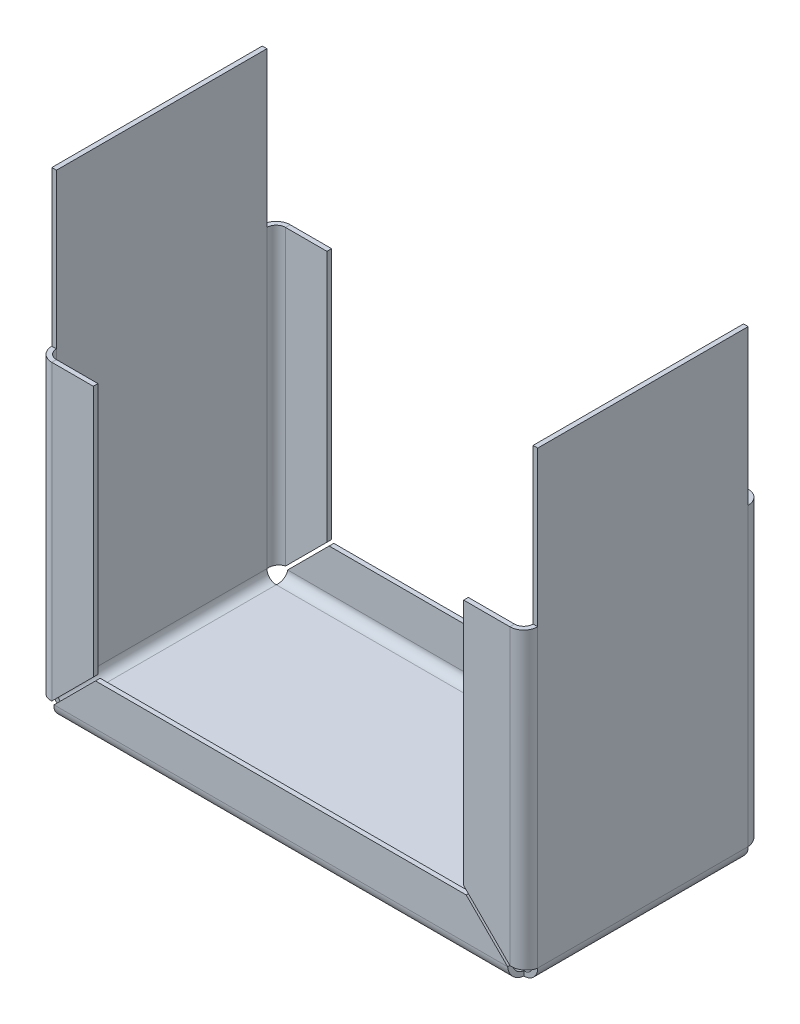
ISO-10303-21;
HEADER;
FILE_DESCRIPTION(('STEP AP214'),'2;1');
FILE_NAME('part.step','',(''),(''),'','','');
FILE_SCHEMA(('AUTOMOTIVE_DESIGN { 1 0 10303 214 1 1 1 1 }'));
ENDSEC;
DATA;
#1=APPLICATION_CONTEXT('core data for automotive mechanical design processes');
#2=APPLICATION_PROTOCOL_DEFINITION('international standard','automotive_design',2000,#1);
#3=PRODUCT_CONTEXT('',#1,'mechanical');
#4=PRODUCT('Part','Part','',(#3));
#5=PRODUCT_RELATED_PRODUCT_CATEGORY('part','',(#4));
#6=PRODUCT_DEFINITION_FORMATION('','',#4);
#7=PRODUCT_DEFINITION_CONTEXT('part definition',#1,'design');
#8=PRODUCT_DEFINITION('design','',#6,#7);
#9=PRODUCT_DEFINITION_SHAPE('','',#8);
#10=(LENGTH_UNIT() NAMED_UNIT(*) SI_UNIT(.MILLI.,.METRE.));
#11=(NAMED_UNIT(*) PLANE_ANGLE_UNIT() SI_UNIT($,.RADIAN.));
#12=(NAMED_UNIT(*) SI_UNIT($,.STERADIAN.) SOLID_ANGLE_UNIT());
#13=UNCERTAINTY_MEASURE_WITH_UNIT(LENGTH_MEASURE(1.E-05),#10,'distance_accuracy_value','');
#14=(GEOMETRIC_REPRESENTATION_CONTEXT(3) GLOBAL_UNCERTAINTY_ASSIGNED_CONTEXT((#13)) GLOBAL_UNIT_ASSIGNED_CONTEXT((#10,
#11,#12)) REPRESENTATION_CONTEXT('',''));
#15=CARTESIAN_POINT('',(0.,0.,0.));
#16=DIRECTION('',(0.,0.,1.));
#17=DIRECTION('',(1.,0.,0.));
#18=AXIS2_PLACEMENT_3D('',#15,#16,#17);
#19=CARTESIAN_POINT('',(78.5000000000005,148.5,-34.));
#20=DIRECTION('',(0.,0.,1.));
#21=DIRECTION('',(0.,-1.,0.));
#22=AXIS2_PLACEMENT_3D('',#19,#20,#21);
#23=PLANE('',#22);
#24=DIRECTION('',(1.,0.,0.));
#25=VECTOR('',#24,1.);
#26=CARTESIAN_POINT('',(77.0000000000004,98.5,-34.));
#27=LINE('',#26,#25);
#28=CARTESIAN_POINT('',(77.0000000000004,98.5,-34.));
#29=VERTEX_POINT('',#28);
#30=CARTESIAN_POINT('',(78.5000000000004,98.5,-34.));
#31=VERTEX_POINT('',#30);
#32=EDGE_CURVE('E186',#29,#31,#27,.T.);
#33=ORIENTED_EDGE('',*,*,#32,.F.);
#34=DIRECTION('',(0.,1.,0.));
#35=VECTOR('',#34,1.);
#36=CARTESIAN_POINT('',(77.0000000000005,148.5,-34.));
#37=LINE('',#36,#35);
#38=CARTESIAN_POINT('',(77.0000000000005,148.5,-34.));
#39=VERTEX_POINT('',#38);
#40=EDGE_CURVE('E692',#29,#39,#37,.T.);
#41=ORIENTED_EDGE('',*,*,#40,.T.);
#42=DIRECTION('',(-1.,0.,0.));
#43=VECTOR('',#42,1.);
#44=CARTESIAN_POINT('',(78.5000000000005,148.5,-34.));
#45=LINE('',#44,#43);
#46=CARTESIAN_POINT('',(78.5000000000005,148.5,-34.));
#47=VERTEX_POINT('',#46);
#48=EDGE_CURVE('E1118',#47,#39,#45,.T.);
#49=ORIENTED_EDGE('',*,*,#48,.F.);
#50=DIRECTION('',(0.,1.,0.));
#51=VECTOR('',#50,1.);
#52=CARTESIAN_POINT('',(78.5000000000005,148.5,-34.));
#53=LINE('',#52,#51);
#54=EDGE_CURVE('E1107',#31,#47,#53,.T.);
#55=ORIENTED_EDGE('',*,*,#54,.F.);
#56=EDGE_LOOP('',(#33,#41,#49,#55));
#57=FACE_BOUND('',#56,.T.);
#58=ADVANCED_FACE('F161',(#57),#23,.F.);
#59=CARTESIAN_POINT('',(-78.5000000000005,148.5,34.));
#60=DIRECTION('',(0.,0.,-1.));
#61=DIRECTION('',(0.,1.,0.));
#62=AXIS2_PLACEMENT_3D('',#59,#60,#61);
#63=PLANE('',#62);
#64=DIRECTION('',(-1.,0.,0.));
#65=VECTOR('',#64,1.);
#66=CARTESIAN_POINT('',(-77.0000000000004,98.5,34.));
#67=LINE('',#66,#65);
#68=CARTESIAN_POINT('',(-77.0000000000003,98.5,34.));
#69=VERTEX_POINT('',#68);
#70=CARTESIAN_POINT('',(-78.5000000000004,98.5,34.));
#71=VERTEX_POINT('',#70);
#72=EDGE_CURVE('E926',#69,#71,#67,.T.);
#73=ORIENTED_EDGE('',*,*,#72,.F.);
#74=DIRECTION('',(0.,1.,0.));
#75=VECTOR('',#74,1.);
#76=CARTESIAN_POINT('',(-77.0000000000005,148.5,34.));
#77=LINE('',#76,#75);
#78=CARTESIAN_POINT('',(-77.0000000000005,148.5,34.));
#79=VERTEX_POINT('',#78);
#80=EDGE_CURVE('E1332',#69,#79,#77,.T.);
#81=ORIENTED_EDGE('',*,*,#80,.T.);
#82=DIRECTION('',(1.,0.,0.));
#83=VECTOR('',#82,1.);
#84=CARTESIAN_POINT('',(-78.5000000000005,148.5,34.));
#85=LINE('',#84,#83);
#86=CARTESIAN_POINT('',(-78.5000000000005,148.5,34.));
#87=VERTEX_POINT('',#86);
#88=EDGE_CURVE('E1093',#87,#79,#85,.T.);
#89=ORIENTED_EDGE('',*,*,#88,.F.);
#90=DIRECTION('',(0.,1.,0.));
#91=VECTOR('',#90,1.);
#92=CARTESIAN_POINT('',(-78.5000000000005,148.5,34.));
#93=LINE('',#92,#91);
#94=EDGE_CURVE('E1168',#71,#87,#93,.T.);
#95=ORIENTED_EDGE('',*,*,#94,.F.);
#96=EDGE_LOOP('',(#73,#81,#89,#95));
#97=FACE_BOUND('',#96,.T.);
#98=ADVANCED_FACE('F513',(#97),#63,.F.);
#99=CARTESIAN_POINT('',(0.,-1.5,0.));
#100=DIRECTION('',(0.,-1.,0.));
#101=DIRECTION('',(0.,0.,-1.));
#102=AXIS2_PLACEMENT_3D('',#99,#100,#101);
#103=PLANE('',#102);
#104=DIRECTION('',(1.,0.,0.));
#105=VECTOR('',#104,1.);
#106=CARTESIAN_POINT('',(-77.,-1.5,34.));
#107=LINE('',#106,#105);
#108=CARTESIAN_POINT('',(-74.,-1.50000000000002,34.));
#109=VERTEX_POINT('',#108);
#110=CARTESIAN_POINT('',(74.,-1.50000000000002,34.));
#111=VERTEX_POINT('',#110);
#112=EDGE_CURVE('E13',#109,#111,#107,.T.);
#113=ORIENTED_EDGE('',*,*,#112,.F.);
#114=DIRECTION('',(0.,0.,1.));
#115=VECTOR('',#114,1.);
#116=CARTESIAN_POINT('',(-74.,-1.50000000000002,34.));
#117=LINE('',#116,#115);
#118=CARTESIAN_POINT('',(-74.,-1.50000000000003,-34.));
#119=VERTEX_POINT('',#118);
#120=EDGE_CURVE('E554',#109,#119,#117,.F.);
#121=ORIENTED_EDGE('',*,*,#120,.T.);
#122=DIRECTION('',(-1.,0.,0.));
#123=VECTOR('',#122,1.);
#124=CARTESIAN_POINT('',(-77.,-1.5,-34.));
#125=LINE('',#124,#123);
#126=CARTESIAN_POINT('',(74.,-1.50000000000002,-34.));
#127=VERTEX_POINT('',#126);
#128=EDGE_CURVE('E170',#127,#119,#125,.T.);
#129=ORIENTED_EDGE('',*,*,#128,.F.);
#130=DIRECTION('',(0.,0.,-1.));
#131=VECTOR('',#130,1.);
#132=CARTESIAN_POINT('',(74.,-1.50000000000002,-34.));
#133=LINE('',#132,#131);
#134=EDGE_CURVE('E556',#127,#111,#133,.F.);
#135=ORIENTED_EDGE('',*,*,#134,.T.);
#136=EDGE_LOOP('',(#113,#121,#129,#135));
#137=FACE_BOUND('',#136,.T.);
#138=ADVANCED_FACE('F518',(#137),#103,.T.);
#139=CARTESIAN_POINT('',(0.,0.,0.));
#140=DIRECTION('',(0.,-1.,0.));
#141=DIRECTION('',(0.,0.,-1.));
#142=AXIS2_PLACEMENT_3D('',#139,#140,#141);
#143=PLANE('',#142);
#144=DIRECTION('',(0.,0.,1.));
#145=VECTOR('',#144,1.);
#146=CARTESIAN_POINT('',(-74.,0.,34.));
#147=LINE('',#146,#145);
#148=CARTESIAN_POINT('',(-74.,0.,34.));
#149=VERTEX_POINT('',#148);
#150=CARTESIAN_POINT('',(-74.,0.,-34.));
#151=VERTEX_POINT('',#150);
#152=EDGE_CURVE('E1084',#149,#151,#147,.F.);
#153=ORIENTED_EDGE('',*,*,#152,.F.);
#154=DIRECTION('',(1.,0.,0.));
#155=VECTOR('',#154,1.);
#156=CARTESIAN_POINT('',(-77.,0.,34.));
#157=LINE('',#156,#155);
#158=CARTESIAN_POINT('',(74.,0.,34.));
#159=VERTEX_POINT('',#158);
#160=EDGE_CURVE('E165',#149,#159,#157,.T.);
#161=ORIENTED_EDGE('',*,*,#160,.T.);
#162=DIRECTION('',(0.,0.,-1.));
#163=VECTOR('',#162,1.);
#164=CARTESIAN_POINT('',(74.,0.,-34.));
#165=LINE('',#164,#163);
#166=CARTESIAN_POINT('',(74.,0.,-34.));
#167=VERTEX_POINT('',#166);
#168=EDGE_CURVE('E1082',#167,#159,#165,.F.);
#169=ORIENTED_EDGE('',*,*,#168,.F.);
#170=DIRECTION('',(-1.,0.,0.));
#171=VECTOR('',#170,1.);
#172=CARTESIAN_POINT('',(-77.,0.,-34.));
#173=LINE('',#172,#171);
#174=EDGE_CURVE('E1065',#167,#151,#173,.T.);
#175=ORIENTED_EDGE('',*,*,#174,.T.);
#176=EDGE_LOOP('',(#153,#161,#169,#175));
#177=FACE_BOUND('',#176,.T.);
#178=ADVANCED_FACE('F163',(#177),#143,.F.);
#179=CARTESIAN_POINT('',(74.,3.,34.));
#180=DIRECTION('',(0.,0.,1.));
#181=DIRECTION('',(1.,0.,0.));
#182=AXIS2_PLACEMENT_3D('',#179,#180,#181);
#183=PLANE('',#182);
#184=DIRECTION('',(1.,0.,0.));
#185=VECTOR('',#184,1.);
#186=CARTESIAN_POINT('',(77.,2.99999999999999,34.));
#187=LINE('',#186,#185);
#188=CARTESIAN_POINT('',(77.,2.99999999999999,34.));
#189=VERTEX_POINT('',#188);
#190=CARTESIAN_POINT('',(78.5,2.99999999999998,34.));
#191=VERTEX_POINT('',#190);
#192=EDGE_CURVE('E1097',#189,#191,#187,.T.);
#193=ORIENTED_EDGE('',*,*,#192,.F.);
#194=CARTESIAN_POINT('',(74.,3.,34.));
#195=DIRECTION('',(0.,0.,-1.));
#196=DIRECTION('',(-1.,0.,0.));
#197=AXIS2_PLACEMENT_3D('',#194,#195,#196);
#198=CIRCLE('',#197,3.00000000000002);
#199=EDGE_CURVE('E1125',#159,#189,#198,.F.);
#200=ORIENTED_EDGE('',*,*,#199,.F.);
#201=DIRECTION('',(0.,-1.,0.));
#202=VECTOR('',#201,1.);
#203=CARTESIAN_POINT('',(74.,0.,34.));
#204=LINE('',#203,#202);
#205=EDGE_CURVE('E1061',#159,#111,#204,.T.);
#206=ORIENTED_EDGE('',*,*,#205,.T.);
#207=CARTESIAN_POINT('',(74.,3.,34.));
#208=DIRECTION('',(0.,0.,-1.));
#209=DIRECTION('',(-1.,0.,0.));
#210=AXIS2_PLACEMENT_3D('',#207,#208,#209);
#211=CIRCLE('',#210,4.50000000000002);
#212=EDGE_CURVE('E1070',#111,#191,#211,.F.);
#213=ORIENTED_EDGE('',*,*,#212,.T.);
#214=EDGE_LOOP('',(#193,#200,#206,#213));
#215=FACE_BOUND('',#214,.T.);
#216=ADVANCED_FACE('F539',(#215),#183,.T.);
#217=CARTESIAN_POINT('',(74.,3.,-34.));
#218=DIRECTION('',(0.,0.,1.));
#219=DIRECTION('',(1.,0.,0.));
#220=AXIS2_PLACEMENT_3D('',#217,#218,#219);
#221=PLANE('',#220);
#222=CARTESIAN_POINT('',(74.,3.,-34.));
#223=DIRECTION('',(0.,0.,-1.));
#224=DIRECTION('',(-1.,0.,0.));
#225=AXIS2_PLACEMENT_3D('',#222,#223,#224);
#226=CIRCLE('',#225,3.00000000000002);
#227=CARTESIAN_POINT('',(77.,2.99999999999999,-34.));
#228=VERTEX_POINT('',#227);
#229=EDGE_CURVE('E1073',#228,#167,#226,.T.);
#230=ORIENTED_EDGE('',*,*,#229,.F.);
#231=DIRECTION('',(1.,0.,0.));
#232=VECTOR('',#231,1.);
#233=CARTESIAN_POINT('',(77.,2.99999999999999,-34.));
#234=LINE('',#233,#232);
#235=CARTESIAN_POINT('',(78.5,2.99999999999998,-34.));
#236=VERTEX_POINT('',#235);
#237=EDGE_CURVE('E703',#228,#236,#234,.T.);
#238=ORIENTED_EDGE('',*,*,#237,.T.);
#239=CARTESIAN_POINT('',(74.,3.,-34.));
#240=DIRECTION('',(0.,0.,-1.));
#241=DIRECTION('',(-1.,0.,0.));
#242=AXIS2_PLACEMENT_3D('',#239,#240,#241);
#243=CIRCLE('',#242,4.50000000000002);
#244=EDGE_CURVE('E1122',#236,#127,#243,.T.);
#245=ORIENTED_EDGE('',*,*,#244,.T.);
#246=DIRECTION('',(0.,-1.,0.));
#247=VECTOR('',#246,1.);
#248=CARTESIAN_POINT('',(74.,0.,-34.));
#249=LINE('',#248,#247);
#250=EDGE_CURVE('E1066',#167,#127,#249,.T.);
#251=ORIENTED_EDGE('',*,*,#250,.F.);
#252=EDGE_LOOP('',(#230,#238,#245,#251));
#253=FACE_BOUND('',#252,.T.);
#254=ADVANCED_FACE('F534',(#253),#221,.F.);
#255=CARTESIAN_POINT('',(74.,3.,-34.));
#256=DIRECTION('',(0.,0.,-1.));
#257=DIRECTION('',(1.,0.,0.));
#258=AXIS2_PLACEMENT_3D('',#255,#256,#257);
#259=CYLINDRICAL_SURFACE('',#258,4.50000000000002);
#260=ORIENTED_EDGE('',*,*,#134,.F.);
#261=ORIENTED_EDGE('',*,*,#244,.F.);
#262=DIRECTION('',(0.,0.,1.));
#263=VECTOR('',#262,1.);
#264=CARTESIAN_POINT('',(78.5,2.99999999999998,0.));
#265=LINE('',#264,#263);
#266=EDGE_CURVE('E712',#236,#191,#265,.T.);
#267=ORIENTED_EDGE('',*,*,#266,.T.);
#268=ORIENTED_EDGE('',*,*,#212,.F.);
#269=EDGE_LOOP('',(#260,#261,#267,#268));
#270=FACE_BOUND('',#269,.T.);
#271=ADVANCED_FACE('F531',(#270),#259,.T.);
#272=CARTESIAN_POINT('',(74.,3.,-34.));
#273=DIRECTION('',(0.,0.,-1.));
#274=DIRECTION('',(1.,0.,0.));
#275=AXIS2_PLACEMENT_3D('',#272,#273,#274);
#276=CYLINDRICAL_SURFACE('',#275,3.00000000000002);
#277=ORIENTED_EDGE('',*,*,#168,.T.);
#278=ORIENTED_EDGE('',*,*,#199,.T.);
#279=DIRECTION('',(0.,0.,-1.));
#280=VECTOR('',#279,1.);
#281=CARTESIAN_POINT('',(77.,2.99999999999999,34.));
#282=LINE('',#281,#280);
#283=EDGE_CURVE('E690',#189,#228,#282,.T.);
#284=ORIENTED_EDGE('',*,*,#283,.T.);
#285=ORIENTED_EDGE('',*,*,#229,.T.);
#286=EDGE_LOOP('',(#277,#278,#284,#285));
#287=FACE_BOUND('',#286,.T.);
#288=ADVANCED_FACE('F529',(#287),#276,.F.);
#289=CARTESIAN_POINT('',(78.5,0.,34.));
#290=DIRECTION('',(0.,0.,-1.));
#291=DIRECTION('',(-1.,0.,0.));
#292=AXIS2_PLACEMENT_3D('',#289,#290,#291);
#293=PLANE('',#292);
#294=DIRECTION('',(0.,-1.,0.));
#295=VECTOR('',#294,1.);
#296=CARTESIAN_POINT('',(77.,0.,34.));
#297=LINE('',#296,#295);
#298=CARTESIAN_POINT('',(77.0000000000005,148.5,34.));
#299=VERTEX_POINT('',#298);
#300=CARTESIAN_POINT('',(77.0000000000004,98.5,34.));
#301=VERTEX_POINT('',#300);
#302=EDGE_CURVE('E1103',#299,#301,#297,.T.);
#303=ORIENTED_EDGE('',*,*,#302,.T.);
#304=DIRECTION('',(1.,0.,0.));
#305=VECTOR('',#304,1.);
#306=CARTESIAN_POINT('',(77.0000000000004,98.5,34.));
#307=LINE('',#306,#305);
#308=CARTESIAN_POINT('',(78.5000000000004,98.5,34.));
#309=VERTEX_POINT('',#308);
#310=EDGE_CURVE('E985',#301,#309,#307,.T.);
#311=ORIENTED_EDGE('',*,*,#310,.T.);
#312=DIRECTION('',(0.,-1.,0.));
#313=VECTOR('',#312,1.);
#314=CARTESIAN_POINT('',(78.5,0.,34.));
#315=LINE('',#314,#313);
#316=CARTESIAN_POINT('',(78.5000000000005,148.5,34.));
#317=VERTEX_POINT('',#316);
#318=EDGE_CURVE('E1104',#317,#309,#315,.T.);
#319=ORIENTED_EDGE('',*,*,#318,.F.);
#320=DIRECTION('',(-1.,0.,0.));
#321=VECTOR('',#320,1.);
#322=CARTESIAN_POINT('',(78.5000000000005,148.5,34.));
#323=LINE('',#322,#321);
#324=EDGE_CURVE('E1112',#317,#299,#323,.T.);
#325=ORIENTED_EDGE('',*,*,#324,.T.);
#326=EDGE_LOOP('',(#303,#311,#319,#325));
#327=FACE_BOUND('',#326,.T.);
#328=ADVANCED_FACE('F525',(#327),#293,.F.);
#329=CARTESIAN_POINT('',(78.5,-2.7148515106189E-13,0.));
#330=DIRECTION('',(-1.,0.,0.));
#331=DIRECTION('',(0.,-1.,0.));
#332=AXIS2_PLACEMENT_3D('',#329,#330,#331);
#333=PLANE('',#332);
#334=ORIENTED_EDGE('',*,*,#266,.F.);
#335=EDGE_CURVE('E1108',#236,#31,#53,.T.);
#336=ORIENTED_EDGE('',*,*,#335,.T.);
#337=ORIENTED_EDGE('',*,*,#54,.T.);
#338=DIRECTION('',(0.,0.,1.));
#339=VECTOR('',#338,1.);
#340=CARTESIAN_POINT('',(78.5000000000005,148.5,34.));
#341=LINE('',#340,#339);
#342=EDGE_CURVE('E1110',#47,#317,#341,.T.);
#343=ORIENTED_EDGE('',*,*,#342,.T.);
#344=ORIENTED_EDGE('',*,*,#318,.T.);
#345=DIRECTION('',(0.,1.,0.));
#346=VECTOR('',#345,1.);
#347=CARTESIAN_POINT('',(78.5000000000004,98.5,34.));
#348=LINE('',#347,#346);
#349=EDGE_CURVE('E986',#309,#191,#348,.F.);
#350=ORIENTED_EDGE('',*,*,#349,.T.);
#351=EDGE_LOOP('',(#334,#336,#337,#343,#344,#350));
#352=FACE_BOUND('',#351,.T.);
#353=ADVANCED_FACE('F528',(#352),#333,.F.);
#354=CARTESIAN_POINT('',(77.,-2.66247929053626E-13,0.));
#355=DIRECTION('',(-1.,0.,0.));
#356=DIRECTION('',(0.,-1.,0.));
#357=AXIS2_PLACEMENT_3D('',#354,#355,#356);
#358=PLANE('',#357);
#359=EDGE_CURVE('E687',#228,#29,#37,.T.);
#360=ORIENTED_EDGE('',*,*,#359,.F.);
#361=ORIENTED_EDGE('',*,*,#283,.F.);
#362=DIRECTION('',(0.,1.,0.));
#363=VECTOR('',#362,1.);
#364=CARTESIAN_POINT('',(77.0000000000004,98.5,34.));
#365=LINE('',#364,#363);
#366=EDGE_CURVE('E1253',#301,#189,#365,.F.);
#367=ORIENTED_EDGE('',*,*,#366,.F.);
#368=ORIENTED_EDGE('',*,*,#302,.F.);
#369=DIRECTION('',(0.,0.,1.));
#370=VECTOR('',#369,1.);
#371=CARTESIAN_POINT('',(77.0000000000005,148.5,34.));
#372=LINE('',#371,#370);
#373=EDGE_CURVE('E697',#39,#299,#372,.T.);
#374=ORIENTED_EDGE('',*,*,#373,.F.);
#375=ORIENTED_EDGE('',*,*,#40,.F.);
#376=EDGE_LOOP('',(#360,#361,#367,#368,#374,#375));
#377=FACE_BOUND('',#376,.T.);
#378=ADVANCED_FACE('F676',(#377),#358,.T.);
#379=CARTESIAN_POINT('',(78.5000000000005,148.5,34.));
#380=DIRECTION('',(0.,-1.,0.));
#381=DIRECTION('',(1.,0.,0.));
#382=AXIS2_PLACEMENT_3D('',#379,#380,#381);
#383=PLANE('',#382);
#384=ORIENTED_EDGE('',*,*,#373,.T.);
#385=ORIENTED_EDGE('',*,*,#324,.F.);
#386=ORIENTED_EDGE('',*,*,#342,.F.);
#387=ORIENTED_EDGE('',*,*,#48,.T.);
#388=EDGE_LOOP('',(#384,#385,#386,#387));
#389=FACE_BOUND('',#388,.T.);
#390=ADVANCED_FACE('F523',(#389),#383,.F.);
#391=CARTESIAN_POINT('',(-74.,3.,-34.));
#392=DIRECTION('',(0.,0.,-1.));
#393=DIRECTION('',(-1.,0.,0.));
#394=AXIS2_PLACEMENT_3D('',#391,#392,#393);
#395=PLANE('',#394);
#396=DIRECTION('',(-1.,0.,0.));
#397=VECTOR('',#396,1.);
#398=CARTESIAN_POINT('',(-77.,2.99999999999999,-34.));
#399=LINE('',#398,#397);
#400=CARTESIAN_POINT('',(-77.,2.99999999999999,-34.));
#401=VERTEX_POINT('',#400);
#402=CARTESIAN_POINT('',(-78.5,2.99999999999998,-34.));
#403=VERTEX_POINT('',#402);
#404=EDGE_CURVE('E580',#401,#403,#399,.T.);
#405=ORIENTED_EDGE('',*,*,#404,.F.);
#406=CARTESIAN_POINT('',(-74.,3.,-34.));
#407=DIRECTION('',(0.,0.,1.));
#408=DIRECTION('',(1.,0.,0.));
#409=AXIS2_PLACEMENT_3D('',#406,#407,#408);
#410=CIRCLE('',#409,3.00000000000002);
#411=EDGE_CURVE('E1088',#151,#401,#410,.F.);
#412=ORIENTED_EDGE('',*,*,#411,.F.);
#413=DIRECTION('',(0.,-1.,0.));
#414=VECTOR('',#413,1.);
#415=CARTESIAN_POINT('',(-74.,0.,-34.));
#416=LINE('',#415,#414);
#417=EDGE_CURVE('E574',#151,#119,#416,.T.);
#418=ORIENTED_EDGE('',*,*,#417,.T.);
#419=CARTESIAN_POINT('',(-74.,3.,-34.));
#420=DIRECTION('',(0.,0.,1.));
#421=DIRECTION('',(1.,0.,0.));
#422=AXIS2_PLACEMENT_3D('',#419,#420,#421);
#423=CIRCLE('',#422,4.50000000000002);
#424=EDGE_CURVE('E575',#119,#403,#423,.F.);
#425=ORIENTED_EDGE('',*,*,#424,.T.);
#426=EDGE_LOOP('',(#405,#412,#418,#425));
#427=FACE_BOUND('',#426,.T.);
#428=ADVANCED_FACE('F669',(#427),#395,.T.);
#429=CARTESIAN_POINT('',(-74.,3.,34.));
#430=DIRECTION('',(0.,0.,-1.));
#431=DIRECTION('',(-1.,0.,0.));
#432=AXIS2_PLACEMENT_3D('',#429,#430,#431);
#433=PLANE('',#432);
#434=CARTESIAN_POINT('',(-74.,3.,34.));
#435=DIRECTION('',(0.,0.,1.));
#436=DIRECTION('',(1.,0.,0.));
#437=AXIS2_PLACEMENT_3D('',#434,#435,#436);
#438=CIRCLE('',#437,3.00000000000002);
#439=CARTESIAN_POINT('',(-77.,2.99999999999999,34.));
#440=VERTEX_POINT('',#439);
#441=EDGE_CURVE('E1089',#440,#149,#438,.T.);
#442=ORIENTED_EDGE('',*,*,#441,.F.);
#443=DIRECTION('',(-1.,0.,0.));
#444=VECTOR('',#443,1.);
#445=CARTESIAN_POINT('',(-77.,2.99999999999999,34.));
#446=LINE('',#445,#444);
#447=CARTESIAN_POINT('',(-78.5,2.99999999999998,34.));
#448=VERTEX_POINT('',#447);
#449=EDGE_CURVE('E1154',#440,#448,#446,.T.);
#450=ORIENTED_EDGE('',*,*,#449,.T.);
#451=CARTESIAN_POINT('',(-74.,3.,34.));
#452=DIRECTION('',(0.,0.,1.));
#453=DIRECTION('',(1.,0.,0.));
#454=AXIS2_PLACEMENT_3D('',#451,#452,#453);
#455=CIRCLE('',#454,4.50000000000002);
#456=EDGE_CURVE('E1091',#448,#109,#455,.T.);
#457=ORIENTED_EDGE('',*,*,#456,.T.);
#458=DIRECTION('',(0.,-1.,0.));
#459=VECTOR('',#458,1.);
#460=CARTESIAN_POINT('',(-74.,0.,34.));
#461=LINE('',#460,#459);
#462=EDGE_CURVE('E564',#149,#109,#461,.T.);
#463=ORIENTED_EDGE('',*,*,#462,.F.);
#464=EDGE_LOOP('',(#442,#450,#457,#463));
#465=FACE_BOUND('',#464,.T.);
#466=ADVANCED_FACE('F664',(#465),#433,.F.);
#467=CARTESIAN_POINT('',(-74.,3.,34.));
#468=DIRECTION('',(0.,0.,1.));
#469=DIRECTION('',(-1.,0.,0.));
#470=AXIS2_PLACEMENT_3D('',#467,#468,#469);
#471=CYLINDRICAL_SURFACE('',#470,4.50000000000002);
#472=ORIENTED_EDGE('',*,*,#120,.F.);
#473=ORIENTED_EDGE('',*,*,#456,.F.);
#474=DIRECTION('',(0.,0.,-1.));
#475=VECTOR('',#474,1.);
#476=CARTESIAN_POINT('',(-78.5,2.99999999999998,0.));
#477=LINE('',#476,#475);
#478=EDGE_CURVE('E1148',#448,#403,#477,.T.);
#479=ORIENTED_EDGE('',*,*,#478,.T.);
#480=ORIENTED_EDGE('',*,*,#424,.F.);
#481=EDGE_LOOP('',(#472,#473,#479,#480));
#482=FACE_BOUND('',#481,.T.);
#483=ADVANCED_FACE('F661',(#482),#471,.T.);
#484=CARTESIAN_POINT('',(-74.,3.,34.));
#485=DIRECTION('',(0.,0.,1.));
#486=DIRECTION('',(-1.,0.,0.));
#487=AXIS2_PLACEMENT_3D('',#484,#485,#486);
#488=CYLINDRICAL_SURFACE('',#487,3.00000000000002);
#489=ORIENTED_EDGE('',*,*,#152,.T.);
#490=ORIENTED_EDGE('',*,*,#411,.T.);
#491=DIRECTION('',(0.,0.,1.));
#492=VECTOR('',#491,1.);
#493=CARTESIAN_POINT('',(-77.,2.99999999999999,-34.));
#494=LINE('',#493,#492);
#495=EDGE_CURVE('E583',#401,#440,#494,.T.);
#496=ORIENTED_EDGE('',*,*,#495,.T.);
#497=ORIENTED_EDGE('',*,*,#441,.T.);
#498=EDGE_LOOP('',(#489,#490,#496,#497));
#499=FACE_BOUND('',#498,.T.);
#500=ADVANCED_FACE('F659',(#499),#488,.F.);
#501=CARTESIAN_POINT('',(-78.5,0.,-34.));
#502=DIRECTION('',(0.,0.,1.));
#503=DIRECTION('',(1.,0.,0.));
#504=AXIS2_PLACEMENT_3D('',#501,#502,#503);
#505=PLANE('',#504);
#506=DIRECTION('',(0.,-1.,0.));
#507=VECTOR('',#506,1.);
#508=CARTESIAN_POINT('',(-77.,0.,-34.));
#509=LINE('',#508,#507);
#510=CARTESIAN_POINT('',(-77.0000000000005,148.5,-34.));
#511=VERTEX_POINT('',#510);
#512=CARTESIAN_POINT('',(-77.0000000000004,98.5,-34.));
#513=VERTEX_POINT('',#512);
#514=EDGE_CURVE('E1162',#511,#513,#509,.T.);
#515=ORIENTED_EDGE('',*,*,#514,.T.);
#516=DIRECTION('',(-1.,0.,0.));
#517=VECTOR('',#516,1.);
#518=CARTESIAN_POINT('',(-77.0000000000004,98.5,-34.));
#519=LINE('',#518,#517);
#520=CARTESIAN_POINT('',(-78.5000000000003,98.5,-34.));
#521=VERTEX_POINT('',#520);
#522=EDGE_CURVE('E472',#513,#521,#519,.T.);
#523=ORIENTED_EDGE('',*,*,#522,.T.);
#524=DIRECTION('',(0.,-1.,0.));
#525=VECTOR('',#524,1.);
#526=CARTESIAN_POINT('',(-78.5,0.,-34.));
#527=LINE('',#526,#525);
#528=CARTESIAN_POINT('',(-78.5000000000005,148.5,-34.));
#529=VERTEX_POINT('',#528);
#530=EDGE_CURVE('E1339',#529,#521,#527,.T.);
#531=ORIENTED_EDGE('',*,*,#530,.F.);
#532=DIRECTION('',(1.,0.,0.));
#533=VECTOR('',#532,1.);
#534=CARTESIAN_POINT('',(-78.5000000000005,148.5,-34.));
#535=LINE('',#534,#533);
#536=EDGE_CURVE('E1331',#529,#511,#535,.T.);
#537=ORIENTED_EDGE('',*,*,#536,.T.);
#538=EDGE_LOOP('',(#515,#523,#531,#537));
#539=FACE_BOUND('',#538,.T.);
#540=ADVANCED_FACE('F648',(#539),#505,.F.);
#541=CARTESIAN_POINT('',(-78.5,-2.7148515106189E-13,0.));
#542=DIRECTION('',(1.,0.,0.));
#543=DIRECTION('',(0.,1.,0.));
#544=AXIS2_PLACEMENT_3D('',#541,#542,#543);
#545=PLANE('',#544);
#546=ORIENTED_EDGE('',*,*,#478,.F.);
#547=EDGE_CURVE('E1159',#448,#71,#93,.T.);
#548=ORIENTED_EDGE('',*,*,#547,.T.);
#549=ORIENTED_EDGE('',*,*,#94,.T.);
#550=DIRECTION('',(0.,0.,-1.));
#551=VECTOR('',#550,1.);
#552=CARTESIAN_POINT('',(-78.5000000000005,148.5,-34.));
#553=LINE('',#552,#551);
#554=EDGE_CURVE('E1167',#87,#529,#553,.T.);
#555=ORIENTED_EDGE('',*,*,#554,.T.);
#556=ORIENTED_EDGE('',*,*,#530,.T.);
#557=DIRECTION('',(0.,1.,0.));
#558=VECTOR('',#557,1.);
#559=CARTESIAN_POINT('',(-78.5000000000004,98.5,-34.));
#560=LINE('',#559,#558);
#561=EDGE_CURVE('E462',#521,#403,#560,.F.);
#562=ORIENTED_EDGE('',*,*,#561,.T.);
#563=EDGE_LOOP('',(#546,#548,#549,#555,#556,#562));
#564=FACE_BOUND('',#563,.T.);
#565=ADVANCED_FACE('F638',(#564),#545,.F.);
#566=CARTESIAN_POINT('',(-77.,-2.66247929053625E-13,0.));
#567=DIRECTION('',(1.,0.,0.));
#568=DIRECTION('',(0.,1.,0.));
#569=AXIS2_PLACEMENT_3D('',#566,#567,#568);
#570=PLANE('',#569);
#571=EDGE_CURVE('E1209',#440,#69,#77,.T.);
#572=ORIENTED_EDGE('',*,*,#571,.F.);
#573=ORIENTED_EDGE('',*,*,#495,.F.);
#574=DIRECTION('',(0.,1.,0.));
#575=VECTOR('',#574,1.);
#576=CARTESIAN_POINT('',(-77.0000000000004,98.5,-34.));
#577=LINE('',#576,#575);
#578=EDGE_CURVE('E467',#513,#401,#577,.F.);
#579=ORIENTED_EDGE('',*,*,#578,.F.);
#580=ORIENTED_EDGE('',*,*,#514,.F.);
#581=DIRECTION('',(0.,0.,-1.));
#582=VECTOR('',#581,1.);
#583=CARTESIAN_POINT('',(-77.0000000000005,148.5,-34.));
#584=LINE('',#583,#582);
#585=EDGE_CURVE('E1337',#79,#511,#584,.T.);
#586=ORIENTED_EDGE('',*,*,#585,.F.);
#587=ORIENTED_EDGE('',*,*,#80,.F.);
#588=EDGE_LOOP('',(#572,#573,#579,#580,#586,#587));
#589=FACE_BOUND('',#588,.T.);
#590=ADVANCED_FACE('F647',(#589),#570,.T.);
#591=CARTESIAN_POINT('',(-78.5000000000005,148.5,-34.));
#592=DIRECTION('',(0.,-1.,0.));
#593=DIRECTION('',(1.,0.,0.));
#594=AXIS2_PLACEMENT_3D('',#591,#592,#593);
#595=PLANE('',#594);
#596=ORIENTED_EDGE('',*,*,#585,.T.);
#597=ORIENTED_EDGE('',*,*,#536,.F.);
#598=ORIENTED_EDGE('',*,*,#554,.F.);
#599=ORIENTED_EDGE('',*,*,#88,.T.);
#600=EDGE_LOOP('',(#596,#597,#598,#599));
#601=FACE_BOUND('',#600,.T.);
#602=ADVANCED_FACE('F652',(#601),#595,.F.);
#603=CARTESIAN_POINT('',(-74.,-1.51500000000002,34.));
#604=CARTESIAN_POINT('',(-73.9410639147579,-1.51500000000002,34.591117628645));
#605=CARTESIAN_POINT('',(-73.8821488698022,-1.39748663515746,35.1817916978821));
#606=CARTESIAN_POINT('',(-73.7642977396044,-0.945145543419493,36.2738396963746));
#607=CARTESIAN_POINT('',(-73.7053721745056,-0.610495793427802,36.7746784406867));
#608=CARTESIAN_POINT('',(-73.5875210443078,0.225321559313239,37.6104957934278));
#609=CARTESIAN_POINT('',(-73.5285954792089,0.726160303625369,37.9451455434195));
#610=CARTESIAN_POINT('',(-73.4107443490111,1.81820830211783,38.3974866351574));
#611=CARTESIAN_POINT('',(-73.3518293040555,2.40888237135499,38.515));
#612=CARTESIAN_POINT('',(-73.2928932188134,2.99999999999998,38.515));
#613=CARTESIAN_POINT('',(-74.,-1.50000000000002,34.));
#614=CARTESIAN_POINT('',(-73.9410639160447,-1.50000000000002,34.5891537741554));
#615=CARTESIAN_POINT('',(-73.8821488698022,-1.38287704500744,35.1778654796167));
#616=CARTESIAN_POINT('',(-73.7642977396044,-0.932038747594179,36.266285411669));
#617=CARTESIAN_POINT('',(-73.7053721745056,-0.59850079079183,36.7654602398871));
#618=CARTESIAN_POINT('',(-73.5875210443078,0.234539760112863,37.5985007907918));
#619=CARTESIAN_POINT('',(-73.5285954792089,0.733714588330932,37.9320387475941));
#620=CARTESIAN_POINT('',(-73.4107443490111,1.82213452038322,38.3828770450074));
#621=CARTESIAN_POINT('',(-73.3518293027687,2.41084622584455,38.5));
#622=CARTESIAN_POINT('',(-73.2928932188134,2.99999999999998,38.5));
#623=CARTESIAN_POINT('',(-74.,0.,34.));
#624=CARTESIAN_POINT('',(-73.9410640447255,0.,34.3927683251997));
#625=CARTESIAN_POINT('',(-73.8821488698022,0.0780819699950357,34.7852436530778));
#626=CARTESIAN_POINT('',(-73.7642977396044,0.378640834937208,35.5108569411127));
#627=CARTESIAN_POINT('',(-73.7053721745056,0.600999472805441,35.8436401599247));
#628=CARTESIAN_POINT('',(-73.5875210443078,1.15635984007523,36.3990005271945));
#629=CARTESIAN_POINT('',(-73.5285954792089,1.48914305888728,36.6213591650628));
#630=CARTESIAN_POINT('',(-73.4107443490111,2.21475634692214,36.9219180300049));
#631=CARTESIAN_POINT('',(-73.3518291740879,2.60723167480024,37.));
#632=CARTESIAN_POINT('',(-73.2928932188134,2.99999999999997,37.));
#633=CARTESIAN_POINT('',(-74.,0.0151499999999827,34.));
#634=CARTESIAN_POINT('',(-73.9410640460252,0.0151499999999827,34.3907848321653));
#635=CARTESIAN_POINT('',(-73.8821488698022,0.0928376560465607,34.7812781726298));
#636=CARTESIAN_POINT('',(-73.7642977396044,0.391878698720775,35.5032271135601));
#637=CARTESIAN_POINT('',(-73.7053721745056,0.613114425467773,35.8343297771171));
#638=CARTESIAN_POINT('',(-73.5875210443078,1.16567022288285,36.3868855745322));
#639=CARTESIAN_POINT('',(-73.5285954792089,1.4967728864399,36.6081213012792));
#640=CARTESIAN_POINT('',(-73.4107443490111,2.21872182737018,36.9071623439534));
#641=CARTESIAN_POINT('',(-73.3518291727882,2.60921516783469,36.98485));
#642=CARTESIAN_POINT('',(-73.2928932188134,2.99999999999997,36.98485));
#643=B_SPLINE_SURFACE_WITH_KNOTS('',1,3,((#603,#604,#605,#606,#607,#608,#609,#610,#611,#612),
(#613,#614,#615,#616,#617,#618,#619,#620,#621,#622),(#623,#624,#625,#626,#627,#628,#629,#630,
#631,#632),(#633,#634,#635,#636,#637,#638,#639,#640,#641,#642)),.UNSPECIFIED.,.F.,.F.,.F.,(2,1,
1,2),(4,2,2,2,4),(-0.01,0.,1.,1.0101),(0.,0.25,0.5,0.75,1.),.UNSPECIFIED.);
#644=DIRECTION('',(0.,0.,-1.));
#645=VECTOR('',#644,1.);
#646=CARTESIAN_POINT('',(-73.2928932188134,2.99999999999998,37.));
#647=LINE('',#646,#645);
#648=CARTESIAN_POINT('',(-73.2928932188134,2.99999999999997,38.5));
#649=VERTEX_POINT('',#648);
#650=CARTESIAN_POINT('',(-73.2928932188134,2.99999999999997,37.));
#651=VERTEX_POINT('',#650);
#652=EDGE_CURVE('E1056',#649,#651,#647,.T.);
#653=CARTESIAN_POINT('',(-74.,0.,34.));
#654=CARTESIAN_POINT('',(-73.9871957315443,-8.4712008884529E-06,34.0853281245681));
#655=CARTESIAN_POINT('',(-73.9743921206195,0.00364040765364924,34.1706523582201));
#656=CARTESIAN_POINT('',(-73.9487860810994,0.0181874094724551,34.3406766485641));
#657=CARTESIAN_POINT('',(-73.9359836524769,0.0290851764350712,34.4253767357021));
#658=CARTESIAN_POINT('',(-73.91038836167,0.0580534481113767,34.5934806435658));
#659=CARTESIAN_POINT('',(-73.8975954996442,0.0761184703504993,34.6768854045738));
#660=CARTESIAN_POINT('',(-73.8720123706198,0.119271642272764,34.8418324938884));
#661=CARTESIAN_POINT('',(-73.8592221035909,0.144359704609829,34.9233748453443));
#662=CARTESIAN_POINT('',(-73.8208402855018,0.229952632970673,35.1644089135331));
#663=CARTESIAN_POINT('',(-73.7952285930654,0.300796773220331,35.3203684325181));
#664=CARTESIAN_POINT('',(-73.7440275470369,0.467884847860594,35.6178807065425));
#665=CARTESIAN_POINT('',(-73.7184381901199,0.564123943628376,35.7594361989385));
#666=CARTESIAN_POINT('',(-73.6672524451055,0.77923879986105,36.0241770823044));
#667=CARTESIAN_POINT('',(-73.641656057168,0.898114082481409,36.1473628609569));
#668=CARTESIAN_POINT('',(-73.5904610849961,1.15508206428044,36.3717896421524));
#669=CARTESIAN_POINT('',(-73.5648625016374,1.29317923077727,36.4730255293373));
#670=CARTESIAN_POINT('',(-73.5136593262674,1.58457332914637,36.6506031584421));
#671=CARTESIAN_POINT('',(-73.4880547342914,1.7378739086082,36.7269389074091));
#672=CARTESIAN_POINT('',(-73.436854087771,2.05516765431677,36.8524279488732));
#673=CARTESIAN_POINT('',(-73.4112580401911,2.21915310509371,36.9016006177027));
#674=CARTESIAN_POINT('',(-73.3702009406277,2.48698222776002,36.9576147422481));
#675=CARTESIAN_POINT('',(-73.3547269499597,2.58901836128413,36.9735037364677));
#676=CARTESIAN_POINT('',(-73.3238024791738,2.79402155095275,36.9946919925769));
#677=CARTESIAN_POINT('',(-73.3083520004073,2.89698688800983,37.0000078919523));
#678=CARTESIAN_POINT('',(-73.2928932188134,2.99999999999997,37.));
#679=B_SPLINE_CURVE_WITH_KNOTS('',3,(#653,#654,#655,#656,#657,#658,#659,#660,#661,#662,#663,
#664,#665,#666,#667,#668,#669,#670,#671,#672,#673,#674,#675,#676,#677,#678),.UNSPECIFIED.,.F.,
.F.,(4,2,2,2,2,2,2,2,2,2,2,2,4),(0.,0.258766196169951,0.517519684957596,0.776075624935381,
1.03462834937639,1.55154905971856,2.06837134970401,2.58518273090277,3.10211442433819,
3.61917044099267,4.13585714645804,4.44861865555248,4.76088762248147),.UNSPECIFIED.);
#680=EDGE_CURVE('E569',#149,#651,#679,.T.);
#681=CARTESIAN_POINT('',(-74.,-1.50000000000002,34.));
#682=CARTESIAN_POINT('',(-73.9872750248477,-1.5000138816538,34.1272000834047));
#683=CARTESIAN_POINT('',(-73.974550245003,-1.49460729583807,34.2543981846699));
#684=CARTESIAN_POINT('',(-73.9491018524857,-1.47305344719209,34.5078752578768));
#685=CARTESIAN_POINT('',(-73.9363782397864,-1.45690670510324,34.6341542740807));
#686=CARTESIAN_POINT('',(-73.910941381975,-1.41398907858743,34.8847953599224));
#687=CARTESIAN_POINT('',(-73.8982281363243,-1.38722626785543,35.0091588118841));
#688=CARTESIAN_POINT('',(-73.8728006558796,-1.32327318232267,35.255173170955));
#689=CARTESIAN_POINT('',(-73.8600864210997,-1.28608303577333,35.376824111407));
#690=CARTESIAN_POINT('',(-73.834653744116,-1.20152671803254,35.6165820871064));
#691=CARTESIAN_POINT('',(-73.8219353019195,-1.15415716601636,35.7346879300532));
#692=CARTESIAN_POINT('',(-73.7964934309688,-1.049570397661,35.9665083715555));
#693=CARTESIAN_POINT('',(-73.7837700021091,-0.992349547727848,36.0802213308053));
#694=CARTESIAN_POINT('',(-73.7583313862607,-0.868517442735,36.3023315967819));
#695=CARTESIAN_POINT('',(-73.745616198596,-0.801911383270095,36.410731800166));
#696=CARTESIAN_POINT('',(-73.7201810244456,-0.659736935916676,36.621544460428));
#697=CARTESIAN_POINT('',(-73.707461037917,-0.584165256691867,36.7239546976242));
#698=CARTESIAN_POINT('',(-73.6820248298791,-0.424652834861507,36.9219702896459));
#699=CARTESIAN_POINT('',(-73.6693086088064,-0.340715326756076,37.0175782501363));
#700=CARTESIAN_POINT('',(-73.6438716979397,-0.165016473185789,37.2013809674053));
#701=CARTESIAN_POINT('',(-73.6311510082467,-0.0732522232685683,37.2895729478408));
#702=CARTESIAN_POINT('',(-73.6057116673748,0.117399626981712,37.4578576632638));
#703=CARTESIAN_POINT('',(-73.5929930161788,0.216286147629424,37.5379516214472));
#704=CARTESIAN_POINT('',(-73.5675522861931,0.420521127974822,37.68950739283));
#705=CARTESIAN_POINT('',(-73.5548302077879,0.525871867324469,37.760966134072));
#706=CARTESIAN_POINT('',(-73.5293847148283,0.742250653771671,37.8947072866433));
#707=CARTESIAN_POINT('',(-73.5166613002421,0.853278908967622,37.9569893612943));
#708=CARTESIAN_POINT('',(-73.4912140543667,1.08021103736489,38.0719268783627));
#709=CARTESIAN_POINT('',(-73.4784902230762,1.19611492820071,38.124582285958));
#710=CARTESIAN_POINT('',(-73.4530489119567,1.43190569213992,38.21986227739));
#711=CARTESIAN_POINT('',(-73.4403314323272,1.55179042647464,38.2624921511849));
#712=CARTESIAN_POINT('',(-73.4149012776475,1.79470093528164,38.3374434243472));
#713=CARTESIAN_POINT('',(-73.4021886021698,1.91772596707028,38.3697672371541));
#714=CARTESIAN_POINT('',(-73.3733677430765,2.19923932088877,38.4311029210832));
#715=CARTESIAN_POINT('',(-73.3572586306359,2.35843137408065,38.4569298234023));
#716=CARTESIAN_POINT('',(-73.3250635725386,2.67842355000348,38.4913857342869));
#717=CARTESIAN_POINT('',(-73.3089776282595,2.83922091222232,38.5000404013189));
#718=CARTESIAN_POINT('',(-73.2928932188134,2.99999999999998,38.5));
#719=B_SPLINE_CURVE_WITH_KNOTS('',3,(#681,#682,#683,#684,#685,#686,#687,#688,#689,#690,#691,
#692,#693,#694,#695,#696,#697,#698,#699,#700,#701,#702,#703,#704,#705,#706,#707,#708,#709,#710,
#711,#712,#713,#714,#715,#716,#717,#718),.UNSPECIFIED.,.F.,.F.,(4,2,2,2,2,2,2,2,2,2,2,2,2,2,2,2,
2,2,4),(0.,0.383387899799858,0.766757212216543,1.14983552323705,1.53290912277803,
1.91611014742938,2.29945281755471,2.6825840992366,3.06585646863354,3.44898122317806,
3.83224877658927,4.21545835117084,4.5988038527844,4.98216341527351,5.36552436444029,
5.74868257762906,6.1317509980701,6.61703066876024,7.10158469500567),.UNSPECIFIED.);
#720=EDGE_CURVE('E566',#109,#649,#719,.T.);
#721=ORIENTED_EDGE('',*,*,#652,.T.);
#722=ORIENTED_EDGE('',*,*,#680,.F.);
#723=ORIENTED_EDGE('',*,*,#462,.T.);
#724=ORIENTED_EDGE('',*,*,#720,.T.);
#725=EDGE_LOOP('',(#721,#722,#723,#724));
#726=FACE_BOUND('',#725,.T.);
#727=ADVANCED_FACE('F565',(#726),#643,.F.);
#728=CARTESIAN_POINT('',(73.2928932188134,2.99999999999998,38.515));
#729=CARTESIAN_POINT('',(73.3518293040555,2.40888237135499,38.515));
#730=CARTESIAN_POINT('',(73.4107443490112,1.81820830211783,38.3974866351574));
#731=CARTESIAN_POINT('',(73.5285954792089,0.726160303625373,37.9451455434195));
#732=CARTESIAN_POINT('',(73.5875210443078,0.225321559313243,37.6104957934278));
#733=CARTESIAN_POINT('',(73.7053721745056,-0.6104957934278,36.7746784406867));
#734=CARTESIAN_POINT('',(73.7642977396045,-0.94514554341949,36.2738396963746));
#735=CARTESIAN_POINT('',(73.8821488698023,-1.39748663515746,35.1817916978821));
#736=CARTESIAN_POINT('',(73.9410639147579,-1.51500000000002,34.591117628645));
#737=CARTESIAN_POINT('',(74.,-1.51500000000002,34.));
#738=CARTESIAN_POINT('',(73.2928932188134,2.99999999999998,38.5));
#739=CARTESIAN_POINT('',(73.3518293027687,2.41084622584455,38.5));
#740=CARTESIAN_POINT('',(73.4107443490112,1.82213452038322,38.3828770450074));
#741=CARTESIAN_POINT('',(73.5285954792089,0.733714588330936,37.9320387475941));
#742=CARTESIAN_POINT('',(73.5875210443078,0.234539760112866,37.5985007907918));
#743=CARTESIAN_POINT('',(73.7053721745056,-0.598500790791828,36.7654602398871));
#744=CARTESIAN_POINT('',(73.7642977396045,-0.932038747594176,36.266285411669));
#745=CARTESIAN_POINT('',(73.8821488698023,-1.38287704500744,35.1778654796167));
#746=CARTESIAN_POINT('',(73.9410639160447,-1.50000000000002,34.5891537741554));
#747=CARTESIAN_POINT('',(74.,-1.50000000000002,34.));
#748=CARTESIAN_POINT('',(73.2928932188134,2.99999999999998,37.));
#749=CARTESIAN_POINT('',(73.3518291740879,2.60723167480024,37.));
#750=CARTESIAN_POINT('',(73.4107443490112,2.21475634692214,36.9219180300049));
#751=CARTESIAN_POINT('',(73.5285954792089,1.48914305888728,36.6213591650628));
#752=CARTESIAN_POINT('',(73.5875210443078,1.15635984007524,36.3990005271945));
#753=CARTESIAN_POINT('',(73.7053721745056,0.600999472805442,35.8436401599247));
#754=CARTESIAN_POINT('',(73.7642977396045,0.378640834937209,35.5108569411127));
#755=CARTESIAN_POINT('',(73.8821488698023,0.0780819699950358,34.7852436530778));
#756=CARTESIAN_POINT('',(73.9410640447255,0.,34.3927683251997));
#757=CARTESIAN_POINT('',(74.,0.,34.));
#758=CARTESIAN_POINT('',(73.2928932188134,2.99999999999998,36.98485));
#759=CARTESIAN_POINT('',(73.3518291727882,2.60921516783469,36.98485));
#760=CARTESIAN_POINT('',(73.4107443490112,2.21872182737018,36.9071623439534));
#761=CARTESIAN_POINT('',(73.5285954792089,1.4967728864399,36.6081213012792));
#762=CARTESIAN_POINT('',(73.5875210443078,1.16567022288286,36.3868855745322));
#763=CARTESIAN_POINT('',(73.7053721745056,0.613114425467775,35.8343297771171));
#764=CARTESIAN_POINT('',(73.7642977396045,0.391878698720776,35.5032271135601));
#765=CARTESIAN_POINT('',(73.8821488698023,0.0928376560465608,34.7812781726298));
#766=CARTESIAN_POINT('',(73.9410640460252,0.0151499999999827,34.3907848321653));
#767=CARTESIAN_POINT('',(74.,0.0151499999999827,34.));
#768=B_SPLINE_SURFACE_WITH_KNOTS('',1,3,((#728,#729,#730,#731,#732,#733,#734,#735,#736,#737),
(#738,#739,#740,#741,#742,#743,#744,#745,#746,#747),(#748,#749,#750,#751,#752,#753,#754,#755,
#756,#757),(#758,#759,#760,#761,#762,#763,#764,#765,#766,#767)),.UNSPECIFIED.,.F.,.F.,.F.,(2,1,
1,2),(4,2,2,2,4),(-0.01,0.,1.,1.0101),(0.,0.25,0.5,0.75,1.),.UNSPECIFIED.);
#769=CARTESIAN_POINT('',(73.2928932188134,2.99999999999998,37.));
#770=CARTESIAN_POINT('',(73.3056974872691,2.91467187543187,37.0000084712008));
#771=CARTESIAN_POINT('',(73.3185010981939,2.82934764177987,36.9963595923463));
#772=CARTESIAN_POINT('',(73.344107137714,2.65932335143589,36.9818125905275));
#773=CARTESIAN_POINT('',(73.3569095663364,2.57462326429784,36.9709148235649));
#774=CARTESIAN_POINT('',(73.3825048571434,2.40651935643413,36.9419465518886));
#775=CARTESIAN_POINT('',(73.3952977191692,2.32311459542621,36.9238815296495));
#776=CARTESIAN_POINT('',(73.4208808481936,2.15816750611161,36.8807283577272));
#777=CARTESIAN_POINT('',(73.4336711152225,2.07662515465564,36.8556402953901));
#778=CARTESIAN_POINT('',(73.4720529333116,1.83559108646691,36.7700473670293));
#779=CARTESIAN_POINT('',(73.4976646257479,1.67963156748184,36.6992032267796));
#780=CARTESIAN_POINT('',(73.5488656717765,1.38211929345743,36.5321151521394));
#781=CARTESIAN_POINT('',(73.5744550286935,1.24056380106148,36.4358760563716));
#782=CARTESIAN_POINT('',(73.6256407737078,0.97582291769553,36.2207612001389));
#783=CARTESIAN_POINT('',(73.6512371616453,0.852637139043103,36.1018859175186));
#784=CARTESIAN_POINT('',(73.7024321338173,0.628210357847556,35.8449179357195));
#785=CARTESIAN_POINT('',(73.7280307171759,0.526974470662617,35.7068207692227));
#786=CARTESIAN_POINT('',(73.779233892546,0.349396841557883,35.4154266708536));
#787=CARTESIAN_POINT('',(73.804838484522,0.273061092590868,35.2621260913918));
#788=CARTESIAN_POINT('',(73.8560391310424,0.147572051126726,34.9448323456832));
#789=CARTESIAN_POINT('',(73.8816351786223,0.0983993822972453,34.7808468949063));
#790=CARTESIAN_POINT('',(73.9226922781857,0.0423852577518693,34.51301777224));
#791=CARTESIAN_POINT('',(73.9381662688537,0.0264962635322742,34.4109816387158));
#792=CARTESIAN_POINT('',(73.9690907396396,0.00530800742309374,34.2059784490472));
#793=CARTESIAN_POINT('',(73.9845412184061,-7.89195231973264E-06,34.1030131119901));
#794=CARTESIAN_POINT('',(74.,0.,34.));
#795=B_SPLINE_CURVE_WITH_KNOTS('',3,(#769,#770,#771,#772,#773,#774,#775,#776,#777,#778,#779,
#780,#781,#782,#783,#784,#785,#786,#787,#788,#789,#790,#791,#792,#793,#794),.UNSPECIFIED.,.F.,
.F.,(4,2,2,2,2,2,2,2,2,2,2,2,4),(0.,0.25876619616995,0.517519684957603,0.77607562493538,
1.0346283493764,1.55154905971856,2.068371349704,2.58518273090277,3.10211442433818,
3.61917044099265,4.13585714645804,4.44861865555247,4.76088762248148),.UNSPECIFIED.);
#796=CARTESIAN_POINT('',(73.2928932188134,2.99999999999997,37.));
#797=VERTEX_POINT('',#796);
#798=EDGE_CURVE('E623',#797,#159,#795,.T.);
#799=DIRECTION('',(0.,0.,1.));
#800=VECTOR('',#799,1.);
#801=CARTESIAN_POINT('',(73.2928932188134,2.99999999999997,37.));
#802=LINE('',#801,#800);
#803=CARTESIAN_POINT('',(73.2928932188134,2.99999999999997,38.5));
#804=VERTEX_POINT('',#803);
#805=EDGE_CURVE('E630',#804,#797,#802,.F.);
#806=CARTESIAN_POINT('',(73.2928932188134,2.99999999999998,38.5));
#807=CARTESIAN_POINT('',(73.3056181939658,2.87279991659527,38.5000138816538));
#808=CARTESIAN_POINT('',(73.3183429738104,2.74560181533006,38.494607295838));
#809=CARTESIAN_POINT('',(73.3437913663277,2.49212474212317,38.4730534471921));
#810=CARTESIAN_POINT('',(73.356514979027,2.3658457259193,38.4569067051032));
#811=CARTESIAN_POINT('',(73.3819518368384,2.1152046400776,38.4139890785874));
#812=CARTESIAN_POINT('',(73.3946650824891,1.99084118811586,38.3872262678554));
#813=CARTESIAN_POINT('',(73.4200925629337,1.74482682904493,38.3232731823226));
#814=CARTESIAN_POINT('',(73.4328067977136,1.62317588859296,38.2860830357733));
#815=CARTESIAN_POINT('',(73.4582394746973,1.3834179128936,38.2015267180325));
#816=CARTESIAN_POINT('',(73.4709579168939,1.26531206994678,38.1541571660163));
#817=CARTESIAN_POINT('',(73.4963997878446,1.03349162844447,38.049570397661));
#818=CARTESIAN_POINT('',(73.5091232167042,0.919778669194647,37.9923495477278));
#819=CARTESIAN_POINT('',(73.5345618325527,0.697668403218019,37.868517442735));
#820=CARTESIAN_POINT('',(73.5472770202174,0.589268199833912,37.8019113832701));
#821=CARTESIAN_POINT('',(73.5727121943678,0.378455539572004,37.6597369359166));
#822=CARTESIAN_POINT('',(73.5854321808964,0.276045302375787,37.5841652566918));
#823=CARTESIAN_POINT('',(73.6108683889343,0.078029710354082,37.4246528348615));
#824=CARTESIAN_POINT('',(73.623584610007,-0.0175782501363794,37.340715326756));
#825=CARTESIAN_POINT('',(73.6490215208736,-0.201380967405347,37.1650164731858));
#826=CARTESIAN_POINT('',(73.6617422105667,-0.289572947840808,37.0732522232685));
#827=CARTESIAN_POINT('',(73.6871815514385,-0.457857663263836,36.8826003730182));
#828=CARTESIAN_POINT('',(73.6999002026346,-0.537951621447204,36.7837138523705));
#829=CARTESIAN_POINT('',(73.7253409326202,-0.689507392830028,36.5794788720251));
#830=CARTESIAN_POINT('',(73.7380630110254,-0.76096613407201,36.4741281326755));
#831=CARTESIAN_POINT('',(73.763508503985,-0.894707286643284,36.2577493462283));
#832=CARTESIAN_POINT('',(73.7762319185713,-0.956989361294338,36.1467210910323));
#833=CARTESIAN_POINT('',(73.8016791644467,-1.07192687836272,35.9197889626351));
#834=CARTESIAN_POINT('',(73.8144029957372,-1.12458228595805,35.8038850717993));
#835=CARTESIAN_POINT('',(73.8398443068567,-1.21986227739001,35.56809430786));
#836=CARTESIAN_POINT('',(73.8525617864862,-1.26249215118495,35.4482095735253));
#837=CARTESIAN_POINT('',(73.8779919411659,-1.33744342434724,35.2052990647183));
#838=CARTESIAN_POINT('',(73.8907046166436,-1.36976723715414,35.0822740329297));
#839=CARTESIAN_POINT('',(73.9195254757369,-1.43110292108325,34.8007606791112));
#840=CARTESIAN_POINT('',(73.9356345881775,-1.45692982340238,34.6415686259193));
#841=CARTESIAN_POINT('',(73.9678296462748,-1.49138573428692,34.3215764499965));
#842=CARTESIAN_POINT('',(73.9839155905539,-1.50004040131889,34.1607790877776));
#843=CARTESIAN_POINT('',(74.,-1.50000000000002,34.));
#844=B_SPLINE_CURVE_WITH_KNOTS('',3,(#806,#807,#808,#809,#810,#811,#812,#813,#814,#815,#816,
#817,#818,#819,#820,#821,#822,#823,#824,#825,#826,#827,#828,#829,#830,#831,#832,#833,#834,#835,
#836,#837,#838,#839,#840,#841,#842,#843),.UNSPECIFIED.,.F.,.F.,(4,2,2,2,2,2,2,2,2,2,2,2,2,2,2,2,
2,2,4),(0.,0.38338789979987,0.76675721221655,1.14983552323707,1.53290912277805,1.9161101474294,
2.29945281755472,2.6825840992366,3.06585646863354,3.44898122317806,3.83224877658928,
4.21545835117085,4.5988038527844,4.98216341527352,5.3655243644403,5.74868257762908,
6.13175099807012,6.61703066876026,7.10158469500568),.UNSPECIFIED.);
#845=EDGE_CURVE('E581',#804,#111,#844,.T.);
#846=ORIENTED_EDGE('',*,*,#798,.F.);
#847=ORIENTED_EDGE('',*,*,#805,.F.);
#848=ORIENTED_EDGE('',*,*,#845,.T.);
#849=ORIENTED_EDGE('',*,*,#205,.F.);
#850=EDGE_LOOP('',(#846,#847,#848,#849));
#851=FACE_BOUND('',#850,.T.);
#852=ADVANCED_FACE('F609',(#851),#768,.F.);
#853=CARTESIAN_POINT('',(74.,2.99999999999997,34.));
#854=DIRECTION('',(1.,0.,0.));
#855=DIRECTION('',(0.,0.,1.));
#856=AXIS2_PLACEMENT_3D('',#853,#854,#855);
#857=CYLINDRICAL_SURFACE('',#856,4.49999999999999);
#858=ORIENTED_EDGE('',*,*,#112,.T.);
#859=ORIENTED_EDGE('',*,*,#845,.F.);
#860=DIRECTION('',(1.,0.,0.));
#861=VECTOR('',#860,1.);
#862=CARTESIAN_POINT('',(-74.,2.99999999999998,38.5));
#863=LINE('',#862,#861);
#864=EDGE_CURVE('E579',#804,#649,#863,.F.);
#865=ORIENTED_EDGE('',*,*,#864,.T.);
#866=ORIENTED_EDGE('',*,*,#720,.F.);
#867=EDGE_LOOP('',(#858,#859,#865,#866));
#868=FACE_BOUND('',#867,.T.);
#869=ADVANCED_FACE('F577',(#868),#857,.T.);
#870=CARTESIAN_POINT('',(74.,2.99999999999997,34.));
#871=DIRECTION('',(1.,0.,0.));
#872=DIRECTION('',(0.,0.,1.));
#873=AXIS2_PLACEMENT_3D('',#870,#871,#872);
#874=CYLINDRICAL_SURFACE('',#873,2.99999999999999);
#875=ORIENTED_EDGE('',*,*,#160,.F.);
#876=ORIENTED_EDGE('',*,*,#680,.T.);
#877=DIRECTION('',(1.,0.,0.));
#878=VECTOR('',#877,1.);
#879=CARTESIAN_POINT('',(-74.,2.99999999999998,37.));
#880=LINE('',#879,#878);
#881=EDGE_CURVE('E593',#651,#797,#880,.T.);
#882=ORIENTED_EDGE('',*,*,#881,.T.);
#883=ORIENTED_EDGE('',*,*,#798,.T.);
#884=EDGE_LOOP('',(#875,#876,#882,#883));
#885=FACE_BOUND('',#884,.T.);
#886=ADVANCED_FACE('F608',(#885),#874,.F.);
#887=CARTESIAN_POINT('',(0.,0.,38.5));
#888=DIRECTION('',(0.,0.,-1.));
#889=DIRECTION('',(-1.,0.,0.));
#890=AXIS2_PLACEMENT_3D('',#887,#888,#889);
#891=PLANE('',#890);
#892=DIRECTION('',(0.707106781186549,-0.707106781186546,0.));
#893=VECTOR('',#892,1.);
#894=CARTESIAN_POINT('',(-30.796884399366,107.089777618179,38.5));
#895=LINE('',#894,#893);
#896=CARTESIAN_POINT('',(59.8868936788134,16.40599954,38.5));
#897=VERTEX_POINT('',#896);
#898=EDGE_CURVE('E1050',#897,#804,#895,.T.);
#899=ORIENTED_EDGE('',*,*,#898,.F.);
#900=DIRECTION('',(-1.,0.,0.));
#901=VECTOR('',#900,1.);
#902=CARTESIAN_POINT('',(0.,16.40599954,38.5));
#903=LINE('',#902,#901);
#904=CARTESIAN_POINT('',(-59.8868936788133,16.40599954,38.5));
#905=VERTEX_POINT('',#904);
#906=EDGE_CURVE('E1039',#897,#905,#903,.T.);
#907=ORIENTED_EDGE('',*,*,#906,.T.);
#908=DIRECTION('',(0.707106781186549,0.707106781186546,0.));
#909=VECTOR('',#908,1.);
#910=CARTESIAN_POINT('',(-73.2928932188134,2.99999999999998,38.5));
#911=LINE('',#910,#909);
#912=EDGE_CURVE('E1045',#649,#905,#911,.T.);
#913=ORIENTED_EDGE('',*,*,#912,.F.);
#914=ORIENTED_EDGE('',*,*,#864,.F.);
#915=EDGE_LOOP('',(#899,#907,#913,#914));
#916=FACE_BOUND('',#915,.T.);
#917=ADVANCED_FACE('F615',(#916),#891,.F.);
#918=CARTESIAN_POINT('',(0.,0.,37.));
#919=DIRECTION('',(0.,0.,-1.));
#920=DIRECTION('',(-1.,0.,0.));
#921=AXIS2_PLACEMENT_3D('',#918,#919,#920);
#922=PLANE('',#921);
#923=DIRECTION('',(1.,0.,0.));
#924=VECTOR('',#923,1.);
#925=CARTESIAN_POINT('',(-74.,16.40599954,37.));
#926=LINE('',#925,#924);
#927=CARTESIAN_POINT('',(59.8868936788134,16.40599954,37.));
#928=VERTEX_POINT('',#927);
#929=CARTESIAN_POINT('',(-59.8868936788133,16.40599954,37.));
#930=VERTEX_POINT('',#929);
#931=EDGE_CURVE('E1030',#928,#930,#926,.F.);
#932=ORIENTED_EDGE('',*,*,#931,.F.);
#933=DIRECTION('',(0.707106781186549,-0.707106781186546,0.));
#934=VECTOR('',#933,1.);
#935=CARTESIAN_POINT('',(38.1464466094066,38.1464466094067,37.));
#936=LINE('',#935,#934);
#937=EDGE_CURVE('E1033',#928,#797,#936,.T.);
#938=ORIENTED_EDGE('',*,*,#937,.T.);
#939=ORIENTED_EDGE('',*,*,#881,.F.);
#940=DIRECTION('',(0.707106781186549,0.707106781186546,0.));
#941=VECTOR('',#940,1.);
#942=CARTESIAN_POINT('',(-38.1464466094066,38.1464466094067,37.));
#943=LINE('',#942,#941);
#944=EDGE_CURVE('E1036',#651,#930,#943,.T.);
#945=ORIENTED_EDGE('',*,*,#944,.T.);
#946=EDGE_LOOP('',(#932,#938,#939,#945));
#947=FACE_BOUND('',#946,.T.);
#948=ADVANCED_FACE('F1019',(#947),#922,.T.);
#949=CARTESIAN_POINT('',(-74.,16.40599954,38.5));
#950=DIRECTION('',(0.,-1.,0.));
#951=DIRECTION('',(0.,0.,-1.));
#952=AXIS2_PLACEMENT_3D('',#949,#950,#951);
#953=PLANE('',#952);
#954=DIRECTION('',(0.,0.,1.));
#955=VECTOR('',#954,1.);
#956=CARTESIAN_POINT('',(59.8868936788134,16.40599954,38.5000000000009));
#957=LINE('',#956,#955);
#958=EDGE_CURVE('E1043',#928,#897,#957,.T.);
#959=ORIENTED_EDGE('',*,*,#958,.F.);
#960=ORIENTED_EDGE('',*,*,#931,.T.);
#961=DIRECTION('',(0.,0.,-1.));
#962=VECTOR('',#961,1.);
#963=CARTESIAN_POINT('',(-59.8868936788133,16.40599954,38.4999999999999));
#964=LINE('',#963,#962);
#965=EDGE_CURVE('E1048',#905,#930,#964,.T.);
#966=ORIENTED_EDGE('',*,*,#965,.F.);
#967=ORIENTED_EDGE('',*,*,#906,.F.);
#968=EDGE_LOOP('',(#959,#960,#966,#967));
#969=FACE_BOUND('',#968,.T.);
#970=ADVANCED_FACE('F610',(#969),#953,.F.);
#971=CARTESIAN_POINT('',(-73.2928932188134,2.99999999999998,38.5));
#972=DIRECTION('',(-0.707106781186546,0.707106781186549,0.));
#973=DIRECTION('',(-0.707106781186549,-0.707106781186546,0.));
#974=AXIS2_PLACEMENT_3D('',#971,#972,#973);
#975=PLANE('',#974);
#976=ORIENTED_EDGE('',*,*,#944,.F.);
#977=ORIENTED_EDGE('',*,*,#652,.F.);
#978=ORIENTED_EDGE('',*,*,#912,.T.);
#979=ORIENTED_EDGE('',*,*,#965,.T.);
#980=EDGE_LOOP('',(#976,#977,#978,#979));
#981=FACE_BOUND('',#980,.T.);
#982=ADVANCED_FACE('F1013',(#981),#975,.T.);
#983=CARTESIAN_POINT('',(-30.796884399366,107.089777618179,38.5));
#984=DIRECTION('',(0.707106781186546,0.707106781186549,0.));
#985=DIRECTION('',(-0.707106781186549,0.707106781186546,0.));
#986=AXIS2_PLACEMENT_3D('',#983,#984,#985);
#987=PLANE('',#986);
#988=ORIENTED_EDGE('',*,*,#937,.F.);
#989=ORIENTED_EDGE('',*,*,#958,.T.);
#990=ORIENTED_EDGE('',*,*,#898,.T.);
#991=ORIENTED_EDGE('',*,*,#805,.T.);
#992=EDGE_LOOP('',(#988,#989,#990,#991));
#993=FACE_BOUND('',#992,.T.);
#994=ADVANCED_FACE('F1000',(#993),#987,.T.);
#995=CARTESIAN_POINT('',(78.515,2.99999999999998,34.));
#996=CARTESIAN_POINT('',(78.515,3.05893608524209,34.591117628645));
#997=CARTESIAN_POINT('',(78.3974866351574,3.11785113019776,35.1817916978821));
#998=CARTESIAN_POINT('',(77.9451455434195,3.23570226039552,36.2738396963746));
#999=CARTESIAN_POINT('',(77.6104957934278,3.2946278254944,36.7746784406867));
#1000=CARTESIAN_POINT('',(76.7746784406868,3.41247895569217,37.6104957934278));
#1001=CARTESIAN_POINT('',(76.2738396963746,3.47140452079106,37.9451455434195));
#1002=CARTESIAN_POINT('',(75.1817916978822,3.58925565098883,38.3974866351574));
#1003=CARTESIAN_POINT('',(74.591117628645,3.64817069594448,38.515));
#1004=CARTESIAN_POINT('',(74.0000000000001,3.70710678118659,38.515));
#1005=CARTESIAN_POINT('',(78.5,2.99999999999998,34.));
#1006=CARTESIAN_POINT('',(78.5,3.05893608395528,34.5891537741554));
#1007=CARTESIAN_POINT('',(78.3828770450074,3.11785113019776,35.1778654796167));
#1008=CARTESIAN_POINT('',(77.9320387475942,3.23570226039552,36.266285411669));
#1009=CARTESIAN_POINT('',(77.5985007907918,3.2946278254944,36.7654602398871));
#1010=CARTESIAN_POINT('',(76.7654602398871,3.41247895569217,37.5985007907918));
#1011=CARTESIAN_POINT('',(76.2662854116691,3.47140452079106,37.9320387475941));
#1012=CARTESIAN_POINT('',(75.1778654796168,3.58925565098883,38.3828770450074));
#1013=CARTESIAN_POINT('',(74.5891537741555,3.64817069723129,38.5));
#1014=CARTESIAN_POINT('',(74.0000000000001,3.70710678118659,38.5));
#1015=CARTESIAN_POINT('',(77.,2.99999999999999,34.));
#1016=CARTESIAN_POINT('',(77.,3.0589359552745,34.3927683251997));
#1017=CARTESIAN_POINT('',(76.9219180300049,3.11785113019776,34.7852436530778));
#1018=CARTESIAN_POINT('',(76.6213591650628,3.23570226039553,35.5108569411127));
#1019=CARTESIAN_POINT('',(76.3990005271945,3.29462782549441,35.8436401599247));
#1020=CARTESIAN_POINT('',(75.8436401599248,3.41247895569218,36.3990005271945));
#1021=CARTESIAN_POINT('',(75.5108569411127,3.47140452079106,36.6213591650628));
#1022=CARTESIAN_POINT('',(74.7852436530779,3.58925565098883,36.9219180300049));
#1023=CARTESIAN_POINT('',(74.3927683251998,3.64817082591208,37.));
#1024=CARTESIAN_POINT('',(74.,3.70710678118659,37.));
#1025=CARTESIAN_POINT('',(76.98485,2.99999999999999,34.));
#1026=CARTESIAN_POINT('',(76.98485,3.05893595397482,34.3907848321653));
#1027=CARTESIAN_POINT('',(76.9071623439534,3.11785113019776,34.7812781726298));
#1028=CARTESIAN_POINT('',(76.6081213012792,3.23570226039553,35.5032271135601));
#1029=CARTESIAN_POINT('',(76.3868855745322,3.29462782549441,35.8343297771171));
#1030=CARTESIAN_POINT('',(75.8343297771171,3.41247895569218,36.3868855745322));
#1031=CARTESIAN_POINT('',(75.5032271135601,3.47140452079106,36.6081213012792));
#1032=CARTESIAN_POINT('',(74.7812781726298,3.58925565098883,36.9071623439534));
#1033=CARTESIAN_POINT('',(74.3907848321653,3.64817082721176,36.98485));
#1034=CARTESIAN_POINT('',(74.,3.70710678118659,36.98485));
#1035=B_SPLINE_SURFACE_WITH_KNOTS('',1,3,((#995,#996,#997,#998,#999,#1000,#1001,#1002,#1003,
#1004),(#1005,#1006,#1007,#1008,#1009,#1010,#1011,#1012,#1013,#1014),(#1015,#1016,#1017,#1018,
#1019,#1020,#1021,#1022,#1023,#1024),(#1025,#1026,#1027,#1028,#1029,#1030,#1031,#1032,#1033,
#1034)),.UNSPECIFIED.,.F.,.F.,.F.,(2,1,1,2),(4,2,2,2,4),(-0.01,0.,1.,1.0101),(0.,0.25,0.5,0.75,
1.),.UNSPECIFIED.);
#1036=DIRECTION('',(0.,0.,-1.));
#1037=VECTOR('',#1036,1.);
#1038=CARTESIAN_POINT('',(74.,3.70710678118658,37.));
#1039=LINE('',#1038,#1037);
#1040=CARTESIAN_POINT('',(74.,3.70710678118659,38.5));
#1041=VERTEX_POINT('',#1040);
#1042=CARTESIAN_POINT('',(74.,3.70710678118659,37.));
#1043=VERTEX_POINT('',#1042);
#1044=EDGE_CURVE('E1227',#1041,#1043,#1039,.T.);
#1045=CARTESIAN_POINT('',(77.,2.99999999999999,34.));
#1046=CARTESIAN_POINT('',(77.0000084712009,3.01280426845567,34.0853281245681));
#1047=CARTESIAN_POINT('',(76.9963595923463,3.02560787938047,34.1706523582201));
#1048=CARTESIAN_POINT('',(76.9818125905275,3.05121391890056,34.3406766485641));
#1049=CARTESIAN_POINT('',(76.9709148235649,3.06401634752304,34.4253767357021));
#1050=CARTESIAN_POINT('',(76.9419465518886,3.08961163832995,34.5934806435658));
#1051=CARTESIAN_POINT('',(76.9238815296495,3.10240450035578,34.6768854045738));
#1052=CARTESIAN_POINT('',(76.8807283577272,3.1279876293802,34.8418324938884));
#1053=CARTESIAN_POINT('',(76.8556402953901,3.1407778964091,34.9233748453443));
#1054=CARTESIAN_POINT('',(76.7700473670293,3.17915971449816,35.1644089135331));
#1055=CARTESIAN_POINT('',(76.6992032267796,3.20477140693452,35.3203684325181));
#1056=CARTESIAN_POINT('',(76.5321151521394,3.25597245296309,35.6178807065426));
#1057=CARTESIAN_POINT('',(76.4358760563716,3.2815618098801,35.7594361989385));
#1058=CARTESIAN_POINT('',(76.2207612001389,3.33274755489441,36.0241770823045));
#1059=CARTESIAN_POINT('',(76.1018859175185,3.35834394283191,36.1473628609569));
#1060=CARTESIAN_POINT('',(75.8449179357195,3.40953891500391,36.3717896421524));
#1061=CARTESIAN_POINT('',(75.7068207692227,3.43513749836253,36.4730255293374));
#1062=CARTESIAN_POINT('',(75.4154266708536,3.48634067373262,36.6506031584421));
#1063=CARTESIAN_POINT('',(75.2621260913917,3.51194526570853,36.7269389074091));
#1064=CARTESIAN_POINT('',(74.9448323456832,3.56314591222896,36.8524279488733));
#1065=CARTESIAN_POINT('',(74.7808468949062,3.58874195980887,36.9016006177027));
#1066=CARTESIAN_POINT('',(74.5130177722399,3.62979905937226,36.9576147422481));
#1067=CARTESIAN_POINT('',(74.4109816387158,3.64527305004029,36.9735037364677));
#1068=CARTESIAN_POINT('',(74.2059784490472,3.67619752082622,36.9946919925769));
#1069=CARTESIAN_POINT('',(74.1030131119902,3.69164799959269,37.0000078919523));
#1070=CARTESIAN_POINT('',(74.,3.70710678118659,37.));
#1071=B_SPLINE_CURVE_WITH_KNOTS('',3,(#1045,#1046,#1047,#1048,#1049,#1050,#1051,#1052,#1053,
#1054,#1055,#1056,#1057,#1058,#1059,#1060,#1061,#1062,#1063,#1064,#1065,#1066,#1067,#1068,#1069,
#1070),.UNSPECIFIED.,.F.,.F.,(4,2,2,2,2,2,2,2,2,2,2,2,4),(0.,0.25876619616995,0.517519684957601,
0.776075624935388,1.0346283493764,1.55154905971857,2.06837134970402,2.58518273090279,
3.1021144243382,3.61917044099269,4.13585714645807,4.44861865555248,4.76088762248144),.UNSPECIFIED.);
#1072=EDGE_CURVE('E988',#189,#1043,#1071,.T.);
#1073=CARTESIAN_POINT('',(78.5,2.99999999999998,34.));
#1074=CARTESIAN_POINT('',(78.5000138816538,3.0127249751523,34.1272000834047));
#1075=CARTESIAN_POINT('',(78.494607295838,3.02544975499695,34.2543981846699));
#1076=CARTESIAN_POINT('',(78.4730534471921,3.05089814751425,34.5078752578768));
#1077=CARTESIAN_POINT('',(78.4569067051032,3.06362176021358,34.6341542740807));
#1078=CARTESIAN_POINT('',(78.4139890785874,3.08905861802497,34.8847953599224));
#1079=CARTESIAN_POINT('',(78.3872262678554,3.10177186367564,35.0091588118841));
#1080=CARTESIAN_POINT('',(78.3232731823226,3.12719934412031,35.255173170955));
#1081=CARTESIAN_POINT('',(78.2860830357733,3.13991357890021,35.376824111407));
#1082=CARTESIAN_POINT('',(78.2015267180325,3.16534625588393,35.6165820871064));
#1083=CARTESIAN_POINT('',(78.1541571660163,3.17806469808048,35.7346879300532));
#1084=CARTESIAN_POINT('',(78.049570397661,3.2035065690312,35.9665083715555));
#1085=CARTESIAN_POINT('',(77.9923495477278,3.21622999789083,36.0802213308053));
#1086=CARTESIAN_POINT('',(77.868517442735,3.24166861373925,36.3023315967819));
#1087=CARTESIAN_POINT('',(77.8019113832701,3.25438380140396,36.410731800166));
#1088=CARTESIAN_POINT('',(77.6597369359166,3.27981897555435,36.621544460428));
#1089=CARTESIAN_POINT('',(77.5841652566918,3.29253896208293,36.7239546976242));
#1090=CARTESIAN_POINT('',(77.4246528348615,3.3179751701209,36.9219702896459));
#1091=CARTESIAN_POINT('',(77.3407153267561,3.33069139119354,37.0175782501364));
#1092=CARTESIAN_POINT('',(77.1650164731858,3.35612830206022,37.2013809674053));
#1093=CARTESIAN_POINT('',(77.0732522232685,3.3688489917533,37.2895729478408));
#1094=CARTESIAN_POINT('',(76.8826003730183,3.39428833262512,37.4578576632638));
#1095=CARTESIAN_POINT('',(76.7837138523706,3.40700698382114,37.5379516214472));
#1096=CARTESIAN_POINT('',(76.5794788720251,3.4324477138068,37.68950739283));
#1097=CARTESIAN_POINT('',(76.4741281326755,3.44516979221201,37.760966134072));
#1098=CARTESIAN_POINT('',(76.2577493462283,3.47061528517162,37.8947072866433));
#1099=CARTESIAN_POINT('',(76.1467210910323,3.48333869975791,37.9569893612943));
#1100=CARTESIAN_POINT('',(75.9197889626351,3.50878594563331,38.0719268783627));
#1101=CARTESIAN_POINT('',(75.8038850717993,3.52150977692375,38.124582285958));
#1102=CARTESIAN_POINT('',(75.5680943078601,3.54695108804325,38.21986227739));
#1103=CARTESIAN_POINT('',(75.4482095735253,3.55966856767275,38.2624921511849));
#1104=CARTESIAN_POINT('',(75.2052990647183,3.58509872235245,38.3374434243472));
#1105=CARTESIAN_POINT('',(75.0822740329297,3.59781139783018,38.3697672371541));
#1106=CARTESIAN_POINT('',(74.8007606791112,3.62663225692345,38.4311029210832));
#1107=CARTESIAN_POINT('',(74.6415686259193,3.64274136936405,38.4569298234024));
#1108=CARTESIAN_POINT('',(74.3215764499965,3.67493642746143,38.4913857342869));
#1109=CARTESIAN_POINT('',(74.1607790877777,3.69102237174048,38.5000404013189));
#1110=CARTESIAN_POINT('',(74.0000000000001,3.70710678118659,38.5));
#1111=B_SPLINE_CURVE_WITH_KNOTS('',3,(#1073,#1074,#1075,#1076,#1077,#1078,#1079,#1080,#1081,
#1082,#1083,#1084,#1085,#1086,#1087,#1088,#1089,#1090,#1091,#1092,#1093,#1094,#1095,#1096,#1097,
#1098,#1099,#1100,#1101,#1102,#1103,#1104,#1105,#1106,#1107,#1108,#1109,#1110),.UNSPECIFIED.,
.F.,.F.,(4,2,2,2,2,2,2,2,2,2,2,2,2,2,2,2,2,2,4),(0.,0.383387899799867,0.766757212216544,
1.14983552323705,1.53290912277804,1.91611014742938,2.2994528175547,2.68258409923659,
3.06585646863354,3.44898122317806,3.83224877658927,4.21545835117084,4.59880385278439,
4.98216341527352,5.36552436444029,5.74868257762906,6.1317509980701,6.6170306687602,
7.10158469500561),.UNSPECIFIED.);
#1112=EDGE_CURVE('E977',#191,#1041,#1111,.T.);
#1113=ORIENTED_EDGE('',*,*,#1044,.T.);
#1114=ORIENTED_EDGE('',*,*,#1072,.F.);
#1115=ORIENTED_EDGE('',*,*,#192,.T.);
#1116=ORIENTED_EDGE('',*,*,#1112,.T.);
#1117=EDGE_LOOP('',(#1113,#1114,#1115,#1116));
#1118=FACE_BOUND('',#1117,.T.);
#1119=ADVANCED_FACE('F994',(#1118),#1035,.F.);
#1120=CARTESIAN_POINT('',(74.0000000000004,98.5,34.));
#1121=DIRECTION('',(0.,-1.,0.));
#1122=DIRECTION('',(1.,0.,0.));
#1123=AXIS2_PLACEMENT_3D('',#1120,#1121,#1122);
#1124=PLANE('',#1123);
#1125=CARTESIAN_POINT('',(74.0000000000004,98.5,34.));
#1126=DIRECTION('',(0.,1.,0.));
#1127=DIRECTION('',(-1.,0.,0.));
#1128=AXIS2_PLACEMENT_3D('',#1125,#1126,#1127);
#1129=CIRCLE('',#1128,3.);
#1130=CARTESIAN_POINT('',(74.0000000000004,98.5,37.));
#1131=VERTEX_POINT('',#1130);
#1132=EDGE_CURVE('E1229',#1131,#301,#1129,.T.);
#1133=ORIENTED_EDGE('',*,*,#1132,.F.);
#1134=DIRECTION('',(0.,0.,-1.));
#1135=VECTOR('',#1134,1.);
#1136=CARTESIAN_POINT('',(74.0000000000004,98.5,37.));
#1137=LINE('',#1136,#1135);
#1138=CARTESIAN_POINT('',(74.0000000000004,98.5,38.5));
#1139=VERTEX_POINT('',#1138);
#1140=EDGE_CURVE('E1245',#1131,#1139,#1137,.F.);
#1141=ORIENTED_EDGE('',*,*,#1140,.T.);
#1142=CARTESIAN_POINT('',(74.0000000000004,98.5,34.));
#1143=DIRECTION('',(0.,1.,0.));
#1144=DIRECTION('',(-1.,0.,0.));
#1145=AXIS2_PLACEMENT_3D('',#1142,#1143,#1144);
#1146=CIRCLE('',#1145,4.5);
#1147=EDGE_CURVE('E1249',#1139,#309,#1146,.T.);
#1148=ORIENTED_EDGE('',*,*,#1147,.T.);
#1149=ORIENTED_EDGE('',*,*,#310,.F.);
#1150=EDGE_LOOP('',(#1133,#1141,#1148,#1149));
#1151=FACE_BOUND('',#1150,.T.);
#1152=ADVANCED_FACE('F972',(#1151),#1124,.F.);
#1153=CARTESIAN_POINT('',(74.0000000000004,98.5,34.));
#1154=DIRECTION('',(0.,1.,0.));
#1155=DIRECTION('',(0.,0.,1.));
#1156=AXIS2_PLACEMENT_3D('',#1153,#1154,#1155);
#1157=CYLINDRICAL_SURFACE('',#1156,4.5);
#1158=ORIENTED_EDGE('',*,*,#349,.F.);
#1159=ORIENTED_EDGE('',*,*,#1147,.F.);
#1160=DIRECTION('',(0.,1.,0.));
#1161=VECTOR('',#1160,1.);
#1162=CARTESIAN_POINT('',(74.,3.00000000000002,38.5));
#1163=LINE('',#1162,#1161);
#1164=EDGE_CURVE('E1243',#1139,#1041,#1163,.F.);
#1165=ORIENTED_EDGE('',*,*,#1164,.T.);
#1166=ORIENTED_EDGE('',*,*,#1112,.F.);
#1167=EDGE_LOOP('',(#1158,#1159,#1165,#1166));
#1168=FACE_BOUND('',#1167,.T.);
#1169=ADVANCED_FACE('F968',(#1168),#1157,.T.);
#1170=CARTESIAN_POINT('',(74.0000000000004,98.5,34.));
#1171=DIRECTION('',(0.,1.,0.));
#1172=DIRECTION('',(0.,0.,1.));
#1173=AXIS2_PLACEMENT_3D('',#1170,#1171,#1172);
#1174=CYLINDRICAL_SURFACE('',#1173,3.);
#1175=ORIENTED_EDGE('',*,*,#366,.T.);
#1176=ORIENTED_EDGE('',*,*,#1072,.T.);
#1177=DIRECTION('',(0.,1.,0.));
#1178=VECTOR('',#1177,1.);
#1179=CARTESIAN_POINT('',(74.,3.00000000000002,37.));
#1180=LINE('',#1179,#1178);
#1181=EDGE_CURVE('E1226',#1043,#1131,#1180,.T.);
#1182=ORIENTED_EDGE('',*,*,#1181,.T.);
#1183=ORIENTED_EDGE('',*,*,#1132,.T.);
#1184=EDGE_LOOP('',(#1175,#1176,#1182,#1183));
#1185=FACE_BOUND('',#1184,.T.);
#1186=ADVANCED_FACE('F956',(#1185),#1174,.F.);
#1187=CARTESIAN_POINT('',(1.23682493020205E-13,0.,38.5000000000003));
#1188=DIRECTION('',(0.,0.,-1.));
#1189=DIRECTION('',(-1.,0.,0.));
#1190=AXIS2_PLACEMENT_3D('',#1187,#1188,#1189);
#1191=PLANE('',#1190);
#1192=DIRECTION('',(-0.707106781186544,0.707106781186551,0.));
#1193=VECTOR('',#1192,1.);
#1194=CARTESIAN_POINT('',(74.,3.70710678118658,38.5));
#1195=LINE('',#1194,#1193);
#1196=CARTESIAN_POINT('',(59.0735643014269,18.6335424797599,38.5));
#1197=VERTEX_POINT('',#1196);
#1198=EDGE_CURVE('E1216',#1041,#1197,#1195,.T.);
#1199=ORIENTED_EDGE('',*,*,#1198,.F.);
#1200=ORIENTED_EDGE('',*,*,#1164,.F.);
#1201=DIRECTION('',(-1.,0.,0.));
#1202=VECTOR('',#1201,1.);
#1203=CARTESIAN_POINT('',(4.28698419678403E-13,98.5000000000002,38.5000000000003));
#1204=LINE('',#1203,#1202);
#1205=CARTESIAN_POINT('',(59.0735643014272,98.5000000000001,38.5));
#1206=VERTEX_POINT('',#1205);
#1207=EDGE_CURVE('E1236',#1139,#1206,#1204,.T.);
#1208=ORIENTED_EDGE('',*,*,#1207,.T.);
#1209=DIRECTION('',(0.,-1.,0.));
#1210=VECTOR('',#1209,1.);
#1211=CARTESIAN_POINT('',(59.0735643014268,-2.01733446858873E-13,38.5));
#1212=LINE('',#1211,#1210);
#1213=EDGE_CURVE('E1233',#1206,#1197,#1212,.T.);
#1214=ORIENTED_EDGE('',*,*,#1213,.T.);
#1215=EDGE_LOOP('',(#1199,#1200,#1208,#1214));
#1216=FACE_BOUND('',#1215,.T.);
#1217=ADVANCED_FACE('F952',(#1216),#1191,.F.);
#1218=CARTESIAN_POINT('',(1.18445271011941E-13,0.,37.0000000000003));
#1219=DIRECTION('',(0.,0.,-1.));
#1220=DIRECTION('',(-1.,0.,0.));
#1221=AXIS2_PLACEMENT_3D('',#1218,#1219,#1220);
#1222=PLANE('',#1221);
#1223=ORIENTED_EDGE('',*,*,#1181,.F.);
#1224=DIRECTION('',(-0.707106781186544,0.707106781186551,0.));
#1225=VECTOR('',#1224,1.);
#1226=CARTESIAN_POINT('',(38.8535533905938,38.8535533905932,37.0000000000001));
#1227=LINE('',#1226,#1225);
#1228=CARTESIAN_POINT('',(59.0735643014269,18.6335424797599,37.));
#1229=VERTEX_POINT('',#1228);
#1230=EDGE_CURVE('E1221',#1043,#1229,#1227,.T.);
#1231=ORIENTED_EDGE('',*,*,#1230,.T.);
#1232=DIRECTION('',(0.,1.,0.));
#1233=VECTOR('',#1232,1.);
#1234=CARTESIAN_POINT('',(59.0735643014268,3.00000000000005,37.));
#1235=LINE('',#1234,#1233);
#1236=CARTESIAN_POINT('',(59.0735643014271,98.5000000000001,37.));
#1237=VERTEX_POINT('',#1236);
#1238=EDGE_CURVE('E1238',#1237,#1229,#1235,.F.);
#1239=ORIENTED_EDGE('',*,*,#1238,.F.);
#1240=DIRECTION('',(1.,0.,0.));
#1241=VECTOR('',#1240,1.);
#1242=CARTESIAN_POINT('',(59.0735643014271,98.5000000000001,37.));
#1243=LINE('',#1242,#1241);
#1244=EDGE_CURVE('E1241',#1131,#1237,#1243,.F.);
#1245=ORIENTED_EDGE('',*,*,#1244,.F.);
#1246=EDGE_LOOP('',(#1223,#1231,#1239,#1245));
#1247=FACE_BOUND('',#1246,.T.);
#1248=ADVANCED_FACE('F955',(#1247),#1222,.T.);
#1249=CARTESIAN_POINT('',(59.0735643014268,3.00000000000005,38.5));
#1250=DIRECTION('',(1.,0.,0.));
#1251=DIRECTION('',(0.,0.,-1.));
#1252=AXIS2_PLACEMENT_3D('',#1249,#1250,#1251);
#1253=PLANE('',#1252);
#1254=DIRECTION('',(0.,0.,-1.));
#1255=VECTOR('',#1254,1.);
#1256=CARTESIAN_POINT('',(59.0735643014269,18.6335424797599,38.5000000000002));
#1257=LINE('',#1256,#1255);
#1258=EDGE_CURVE('E1217',#1197,#1229,#1257,.T.);
#1259=ORIENTED_EDGE('',*,*,#1258,.F.);
#1260=ORIENTED_EDGE('',*,*,#1213,.F.);
#1261=DIRECTION('',(0.,0.,-1.));
#1262=VECTOR('',#1261,1.);
#1263=CARTESIAN_POINT('',(59.0735643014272,98.5000000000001,38.5));
#1264=LINE('',#1263,#1262);
#1265=EDGE_CURVE('E1230',#1206,#1237,#1264,.T.);
#1266=ORIENTED_EDGE('',*,*,#1265,.T.);
#1267=ORIENTED_EDGE('',*,*,#1238,.T.);
#1268=EDGE_LOOP('',(#1259,#1260,#1266,#1267));
#1269=FACE_BOUND('',#1268,.T.);
#1270=ADVANCED_FACE('F960',(#1269),#1253,.F.);
#1271=CARTESIAN_POINT('',(59.0735643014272,98.5000000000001,38.5));
#1272=DIRECTION('',(0.,-1.,0.));
#1273=DIRECTION('',(1.,0.,0.));
#1274=AXIS2_PLACEMENT_3D('',#1271,#1272,#1273);
#1275=PLANE('',#1274);
#1276=ORIENTED_EDGE('',*,*,#1140,.F.);
#1277=ORIENTED_EDGE('',*,*,#1244,.T.);
#1278=ORIENTED_EDGE('',*,*,#1265,.F.);
#1279=ORIENTED_EDGE('',*,*,#1207,.F.);
#1280=EDGE_LOOP('',(#1276,#1277,#1278,#1279));
#1281=FACE_BOUND('',#1280,.T.);
#1282=ADVANCED_FACE('F950',(#1281),#1275,.F.);
#1283=CARTESIAN_POINT('',(74.,3.70710678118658,38.5));
#1284=DIRECTION('',(-0.707106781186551,-0.707106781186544,0.));
#1285=DIRECTION('',(0.707106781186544,-0.707106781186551,0.));
#1286=AXIS2_PLACEMENT_3D('',#1283,#1284,#1285);
#1287=PLANE('',#1286);
#1288=ORIENTED_EDGE('',*,*,#1230,.F.);
#1289=ORIENTED_EDGE('',*,*,#1044,.F.);
#1290=ORIENTED_EDGE('',*,*,#1198,.T.);
#1291=ORIENTED_EDGE('',*,*,#1258,.T.);
#1292=EDGE_LOOP('',(#1288,#1289,#1290,#1291));
#1293=FACE_BOUND('',#1292,.T.);
#1294=ADVANCED_FACE('F941',(#1293),#1287,.T.);
#1295=CARTESIAN_POINT('',(-74.0000000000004,98.5,34.));
#1296=DIRECTION('',(0.,1.,0.));
#1297=DIRECTION('',(-1.,0.,0.));
#1298=AXIS2_PLACEMENT_3D('',#1295,#1296,#1297);
#1299=PLANE('',#1298);
#1300=DIRECTION('',(0.,0.,-1.));
#1301=VECTOR('',#1300,1.);
#1302=CARTESIAN_POINT('',(-74.0000000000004,98.5,38.5));
#1303=LINE('',#1302,#1301);
#1304=CARTESIAN_POINT('',(-74.0000000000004,98.5,37.));
#1305=VERTEX_POINT('',#1304);
#1306=CARTESIAN_POINT('',(-74.0000000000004,98.5,38.5));
#1307=VERTEX_POINT('',#1306);
#1308=EDGE_CURVE('E1189',#1305,#1307,#1303,.F.);
#1309=ORIENTED_EDGE('',*,*,#1308,.F.);
#1310=CARTESIAN_POINT('',(-74.0000000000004,98.5,34.));
#1311=DIRECTION('',(0.,-1.,0.));
#1312=DIRECTION('',(1.,0.,0.));
#1313=AXIS2_PLACEMENT_3D('',#1310,#1311,#1312);
#1314=CIRCLE('',#1313,3.);
#1315=EDGE_CURVE('E925',#69,#1305,#1314,.F.);
#1316=ORIENTED_EDGE('',*,*,#1315,.F.);
#1317=ORIENTED_EDGE('',*,*,#72,.T.);
#1318=CARTESIAN_POINT('',(-74.0000000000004,98.5,34.));
#1319=DIRECTION('',(0.,-1.,0.));
#1320=DIRECTION('',(1.,0.,0.));
#1321=AXIS2_PLACEMENT_3D('',#1318,#1319,#1320);
#1322=CIRCLE('',#1321,4.5);
#1323=EDGE_CURVE('E924',#71,#1307,#1322,.F.);
#1324=ORIENTED_EDGE('',*,*,#1323,.T.);
#1325=EDGE_LOOP('',(#1309,#1316,#1317,#1324));
#1326=FACE_BOUND('',#1325,.T.);
#1327=ADVANCED_FACE('F939',(#1326),#1299,.T.);
#1328=CARTESIAN_POINT('',(-74.,3.7071067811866,38.515));
#1329=CARTESIAN_POINT('',(-74.591117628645,3.64817069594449,38.515));
#1330=CARTESIAN_POINT('',(-75.1817916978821,3.58925565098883,38.3974866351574));
#1331=CARTESIAN_POINT('',(-76.2738396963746,3.47140452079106,37.9451455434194));
#1332=CARTESIAN_POINT('',(-76.7746784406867,3.41247895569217,37.6104957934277));
#1333=CARTESIAN_POINT('',(-77.6104957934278,3.2946278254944,36.7746784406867));
#1334=CARTESIAN_POINT('',(-77.9451455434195,3.23570226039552,36.2738396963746));
#1335=CARTESIAN_POINT('',(-78.3974866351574,3.11785113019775,35.1817916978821));
#1336=CARTESIAN_POINT('',(-78.515,3.05893608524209,34.591117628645));
#1337=CARTESIAN_POINT('',(-78.515,2.99999999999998,34.));
#1338=CARTESIAN_POINT('',(-74.,3.7071067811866,38.5));
#1339=CARTESIAN_POINT('',(-74.5891537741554,3.64817069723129,38.5));
#1340=CARTESIAN_POINT('',(-75.1778654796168,3.58925565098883,38.3828770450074));
#1341=CARTESIAN_POINT('',(-76.266285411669,3.47140452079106,37.9320387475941));
#1342=CARTESIAN_POINT('',(-76.7654602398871,3.41247895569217,37.5985007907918));
#1343=CARTESIAN_POINT('',(-77.5985007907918,3.2946278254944,36.7654602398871));
#1344=CARTESIAN_POINT('',(-77.9320387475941,3.23570226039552,36.266285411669));
#1345=CARTESIAN_POINT('',(-78.3828770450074,3.11785113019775,35.1778654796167));
#1346=CARTESIAN_POINT('',(-78.5,3.05893608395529,34.5891537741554));
#1347=CARTESIAN_POINT('',(-78.5,2.99999999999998,34.));
#1348=CARTESIAN_POINT('',(-74.,3.7071067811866,37.));
#1349=CARTESIAN_POINT('',(-74.3927683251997,3.64817082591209,37.));
#1350=CARTESIAN_POINT('',(-74.7852436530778,3.58925565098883,36.9219180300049));
#1351=CARTESIAN_POINT('',(-75.5108569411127,3.47140452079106,36.6213591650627));
#1352=CARTESIAN_POINT('',(-75.8436401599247,3.41247895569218,36.3990005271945));
#1353=CARTESIAN_POINT('',(-76.3990005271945,3.29462782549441,35.8436401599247));
#1354=CARTESIAN_POINT('',(-76.6213591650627,3.23570226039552,35.5108569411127));
#1355=CARTESIAN_POINT('',(-76.9219180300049,3.11785113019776,34.7852436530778));
#1356=CARTESIAN_POINT('',(-77.,3.0589359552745,34.3927683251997));
#1357=CARTESIAN_POINT('',(-77.,2.99999999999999,34.));
#1358=CARTESIAN_POINT('',(-74.,3.7071067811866,36.98485));
#1359=CARTESIAN_POINT('',(-74.3907848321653,3.64817082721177,36.98485));
#1360=CARTESIAN_POINT('',(-74.7812781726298,3.58925565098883,36.9071623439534));
#1361=CARTESIAN_POINT('',(-75.5032271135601,3.47140452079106,36.6081213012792));
#1362=CARTESIAN_POINT('',(-75.8343297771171,3.41247895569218,36.3868855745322));
#1363=CARTESIAN_POINT('',(-76.3868855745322,3.29462782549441,35.8343297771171));
#1364=CARTESIAN_POINT('',(-76.6081213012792,3.23570226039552,35.50322711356));
#1365=CARTESIAN_POINT('',(-76.9071623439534,3.11785113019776,34.7812781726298));
#1366=CARTESIAN_POINT('',(-76.98485,3.05893595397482,34.3907848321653));
#1367=CARTESIAN_POINT('',(-76.98485,2.99999999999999,34.));
#1368=B_SPLINE_SURFACE_WITH_KNOTS('',1,3,((#1328,#1329,#1330,#1331,#1332,#1333,#1334,#1335,
#1336,#1337),(#1338,#1339,#1340,#1341,#1342,#1343,#1344,#1345,#1346,#1347),(#1348,#1349,#1350,
#1351,#1352,#1353,#1354,#1355,#1356,#1357),(#1358,#1359,#1360,#1361,#1362,#1363,#1364,#1365,
#1366,#1367)),.UNSPECIFIED.,.F.,.F.,.F.,(2,1,1,2),(4,2,2,2,4),(-0.01,0.,1.,1.0101),(0.,0.25,0.5,
0.75,1.),.UNSPECIFIED.);
#1369=CARTESIAN_POINT('',(-74.,3.7071067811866,37.));
#1370=CARTESIAN_POINT('',(-74.0853281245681,3.69430251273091,37.0000084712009));
#1371=CARTESIAN_POINT('',(-74.1706523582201,3.68149890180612,36.9963595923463));
#1372=CARTESIAN_POINT('',(-74.3406766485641,3.65589286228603,36.9818125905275));
#1373=CARTESIAN_POINT('',(-74.4253767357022,3.64309043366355,36.9709148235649));
#1374=CARTESIAN_POINT('',(-74.5934806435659,3.61749514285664,36.9419465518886));
#1375=CARTESIAN_POINT('',(-74.6768854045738,3.60470228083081,36.9238815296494));
#1376=CARTESIAN_POINT('',(-74.8418324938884,3.57911915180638,36.8807283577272));
#1377=CARTESIAN_POINT('',(-74.9233748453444,3.56632888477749,36.8556402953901));
#1378=CARTESIAN_POINT('',(-75.1644089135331,3.52794706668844,36.7700473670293));
#1379=CARTESIAN_POINT('',(-75.3203684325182,3.50233537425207,36.6992032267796));
#1380=CARTESIAN_POINT('',(-75.6178807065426,3.4511343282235,36.5321151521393));
#1381=CARTESIAN_POINT('',(-75.7594361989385,3.42554497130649,36.4358760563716));
#1382=CARTESIAN_POINT('',(-76.0241770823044,3.37435922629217,36.2207612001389));
#1383=CARTESIAN_POINT('',(-76.1473628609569,3.34876283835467,36.1018859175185));
#1384=CARTESIAN_POINT('',(-76.3717896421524,3.29756786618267,35.8449179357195));
#1385=CARTESIAN_POINT('',(-76.4730255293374,3.27196928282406,35.7068207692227));
#1386=CARTESIAN_POINT('',(-76.6506031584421,3.22076610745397,35.4154266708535));
#1387=CARTESIAN_POINT('',(-76.7269389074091,3.19516151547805,35.2621260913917));
#1388=CARTESIAN_POINT('',(-76.8524279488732,3.14396086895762,34.9448323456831));
#1389=CARTESIAN_POINT('',(-76.9016006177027,3.11836482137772,34.7808468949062));
#1390=CARTESIAN_POINT('',(-76.9576147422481,3.07730772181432,34.5130177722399));
#1391=CARTESIAN_POINT('',(-76.9735037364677,3.06183373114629,34.4109816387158));
#1392=CARTESIAN_POINT('',(-76.9946919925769,3.03090926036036,34.2059784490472));
#1393=CARTESIAN_POINT('',(-77.0000078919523,3.01545878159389,34.1030131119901));
#1394=CARTESIAN_POINT('',(-77.,2.99999999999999,34.));
#1395=B_SPLINE_CURVE_WITH_KNOTS('',3,(#1369,#1370,#1371,#1372,#1373,#1374,#1375,#1376,#1377,
#1378,#1379,#1380,#1381,#1382,#1383,#1384,#1385,#1386,#1387,#1388,#1389,#1390,#1391,#1392,#1393,
#1394),.UNSPECIFIED.,.F.,.F.,(4,2,2,2,2,2,2,2,2,2,2,2,4),(0.,0.258766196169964,
0.517519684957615,0.776075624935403,1.03462834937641,1.55154905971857,2.068371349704,
2.58518273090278,3.1021144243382,3.61917044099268,4.13585714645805,4.44861865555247,
4.76088762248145),.UNSPECIFIED.);
#1396=CARTESIAN_POINT('',(-74.,3.7071067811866,37.));
#1397=VERTEX_POINT('',#1396);
#1398=EDGE_CURVE('E928',#1397,#440,#1395,.T.);
#1399=DIRECTION('',(0.,0.,1.));
#1400=VECTOR('',#1399,1.);
#1401=CARTESIAN_POINT('',(-74.,3.70710678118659,37.));
#1402=LINE('',#1401,#1400);
#1403=CARTESIAN_POINT('',(-74.,3.70710678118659,38.5));
#1404=VERTEX_POINT('',#1403);
#1405=EDGE_CURVE('E1171',#1404,#1397,#1402,.F.);
#1406=CARTESIAN_POINT('',(-74.,3.7071067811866,38.5));
#1407=CARTESIAN_POINT('',(-74.1272000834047,3.69438180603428,38.5000138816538));
#1408=CARTESIAN_POINT('',(-74.25439818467,3.68165702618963,38.494607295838));
#1409=CARTESIAN_POINT('',(-74.5078752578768,3.65620863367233,38.4730534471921));
#1410=CARTESIAN_POINT('',(-74.6341542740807,3.643485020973,38.4569067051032));
#1411=CARTESIAN_POINT('',(-74.8847953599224,3.61804816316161,38.4139890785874));
#1412=CARTESIAN_POINT('',(-75.0091588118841,3.60533491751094,38.3872262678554));
#1413=CARTESIAN_POINT('',(-75.2551731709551,3.57990743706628,38.3232731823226));
#1414=CARTESIAN_POINT('',(-75.376824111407,3.56719320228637,38.2860830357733));
#1415=CARTESIAN_POINT('',(-75.6165820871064,3.54176052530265,38.2015267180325));
#1416=CARTESIAN_POINT('',(-75.7346879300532,3.5290420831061,38.1541571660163));
#1417=CARTESIAN_POINT('',(-75.9665083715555,3.50360021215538,38.0495703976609));
#1418=CARTESIAN_POINT('',(-76.0802213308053,3.49087678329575,37.9923495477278));
#1419=CARTESIAN_POINT('',(-76.302331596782,3.46543816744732,37.8685174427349));
#1420=CARTESIAN_POINT('',(-76.4107318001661,3.45272297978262,37.80191138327));
#1421=CARTESIAN_POINT('',(-76.621544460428,3.42728780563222,37.6597369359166));
#1422=CARTESIAN_POINT('',(-76.7239546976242,3.41456781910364,37.5841652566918));
#1423=CARTESIAN_POINT('',(-76.9219702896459,3.38913161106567,37.4246528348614));
#1424=CARTESIAN_POINT('',(-77.0175782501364,3.37641538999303,37.340715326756));
#1425=CARTESIAN_POINT('',(-77.2013809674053,3.35097847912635,37.1650164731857));
#1426=CARTESIAN_POINT('',(-77.2895729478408,3.33825778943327,37.0732522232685));
#1427=CARTESIAN_POINT('',(-77.4578576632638,3.31281844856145,36.8826003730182));
#1428=CARTESIAN_POINT('',(-77.5379516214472,3.30009979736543,36.7837138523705));
#1429=CARTESIAN_POINT('',(-77.68950739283,3.27465906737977,36.5794788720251));
#1430=CARTESIAN_POINT('',(-77.760966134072,3.26193698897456,36.4741281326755));
#1431=CARTESIAN_POINT('',(-77.8947072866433,3.23649149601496,36.2577493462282));
#1432=CARTESIAN_POINT('',(-77.9569893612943,3.22376808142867,36.1467210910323));
#1433=CARTESIAN_POINT('',(-78.0719268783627,3.19832083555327,35.919788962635));
#1434=CARTESIAN_POINT('',(-78.124582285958,3.18559700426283,35.8038850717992));
#1435=CARTESIAN_POINT('',(-78.21986227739,3.16015569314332,35.56809430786));
#1436=CARTESIAN_POINT('',(-78.2624921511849,3.14743821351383,35.4482095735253));
#1437=CARTESIAN_POINT('',(-78.3374434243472,3.12200805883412,35.2052990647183));
#1438=CARTESIAN_POINT('',(-78.3697672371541,3.10929538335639,35.0822740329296));
#1439=CARTESIAN_POINT('',(-78.4311029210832,3.08047452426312,34.8007606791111));
#1440=CARTESIAN_POINT('',(-78.4569298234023,3.06436541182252,34.6415686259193));
#1441=CARTESIAN_POINT('',(-78.4913857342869,3.03217035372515,34.3215764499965));
#1442=CARTESIAN_POINT('',(-78.5000404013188,3.0160844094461,34.1607790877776));
#1443=CARTESIAN_POINT('',(-78.5,2.99999999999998,34.));
#1444=B_SPLINE_CURVE_WITH_KNOTS('',3,(#1406,#1407,#1408,#1409,#1410,#1411,#1412,#1413,#1414,
#1415,#1416,#1417,#1418,#1419,#1420,#1421,#1422,#1423,#1424,#1425,#1426,#1427,#1428,#1429,#1430,
#1431,#1432,#1433,#1434,#1435,#1436,#1437,#1438,#1439,#1440,#1441,#1442,#1443),.UNSPECIFIED.,
.F.,.F.,(4,2,2,2,2,2,2,2,2,2,2,2,2,2,2,2,2,2,4),(0.,0.383387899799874,0.766757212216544,
1.14983552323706,1.53290912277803,1.91611014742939,2.2994528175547,2.6825840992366,
3.06585646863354,3.44898122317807,3.83224877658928,4.21545835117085,4.5988038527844,
4.98216341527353,5.36552436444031,5.74868257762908,6.13175099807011,6.61703066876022,
7.10158469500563),.UNSPECIFIED.);
#1445=EDGE_CURVE('E915',#1404,#448,#1444,.T.);
#1446=ORIENTED_EDGE('',*,*,#1398,.F.);
#1447=ORIENTED_EDGE('',*,*,#1405,.F.);
#1448=ORIENTED_EDGE('',*,*,#1445,.T.);
#1449=ORIENTED_EDGE('',*,*,#449,.F.);
#1450=EDGE_LOOP('',(#1446,#1447,#1448,#1449));
#1451=FACE_BOUND('',#1450,.T.);
#1452=ADVANCED_FACE('F910',(#1451),#1368,.F.);
#1453=CARTESIAN_POINT('',(-74.,3.,34.));
#1454=DIRECTION('',(0.,-1.,0.));
#1455=DIRECTION('',(0.,0.,1.));
#1456=AXIS2_PLACEMENT_3D('',#1453,#1454,#1455);
#1457=CYLINDRICAL_SURFACE('',#1456,4.5);
#1458=ORIENTED_EDGE('',*,*,#547,.F.);
#1459=ORIENTED_EDGE('',*,*,#1445,.F.);
#1460=DIRECTION('',(0.,-1.,0.));
#1461=VECTOR('',#1460,1.);
#1462=CARTESIAN_POINT('',(-74.0000000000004,98.5,38.5));
#1463=LINE('',#1462,#1461);
#1464=EDGE_CURVE('E1179',#1404,#1307,#1463,.F.);
#1465=ORIENTED_EDGE('',*,*,#1464,.T.);
#1466=ORIENTED_EDGE('',*,*,#1323,.F.);
#1467=EDGE_LOOP('',(#1458,#1459,#1465,#1466));
#1468=FACE_BOUND('',#1467,.T.);
#1469=ADVANCED_FACE('F906',(#1468),#1457,.T.);
#1470=CARTESIAN_POINT('',(-74.,3.,34.));
#1471=DIRECTION('',(0.,-1.,0.));
#1472=DIRECTION('',(0.,0.,1.));
#1473=AXIS2_PLACEMENT_3D('',#1470,#1471,#1472);
#1474=CYLINDRICAL_SURFACE('',#1473,3.);
#1475=ORIENTED_EDGE('',*,*,#571,.T.);
#1476=ORIENTED_EDGE('',*,*,#1315,.T.);
#1477=DIRECTION('',(0.,-1.,0.));
#1478=VECTOR('',#1477,1.);
#1479=CARTESIAN_POINT('',(-74.0000000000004,98.5,37.));
#1480=LINE('',#1479,#1478);
#1481=EDGE_CURVE('E1184',#1305,#1397,#1480,.T.);
#1482=ORIENTED_EDGE('',*,*,#1481,.T.);
#1483=ORIENTED_EDGE('',*,*,#1398,.T.);
#1484=EDGE_LOOP('',(#1475,#1476,#1482,#1483));
#1485=FACE_BOUND('',#1484,.T.);
#1486=ADVANCED_FACE('F894',(#1485),#1474,.F.);
#1487=CARTESIAN_POINT('',(-1.20279233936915E-13,0.,38.5000000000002));
#1488=DIRECTION('',(0.,0.,-1.));
#1489=DIRECTION('',(-1.,0.,0.));
#1490=AXIS2_PLACEMENT_3D('',#1487,#1488,#1489);
#1491=PLANE('',#1490);
#1492=DIRECTION('',(-0.707106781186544,-0.707106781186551,0.));
#1493=VECTOR('',#1492,1.);
#1494=CARTESIAN_POINT('',(-6.29599932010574,71.4111074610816,38.5000000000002));
#1495=LINE('',#1494,#1493);
#1496=CARTESIAN_POINT('',(-60.59400092,17.1131058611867,38.5));
#1497=VERTEX_POINT('',#1496);
#1498=EDGE_CURVE('E832',#1497,#1404,#1495,.T.);
#1499=ORIENTED_EDGE('',*,*,#1498,.F.);
#1500=DIRECTION('',(0.,1.,0.));
#1501=VECTOR('',#1500,1.);
#1502=CARTESIAN_POINT('',(-60.59400092,-2.08428738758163E-13,38.5));
#1503=LINE('',#1502,#1501);
#1504=CARTESIAN_POINT('',(-60.5940009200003,98.5000000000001,38.5));
#1505=VERTEX_POINT('',#1504);
#1506=EDGE_CURVE('E1195',#1497,#1505,#1503,.T.);
#1507=ORIENTED_EDGE('',*,*,#1506,.T.);
#1508=DIRECTION('',(-1.,0.,0.));
#1509=VECTOR('',#1508,1.);
#1510=CARTESIAN_POINT('',(-4.53562709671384E-13,98.5000000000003,38.5000000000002));
#1511=LINE('',#1510,#1509);
#1512=EDGE_CURVE('E1182',#1505,#1307,#1511,.T.);
#1513=ORIENTED_EDGE('',*,*,#1512,.T.);
#1514=ORIENTED_EDGE('',*,*,#1464,.F.);
#1515=EDGE_LOOP('',(#1499,#1507,#1513,#1514));
#1516=FACE_BOUND('',#1515,.T.);
#1517=ADVANCED_FACE('F890',(#1516),#1491,.F.);
#1518=CARTESIAN_POINT('',(-1.1504201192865E-13,0.,37.0000000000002));
#1519=DIRECTION('',(0.,0.,-1.));
#1520=DIRECTION('',(-1.,0.,0.));
#1521=AXIS2_PLACEMENT_3D('',#1518,#1519,#1520);
#1522=PLANE('',#1521);
#1523=DIRECTION('',(0.,-1.,0.));
#1524=VECTOR('',#1523,1.);
#1525=CARTESIAN_POINT('',(-60.5940009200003,98.5000000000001,37.));
#1526=LINE('',#1525,#1524);
#1527=CARTESIAN_POINT('',(-60.59400092,17.1131058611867,37.));
#1528=VERTEX_POINT('',#1527);
#1529=CARTESIAN_POINT('',(-60.5940009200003,98.5000000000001,37.));
#1530=VERTEX_POINT('',#1529);
#1531=EDGE_CURVE('E1183',#1528,#1530,#1526,.F.);
#1532=ORIENTED_EDGE('',*,*,#1531,.F.);
#1533=DIRECTION('',(-0.707106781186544,-0.707106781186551,0.));
#1534=VECTOR('',#1533,1.);
#1535=CARTESIAN_POINT('',(-38.8535533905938,38.8535533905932,37.0000000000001));
#1536=LINE('',#1535,#1534);
#1537=EDGE_CURVE('E1188',#1528,#1397,#1536,.T.);
#1538=ORIENTED_EDGE('',*,*,#1537,.T.);
#1539=ORIENTED_EDGE('',*,*,#1481,.F.);
#1540=DIRECTION('',(1.,0.,0.));
#1541=VECTOR('',#1540,1.);
#1542=CARTESIAN_POINT('',(-77.0000000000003,98.5,37.));
#1543=LINE('',#1542,#1541);
#1544=EDGE_CURVE('E1197',#1530,#1305,#1543,.F.);
#1545=ORIENTED_EDGE('',*,*,#1544,.F.);
#1546=EDGE_LOOP('',(#1532,#1538,#1539,#1545));
#1547=FACE_BOUND('',#1546,.T.);
#1548=ADVANCED_FACE('F893',(#1547),#1522,.T.);
#1549=CARTESIAN_POINT('',(-60.5940009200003,98.5000000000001,38.5));
#1550=DIRECTION('',(-1.,0.,0.));
#1551=DIRECTION('',(0.,0.,1.));
#1552=AXIS2_PLACEMENT_3D('',#1549,#1550,#1551);
#1553=PLANE('',#1552);
#1554=DIRECTION('',(0.,0.,1.));
#1555=VECTOR('',#1554,1.);
#1556=CARTESIAN_POINT('',(-60.59400092,17.1131058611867,38.4999999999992));
#1557=LINE('',#1556,#1555);
#1558=EDGE_CURVE('E1187',#1528,#1497,#1557,.T.);
#1559=ORIENTED_EDGE('',*,*,#1558,.F.);
#1560=ORIENTED_EDGE('',*,*,#1531,.T.);
#1561=DIRECTION('',(0.,0.,-1.));
#1562=VECTOR('',#1561,1.);
#1563=CARTESIAN_POINT('',(-60.5940009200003,98.5000000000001,38.5));
#1564=LINE('',#1563,#1562);
#1565=EDGE_CURVE('E1176',#1505,#1530,#1564,.T.);
#1566=ORIENTED_EDGE('',*,*,#1565,.F.);
#1567=ORIENTED_EDGE('',*,*,#1506,.F.);
#1568=EDGE_LOOP('',(#1559,#1560,#1566,#1567));
#1569=FACE_BOUND('',#1568,.T.);
#1570=ADVANCED_FACE('F898',(#1569),#1553,.F.);
#1571=CARTESIAN_POINT('',(-77.0000000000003,98.5,38.5));
#1572=DIRECTION('',(0.,-1.,0.));
#1573=DIRECTION('',(1.,0.,0.));
#1574=AXIS2_PLACEMENT_3D('',#1571,#1572,#1573);
#1575=PLANE('',#1574);
#1576=ORIENTED_EDGE('',*,*,#1308,.T.);
#1577=ORIENTED_EDGE('',*,*,#1512,.F.);
#1578=ORIENTED_EDGE('',*,*,#1565,.T.);
#1579=ORIENTED_EDGE('',*,*,#1544,.T.);
#1580=EDGE_LOOP('',(#1576,#1577,#1578,#1579));
#1581=FACE_BOUND('',#1580,.T.);
#1582=ADVANCED_FACE('F888',(#1581),#1575,.F.);
#1583=CARTESIAN_POINT('',(-6.29599932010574,71.4111074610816,38.5000000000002));
#1584=DIRECTION('',(0.707106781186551,-0.707106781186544,0.));
#1585=DIRECTION('',(0.707106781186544,0.707106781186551,0.));
#1586=AXIS2_PLACEMENT_3D('',#1583,#1584,#1585);
#1587=PLANE('',#1586);
#1588=ORIENTED_EDGE('',*,*,#1537,.F.);
#1589=ORIENTED_EDGE('',*,*,#1558,.T.);
#1590=ORIENTED_EDGE('',*,*,#1498,.T.);
#1591=ORIENTED_EDGE('',*,*,#1405,.T.);
#1592=EDGE_LOOP('',(#1588,#1589,#1590,#1591));
#1593=FACE_BOUND('',#1592,.T.);
#1594=ADVANCED_FACE('F879',(#1593),#1587,.T.);
#1595=CARTESIAN_POINT('',(74.,-1.51500000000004,-34.));
#1596=CARTESIAN_POINT('',(73.9410639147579,-1.51500000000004,-34.591117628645));
#1597=CARTESIAN_POINT('',(73.8821488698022,-1.39748663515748,-35.1817916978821));
#1598=CARTESIAN_POINT('',(73.7642977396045,-0.945145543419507,-36.2738396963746));
#1599=CARTESIAN_POINT('',(73.7053721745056,-0.610495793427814,-36.7746784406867));
#1600=CARTESIAN_POINT('',(73.5875210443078,0.225321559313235,-37.6104957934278));
#1601=CARTESIAN_POINT('',(73.5285954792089,0.726160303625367,-37.9451455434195));
#1602=CARTESIAN_POINT('',(73.4107443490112,1.81820830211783,-38.3974866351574));
#1603=CARTESIAN_POINT('',(73.3518293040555,2.408882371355,-38.515));
#1604=CARTESIAN_POINT('',(73.2928932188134,2.99999999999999,-38.515));
#1605=CARTESIAN_POINT('',(74.,-1.50000000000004,-34.));
#1606=CARTESIAN_POINT('',(73.9410639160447,-1.50000000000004,-34.5891537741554));
#1607=CARTESIAN_POINT('',(73.8821488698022,-1.38287704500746,-35.1778654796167));
#1608=CARTESIAN_POINT('',(73.7642977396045,-0.932038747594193,-36.266285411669));
#1609=CARTESIAN_POINT('',(73.7053721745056,-0.598500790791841,-36.7654602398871));
#1610=CARTESIAN_POINT('',(73.5875210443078,0.234539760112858,-37.5985007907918));
#1611=CARTESIAN_POINT('',(73.5285954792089,0.733714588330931,-37.9320387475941));
#1612=CARTESIAN_POINT('',(73.4107443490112,1.82213452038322,-38.3828770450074));
#1613=CARTESIAN_POINT('',(73.3518293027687,2.41084622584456,-38.5));
#1614=CARTESIAN_POINT('',(73.2928932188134,2.99999999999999,-38.5));
#1615=CARTESIAN_POINT('',(74.,0.,-34.));
#1616=CARTESIAN_POINT('',(73.9410640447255,0.,-34.3927683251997));
#1617=CARTESIAN_POINT('',(73.8821488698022,0.0780819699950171,-34.7852436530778));
#1618=CARTESIAN_POINT('',(73.7642977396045,0.378640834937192,-35.5108569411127));
#1619=CARTESIAN_POINT('',(73.7053721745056,0.600999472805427,-35.8436401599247));
#1620=CARTESIAN_POINT('',(73.5875210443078,1.15635984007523,-36.3990005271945));
#1621=CARTESIAN_POINT('',(73.5285954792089,1.48914305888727,-36.6213591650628));
#1622=CARTESIAN_POINT('',(73.4107443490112,2.21475634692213,-36.9219180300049));
#1623=CARTESIAN_POINT('',(73.3518291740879,2.60723167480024,-37.));
#1624=CARTESIAN_POINT('',(73.2928932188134,2.99999999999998,-37.));
#1625=CARTESIAN_POINT('',(74.,0.0151499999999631,-34.));
#1626=CARTESIAN_POINT('',(73.9410640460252,0.0151499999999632,-34.3907848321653));
#1627=CARTESIAN_POINT('',(73.8821488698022,0.092837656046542,-34.7812781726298));
#1628=CARTESIAN_POINT('',(73.7642977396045,0.391878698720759,-35.5032271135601));
#1629=CARTESIAN_POINT('',(73.7053721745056,0.613114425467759,-35.8343297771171));
#1630=CARTESIAN_POINT('',(73.5875210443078,1.16567022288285,-36.3868855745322));
#1631=CARTESIAN_POINT('',(73.5285954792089,1.49677288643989,-36.6081213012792));
#1632=CARTESIAN_POINT('',(73.4107443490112,2.21872182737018,-36.9071623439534));
#1633=CARTESIAN_POINT('',(73.3518291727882,2.60921516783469,-36.98485));
#1634=CARTESIAN_POINT('',(73.2928932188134,2.99999999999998,-36.98485));
#1635=B_SPLINE_SURFACE_WITH_KNOTS('',1,3,((#1595,#1596,#1597,#1598,#1599,#1600,#1601,#1602,
#1603,#1604),(#1605,#1606,#1607,#1608,#1609,#1610,#1611,#1612,#1613,#1614),(#1615,#1616,#1617,
#1618,#1619,#1620,#1621,#1622,#1623,#1624),(#1625,#1626,#1627,#1628,#1629,#1630,#1631,#1632,
#1633,#1634)),.UNSPECIFIED.,.F.,.F.,.F.,(2,1,1,2),(4,2,2,2,4),(-0.01,0.,1.,1.0101),(0.,0.25,0.5,
0.75,1.),.UNSPECIFIED.);
#1636=DIRECTION('',(0.,0.,1.));
#1637=VECTOR('',#1636,1.);
#1638=CARTESIAN_POINT('',(73.2928932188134,2.99999999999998,-37.));
#1639=LINE('',#1638,#1637);
#1640=CARTESIAN_POINT('',(73.2928932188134,2.99999999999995,-38.5));
#1641=VERTEX_POINT('',#1640);
#1642=CARTESIAN_POINT('',(73.2928932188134,2.99999999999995,-37.));
#1643=VERTEX_POINT('',#1642);
#1644=EDGE_CURVE('E810',#1641,#1643,#1639,.T.);
#1645=CARTESIAN_POINT('',(74.,0.,-34.));
#1646=CARTESIAN_POINT('',(73.9871957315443,-8.47120090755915E-06,-34.0853281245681));
#1647=CARTESIAN_POINT('',(73.9743921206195,0.00364040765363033,-34.1706523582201));
#1648=CARTESIAN_POINT('',(73.9487860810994,0.0181874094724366,-34.3406766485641));
#1649=CARTESIAN_POINT('',(73.935983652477,0.0290851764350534,-34.4253767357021));
#1650=CARTESIAN_POINT('',(73.91038836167,0.0580534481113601,-34.5934806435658));
#1651=CARTESIAN_POINT('',(73.8975954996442,0.0761184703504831,-34.6768854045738));
#1652=CARTESIAN_POINT('',(73.8720123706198,0.119271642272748,-34.8418324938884));
#1653=CARTESIAN_POINT('',(73.8592221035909,0.144359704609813,-34.9233748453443));
#1654=CARTESIAN_POINT('',(73.8208402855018,0.229952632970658,-35.1644089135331));
#1655=CARTESIAN_POINT('',(73.7952285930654,0.30079677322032,-35.3203684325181));
#1656=CARTESIAN_POINT('',(73.7440275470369,0.467884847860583,-35.6178807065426));
#1657=CARTESIAN_POINT('',(73.7184381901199,0.564123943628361,-35.7594361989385));
#1658=CARTESIAN_POINT('',(73.6672524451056,0.779238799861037,-36.0241770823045));
#1659=CARTESIAN_POINT('',(73.6416560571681,0.898114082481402,-36.1473628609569));
#1660=CARTESIAN_POINT('',(73.5904610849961,1.15508206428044,-36.3717896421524));
#1661=CARTESIAN_POINT('',(73.5648625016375,1.29317923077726,-36.4730255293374));
#1662=CARTESIAN_POINT('',(73.5136593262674,1.58457332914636,-36.6506031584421));
#1663=CARTESIAN_POINT('',(73.4880547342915,1.7378739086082,-36.7269389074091));
#1664=CARTESIAN_POINT('',(73.436854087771,2.05516765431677,-36.8524279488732));
#1665=CARTESIAN_POINT('',(73.4112580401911,2.21915310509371,-36.9016006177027));
#1666=CARTESIAN_POINT('',(73.3702009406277,2.48698222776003,-36.9576147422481));
#1667=CARTESIAN_POINT('',(73.3547269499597,2.58901836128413,-36.9735037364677));
#1668=CARTESIAN_POINT('',(73.3238024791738,2.79402155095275,-36.9946919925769));
#1669=CARTESIAN_POINT('',(73.3083520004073,2.89698688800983,-37.0000078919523));
#1670=CARTESIAN_POINT('',(73.2928932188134,2.99999999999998,-37.));
#1671=B_SPLINE_CURVE_WITH_KNOTS('',3,(#1645,#1646,#1647,#1648,#1649,#1650,#1651,#1652,#1653,
#1654,#1655,#1656,#1657,#1658,#1659,#1660,#1661,#1662,#1663,#1664,#1665,#1666,#1667,#1668,#1669,
#1670),.UNSPECIFIED.,.F.,.F.,(4,2,2,2,2,2,2,2,2,2,2,2,4),(0.,0.258766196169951,
0.517519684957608,0.776075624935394,1.03462834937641,1.55154905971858,2.06837134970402,
2.5851827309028,3.10211442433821,3.61917044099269,4.13585714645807,4.4486186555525,
4.7608876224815),.UNSPECIFIED.);
#1672=EDGE_CURVE('E860',#167,#1643,#1671,.T.);
#1673=CARTESIAN_POINT('',(74.,-1.50000000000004,-34.));
#1674=CARTESIAN_POINT('',(73.9872750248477,-1.50001388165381,-34.1272000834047));
#1675=CARTESIAN_POINT('',(73.9745502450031,-1.49460729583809,-34.2543981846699));
#1676=CARTESIAN_POINT('',(73.9491018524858,-1.47305344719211,-34.5078752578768));
#1677=CARTESIAN_POINT('',(73.9363782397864,-1.45690670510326,-34.6341542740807));
#1678=CARTESIAN_POINT('',(73.910941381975,-1.41398907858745,-34.8847953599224));
#1679=CARTESIAN_POINT('',(73.8982281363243,-1.38722626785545,-35.0091588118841));
#1680=CARTESIAN_POINT('',(73.8728006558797,-1.32327318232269,-35.255173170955));
#1681=CARTESIAN_POINT('',(73.8600864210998,-1.28608303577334,-35.376824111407));
#1682=CARTESIAN_POINT('',(73.8346537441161,-1.20152671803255,-35.6165820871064));
#1683=CARTESIAN_POINT('',(73.8219353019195,-1.15415716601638,-35.7346879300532));
#1684=CARTESIAN_POINT('',(73.7964934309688,-1.04957039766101,-35.9665083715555));
#1685=CARTESIAN_POINT('',(73.7837700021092,-0.992349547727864,-36.0802213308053));
#1686=CARTESIAN_POINT('',(73.7583313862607,-0.86851744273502,-36.3023315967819));
#1687=CARTESIAN_POINT('',(73.745616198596,-0.801911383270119,-36.4107318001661));
#1688=CARTESIAN_POINT('',(73.7201810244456,-0.659736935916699,-36.621544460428));
#1689=CARTESIAN_POINT('',(73.707461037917,-0.584165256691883,-36.7239546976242));
#1690=CARTESIAN_POINT('',(73.6820248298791,-0.424652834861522,-36.9219702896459));
#1691=CARTESIAN_POINT('',(73.6693086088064,-0.340715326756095,-37.0175782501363));
#1692=CARTESIAN_POINT('',(73.6438716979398,-0.165016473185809,-37.2013809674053));
#1693=CARTESIAN_POINT('',(73.6311510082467,-0.0732522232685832,-37.2895729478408));
#1694=CARTESIAN_POINT('',(73.6057116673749,0.117399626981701,-37.4578576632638));
#1695=CARTESIAN_POINT('',(73.5929930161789,0.216286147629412,-37.5379516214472));
#1696=CARTESIAN_POINT('',(73.5675522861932,0.420521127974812,-37.68950739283));
#1697=CARTESIAN_POINT('',(73.554830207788,0.525871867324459,-37.760966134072));
#1698=CARTESIAN_POINT('',(73.5293847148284,0.742250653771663,-37.8947072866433));
#1699=CARTESIAN_POINT('',(73.5166613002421,0.853278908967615,-37.9569893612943));
#1700=CARTESIAN_POINT('',(73.4912140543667,1.08021103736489,-38.0719268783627));
#1701=CARTESIAN_POINT('',(73.4784902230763,1.19611492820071,-38.124582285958));
#1702=CARTESIAN_POINT('',(73.4530489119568,1.43190569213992,-38.21986227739));
#1703=CARTESIAN_POINT('',(73.4403314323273,1.55179042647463,-38.2624921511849));
#1704=CARTESIAN_POINT('',(73.4149012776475,1.79470093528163,-38.3374434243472));
#1705=CARTESIAN_POINT('',(73.4021886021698,1.91772596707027,-38.3697672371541));
#1706=CARTESIAN_POINT('',(73.3733677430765,2.19923932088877,-38.4311029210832));
#1707=CARTESIAN_POINT('',(73.3572586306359,2.35843137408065,-38.4569298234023));
#1708=CARTESIAN_POINT('',(73.3250635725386,2.67842355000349,-38.4913857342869));
#1709=CARTESIAN_POINT('',(73.3089776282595,2.83922091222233,-38.5000404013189));
#1710=CARTESIAN_POINT('',(73.2928932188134,2.99999999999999,-38.5));
#1711=B_SPLINE_CURVE_WITH_KNOTS('',3,(#1673,#1674,#1675,#1676,#1677,#1678,#1679,#1680,#1681,
#1682,#1683,#1684,#1685,#1686,#1687,#1688,#1689,#1690,#1691,#1692,#1693,#1694,#1695,#1696,#1697,
#1698,#1699,#1700,#1701,#1702,#1703,#1704,#1705,#1706,#1707,#1708,#1709,#1710),.UNSPECIFIED.,
.F.,.F.,(4,2,2,2,2,2,2,2,2,2,2,2,2,2,2,2,2,2,4),(0.,0.383387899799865,0.76675721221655,
1.14983552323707,1.53290912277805,1.91611014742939,2.29945281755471,2.6825840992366,
3.06585646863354,3.44898122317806,3.83224877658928,4.21545835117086,4.59880385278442,
4.98216341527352,5.36552436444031,5.74868257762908,6.13175099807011,6.61703066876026,
7.10158469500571),.UNSPECIFIED.);
#1712=EDGE_CURVE('E823',#127,#1641,#1711,.T.);
#1713=ORIENTED_EDGE('',*,*,#1644,.T.);
#1714=ORIENTED_EDGE('',*,*,#1672,.F.);
#1715=ORIENTED_EDGE('',*,*,#250,.T.);
#1716=ORIENTED_EDGE('',*,*,#1712,.T.);
#1717=EDGE_LOOP('',(#1713,#1714,#1715,#1716));
#1718=FACE_BOUND('',#1717,.T.);
#1719=ADVANCED_FACE('F840',(#1718),#1635,.F.);
#1720=CARTESIAN_POINT('',(-73.2928932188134,3.00000000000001,-38.515));
#1721=CARTESIAN_POINT('',(-73.3518293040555,2.40888237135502,-38.515));
#1722=CARTESIAN_POINT('',(-73.4107443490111,1.81820830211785,-38.3974866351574));
#1723=CARTESIAN_POINT('',(-73.5285954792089,0.726160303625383,-37.9451455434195));
#1724=CARTESIAN_POINT('',(-73.5875210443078,0.225321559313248,-37.6104957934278));
#1725=CARTESIAN_POINT('',(-73.7053721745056,-0.610495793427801,-36.7746784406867));
#1726=CARTESIAN_POINT('',(-73.7642977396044,-0.945145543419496,-36.2738396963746));
#1727=CARTESIAN_POINT('',(-73.8821488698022,-1.39748663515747,-35.1817916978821));
#1728=CARTESIAN_POINT('',(-73.9410639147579,-1.51500000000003,-34.591117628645));
#1729=CARTESIAN_POINT('',(-74.,-1.51500000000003,-34.));
#1730=CARTESIAN_POINT('',(-73.2928932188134,3.00000000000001,-38.5));
#1731=CARTESIAN_POINT('',(-73.3518293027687,2.41084622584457,-38.5));
#1732=CARTESIAN_POINT('',(-73.4107443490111,1.82213452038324,-38.3828770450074));
#1733=CARTESIAN_POINT('',(-73.5285954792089,0.733714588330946,-37.9320387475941));
#1734=CARTESIAN_POINT('',(-73.5875210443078,0.234539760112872,-37.5985007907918));
#1735=CARTESIAN_POINT('',(-73.7053721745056,-0.598500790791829,-36.7654602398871));
#1736=CARTESIAN_POINT('',(-73.7642977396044,-0.932038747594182,-36.266285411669));
#1737=CARTESIAN_POINT('',(-73.8821488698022,-1.38287704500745,-35.1778654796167));
#1738=CARTESIAN_POINT('',(-73.9410639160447,-1.50000000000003,-34.5891537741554));
#1739=CARTESIAN_POINT('',(-74.,-1.50000000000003,-34.));
#1740=CARTESIAN_POINT('',(-73.2928932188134,2.99999999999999,-37.));
#1741=CARTESIAN_POINT('',(-73.3518291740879,2.60723167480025,-37.));
#1742=CARTESIAN_POINT('',(-73.4107443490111,2.21475634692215,-36.9219180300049));
#1743=CARTESIAN_POINT('',(-73.5285954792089,1.48914305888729,-36.6213591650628));
#1744=CARTESIAN_POINT('',(-73.5875210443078,1.15635984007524,-36.3990005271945));
#1745=CARTESIAN_POINT('',(-73.7053721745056,0.600999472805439,-35.8436401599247));
#1746=CARTESIAN_POINT('',(-73.7642977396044,0.378640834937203,-35.5108569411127));
#1747=CARTESIAN_POINT('',(-73.8821488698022,0.0780819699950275,-34.7852436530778));
#1748=CARTESIAN_POINT('',(-73.9410640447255,0.,-34.3927683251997));
#1749=CARTESIAN_POINT('',(-74.,0.,-34.));
#1750=CARTESIAN_POINT('',(-73.2928932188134,2.99999999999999,-36.98485));
#1751=CARTESIAN_POINT('',(-73.3518291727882,2.6092151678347,-36.98485));
#1752=CARTESIAN_POINT('',(-73.4107443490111,2.21872182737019,-36.9071623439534));
#1753=CARTESIAN_POINT('',(-73.5285954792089,1.49677288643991,-36.6081213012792));
#1754=CARTESIAN_POINT('',(-73.5875210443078,1.16567022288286,-36.3868855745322));
#1755=CARTESIAN_POINT('',(-73.7053721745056,0.613114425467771,-35.8343297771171));
#1756=CARTESIAN_POINT('',(-73.7642977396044,0.39187869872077,-35.5032271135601));
#1757=CARTESIAN_POINT('',(-73.8821488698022,0.0928376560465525,-34.7812781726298));
#1758=CARTESIAN_POINT('',(-73.9410640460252,0.015149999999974,-34.3907848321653));
#1759=CARTESIAN_POINT('',(-74.,0.015149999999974,-34.));
#1760=B_SPLINE_SURFACE_WITH_KNOTS('',1,3,((#1720,#1721,#1722,#1723,#1724,#1725,#1726,#1727,
#1728,#1729),(#1730,#1731,#1732,#1733,#1734,#1735,#1736,#1737,#1738,#1739),(#1740,#1741,#1742,
#1743,#1744,#1745,#1746,#1747,#1748,#1749),(#1750,#1751,#1752,#1753,#1754,#1755,#1756,#1757,
#1758,#1759)),.UNSPECIFIED.,.F.,.F.,.F.,(2,1,1,2),(4,2,2,2,4),(-0.01,0.,1.,1.0101),(0.,0.25,0.5,
0.75,1.),.UNSPECIFIED.);
#1761=CARTESIAN_POINT('',(-73.2928932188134,2.99999999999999,-37.));
#1762=CARTESIAN_POINT('',(-73.305697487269,2.91467187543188,-37.0000084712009));
#1763=CARTESIAN_POINT('',(-73.3185010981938,2.82934764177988,-36.9963595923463));
#1764=CARTESIAN_POINT('',(-73.3441071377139,2.6593233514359,-36.9818125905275));
#1765=CARTESIAN_POINT('',(-73.3569095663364,2.57462326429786,-36.9709148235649));
#1766=CARTESIAN_POINT('',(-73.3825048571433,2.40651935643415,-36.9419465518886));
#1767=CARTESIAN_POINT('',(-73.3952977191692,2.32311459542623,-36.9238815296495));
#1768=CARTESIAN_POINT('',(-73.4208808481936,2.15816750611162,-36.8807283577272));
#1769=CARTESIAN_POINT('',(-73.4336711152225,2.07662515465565,-36.8556402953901));
#1770=CARTESIAN_POINT('',(-73.4720529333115,1.83559108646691,-36.7700473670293));
#1771=CARTESIAN_POINT('',(-73.4976646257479,1.67963156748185,-36.6992032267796));
#1772=CARTESIAN_POINT('',(-73.5488656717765,1.38211929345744,-36.5321151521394));
#1773=CARTESIAN_POINT('',(-73.5744550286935,1.24056380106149,-36.4358760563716));
#1774=CARTESIAN_POINT('',(-73.6256407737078,0.975822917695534,-36.2207612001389));
#1775=CARTESIAN_POINT('',(-73.6512371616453,0.852637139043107,-36.1018859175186));
#1776=CARTESIAN_POINT('',(-73.7024321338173,0.628210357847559,-35.8449179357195));
#1777=CARTESIAN_POINT('',(-73.7280307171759,0.526974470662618,-35.7068207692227));
#1778=CARTESIAN_POINT('',(-73.779233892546,0.349396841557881,-35.4154266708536));
#1779=CARTESIAN_POINT('',(-73.8048384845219,0.273061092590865,-35.2621260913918));
#1780=CARTESIAN_POINT('',(-73.8560391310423,0.147572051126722,-34.9448323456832));
#1781=CARTESIAN_POINT('',(-73.8816351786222,0.0983993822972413,-34.7808468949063));
#1782=CARTESIAN_POINT('',(-73.9226922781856,0.0423852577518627,-34.51301777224));
#1783=CARTESIAN_POINT('',(-73.9381662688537,0.0264962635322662,-34.4109816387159));
#1784=CARTESIAN_POINT('',(-73.9690907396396,0.00530800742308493,-34.2059784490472));
#1785=CARTESIAN_POINT('',(-73.9845412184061,-7.8919523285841E-06,-34.1030131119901));
#1786=CARTESIAN_POINT('',(-74.,0.,-34.));
#1787=B_SPLINE_CURVE_WITH_KNOTS('',3,(#1761,#1762,#1763,#1764,#1765,#1766,#1767,#1768,#1769,
#1770,#1771,#1772,#1773,#1774,#1775,#1776,#1777,#1778,#1779,#1780,#1781,#1782,#1783,#1784,#1785,
#1786),.UNSPECIFIED.,.F.,.F.,(4,2,2,2,2,2,2,2,2,2,2,2,4),(0.,0.258766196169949,
0.517519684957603,0.776075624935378,1.03462834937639,1.55154905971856,2.068371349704,
2.58518273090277,3.10211442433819,3.61917044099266,4.13585714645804,4.44861865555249,
4.7608876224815),.UNSPECIFIED.);
#1788=CARTESIAN_POINT('',(-73.2928932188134,2.99999999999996,-37.));
#1789=VERTEX_POINT('',#1788);
#1790=EDGE_CURVE('E812',#1789,#151,#1787,.T.);
#1791=DIRECTION('',(0.,0.,-1.));
#1792=VECTOR('',#1791,1.);
#1793=CARTESIAN_POINT('',(-73.2928932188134,2.99999999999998,-37.));
#1794=LINE('',#1793,#1792);
#1795=CARTESIAN_POINT('',(-73.2928932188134,2.99999999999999,-38.5));
#1796=VERTEX_POINT('',#1795);
#1797=EDGE_CURVE('E813',#1796,#1789,#1794,.F.);
#1798=CARTESIAN_POINT('',(-73.2928932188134,3.00000000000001,-38.5));
#1799=CARTESIAN_POINT('',(-73.3056181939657,2.87279991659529,-38.5000138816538));
#1800=CARTESIAN_POINT('',(-73.3183429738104,2.74560181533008,-38.494607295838));
#1801=CARTESIAN_POINT('',(-73.3437913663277,2.49212474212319,-38.4730534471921));
#1802=CARTESIAN_POINT('',(-73.356514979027,2.36584572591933,-38.4569067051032));
#1803=CARTESIAN_POINT('',(-73.3819518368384,2.11520464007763,-38.4139890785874));
#1804=CARTESIAN_POINT('',(-73.394665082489,1.99084118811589,-38.3872262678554));
#1805=CARTESIAN_POINT('',(-73.4200925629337,1.74482682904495,-38.3232731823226));
#1806=CARTESIAN_POINT('',(-73.4328067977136,1.62317588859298,-38.2860830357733));
#1807=CARTESIAN_POINT('',(-73.4582394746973,1.38341791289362,-38.2015267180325));
#1808=CARTESIAN_POINT('',(-73.4709579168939,1.2653120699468,-38.1541571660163));
#1809=CARTESIAN_POINT('',(-73.4963997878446,1.03349162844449,-38.049570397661));
#1810=CARTESIAN_POINT('',(-73.5091232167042,0.919778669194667,-37.9923495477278));
#1811=CARTESIAN_POINT('',(-73.5345618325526,0.697668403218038,-37.868517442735));
#1812=CARTESIAN_POINT('',(-73.5472770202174,0.58926819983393,-37.8019113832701));
#1813=CARTESIAN_POINT('',(-73.5727121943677,0.37845553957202,-37.6597369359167));
#1814=CARTESIAN_POINT('',(-73.5854321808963,0.276045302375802,-37.5841652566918));
#1815=CARTESIAN_POINT('',(-73.6108683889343,0.0780297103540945,-37.4246528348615));
#1816=CARTESIAN_POINT('',(-73.623584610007,-0.0175782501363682,-37.3407153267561));
#1817=CARTESIAN_POINT('',(-73.6490215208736,-0.201380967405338,-37.1650164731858));
#1818=CARTESIAN_POINT('',(-73.6617422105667,-0.289572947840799,-37.0732522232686));
#1819=CARTESIAN_POINT('',(-73.6871815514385,-0.457857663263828,-36.8826003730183));
#1820=CARTESIAN_POINT('',(-73.6999002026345,-0.537951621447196,-36.7837138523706));
#1821=CARTESIAN_POINT('',(-73.7253409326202,-0.68950739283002,-36.5794788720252));
#1822=CARTESIAN_POINT('',(-73.7380630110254,-0.760966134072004,-36.4741281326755));
#1823=CARTESIAN_POINT('',(-73.763508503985,-0.89470728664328,-36.2577493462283));
#1824=CARTESIAN_POINT('',(-73.7762319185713,-0.956989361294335,-36.1467210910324));
#1825=CARTESIAN_POINT('',(-73.8016791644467,-1.07192687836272,-35.9197889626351));
#1826=CARTESIAN_POINT('',(-73.8144029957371,-1.12458228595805,-35.8038850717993));
#1827=CARTESIAN_POINT('',(-73.8398443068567,-1.21986227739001,-35.5680943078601));
#1828=CARTESIAN_POINT('',(-73.8525617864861,-1.26249215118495,-35.4482095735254));
#1829=CARTESIAN_POINT('',(-73.8779919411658,-1.33744342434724,-35.2052990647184));
#1830=CARTESIAN_POINT('',(-73.8907046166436,-1.36976723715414,-35.0822740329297));
#1831=CARTESIAN_POINT('',(-73.9195254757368,-1.43110292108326,-34.8007606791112));
#1832=CARTESIAN_POINT('',(-73.9356345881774,-1.45692982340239,-34.6415686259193));
#1833=CARTESIAN_POINT('',(-73.9678296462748,-1.49138573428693,-34.3215764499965));
#1834=CARTESIAN_POINT('',(-73.9839155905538,-1.5000404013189,-34.1607790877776));
#1835=CARTESIAN_POINT('',(-74.,-1.50000000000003,-34.));
#1836=B_SPLINE_CURVE_WITH_KNOTS('',3,(#1798,#1799,#1800,#1801,#1802,#1803,#1804,#1805,#1806,
#1807,#1808,#1809,#1810,#1811,#1812,#1813,#1814,#1815,#1816,#1817,#1818,#1819,#1820,#1821,#1822,
#1823,#1824,#1825,#1826,#1827,#1828,#1829,#1830,#1831,#1832,#1833,#1834,#1835),.UNSPECIFIED.,
.F.,.F.,(4,2,2,2,2,2,2,2,2,2,2,2,2,2,2,2,2,2,4),(0.,0.383387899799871,0.766757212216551,
1.14983552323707,1.53290912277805,1.9161101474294,2.29945281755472,2.68258409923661,
3.06585646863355,3.44898122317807,3.83224877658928,4.21545835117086,4.59880385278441,
4.98216341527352,5.36552436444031,5.74868257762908,6.13175099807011,6.61703066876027,
7.10158469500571),.UNSPECIFIED.);
#1837=EDGE_CURVE('E833',#1796,#119,#1836,.T.);
#1838=ORIENTED_EDGE('',*,*,#1790,.F.);
#1839=ORIENTED_EDGE('',*,*,#1797,.F.);
#1840=ORIENTED_EDGE('',*,*,#1837,.T.);
#1841=ORIENTED_EDGE('',*,*,#417,.F.);
#1842=EDGE_LOOP('',(#1838,#1839,#1840,#1841));
#1843=FACE_BOUND('',#1842,.T.);
#1844=ADVANCED_FACE('F850',(#1843),#1760,.F.);
#1845=CARTESIAN_POINT('',(-74.,2.99999999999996,-34.));
#1846=DIRECTION('',(-1.,0.,0.));
#1847=DIRECTION('',(0.,0.,-1.));
#1848=AXIS2_PLACEMENT_3D('',#1845,#1846,#1847);
#1849=CYLINDRICAL_SURFACE('',#1848,4.49999999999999);
#1850=ORIENTED_EDGE('',*,*,#128,.T.);
#1851=ORIENTED_EDGE('',*,*,#1837,.F.);
#1852=DIRECTION('',(-1.,0.,0.));
#1853=VECTOR('',#1852,1.);
#1854=CARTESIAN_POINT('',(74.,2.99999999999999,-38.5));
#1855=LINE('',#1854,#1853);
#1856=EDGE_CURVE('E820',#1796,#1641,#1855,.F.);
#1857=ORIENTED_EDGE('',*,*,#1856,.T.);
#1858=ORIENTED_EDGE('',*,*,#1712,.F.);
#1859=EDGE_LOOP('',(#1850,#1851,#1857,#1858));
#1860=FACE_BOUND('',#1859,.T.);
#1861=ADVANCED_FACE('F845',(#1860),#1849,.T.);
#1862=CARTESIAN_POINT('',(-74.,2.99999999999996,-34.));
#1863=DIRECTION('',(-1.,0.,0.));
#1864=DIRECTION('',(0.,0.,-1.));
#1865=AXIS2_PLACEMENT_3D('',#1862,#1863,#1864);
#1866=CYLINDRICAL_SURFACE('',#1865,2.99999999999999);
#1867=ORIENTED_EDGE('',*,*,#174,.F.);
#1868=ORIENTED_EDGE('',*,*,#1672,.T.);
#1869=DIRECTION('',(-1.,0.,0.));
#1870=VECTOR('',#1869,1.);
#1871=CARTESIAN_POINT('',(74.,2.99999999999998,-37.));
#1872=LINE('',#1871,#1870);
#1873=EDGE_CURVE('E809',#1643,#1789,#1872,.T.);
#1874=ORIENTED_EDGE('',*,*,#1873,.T.);
#1875=ORIENTED_EDGE('',*,*,#1790,.T.);
#1876=EDGE_LOOP('',(#1867,#1868,#1874,#1875));
#1877=FACE_BOUND('',#1876,.T.);
#1878=ADVANCED_FACE('F849',(#1877),#1866,.F.);
#1879=CARTESIAN_POINT('',(0.,0.,-38.5));
#1880=DIRECTION('',(0.,0.,1.));
#1881=DIRECTION('',(-1.,0.,0.));
#1882=AXIS2_PLACEMENT_3D('',#1879,#1880,#1881);
#1883=PLANE('',#1882);
#1884=DIRECTION('',(-0.707106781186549,0.707106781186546,0.));
#1885=VECTOR('',#1884,1.);
#1886=CARTESIAN_POINT('',(73.2928932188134,2.99999999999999,-38.5));
#1887=LINE('',#1886,#1885);
#1888=CARTESIAN_POINT('',(59.8868936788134,16.40599954,-38.5));
#1889=VERTEX_POINT('',#1888);
#1890=EDGE_CURVE('E738',#1641,#1889,#1887,.T.);
#1891=ORIENTED_EDGE('',*,*,#1890,.F.);
#1892=ORIENTED_EDGE('',*,*,#1856,.F.);
#1893=DIRECTION('',(-0.707106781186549,-0.707106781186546,0.));
#1894=VECTOR('',#1893,1.);
#1895=CARTESIAN_POINT('',(30.796884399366,107.089777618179,-38.5));
#1896=LINE('',#1895,#1894);
#1897=CARTESIAN_POINT('',(-59.8868936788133,16.40599954,-38.5));
#1898=VERTEX_POINT('',#1897);
#1899=EDGE_CURVE('E798',#1898,#1796,#1896,.T.);
#1900=ORIENTED_EDGE('',*,*,#1899,.F.);
#1901=DIRECTION('',(1.,0.,0.));
#1902=VECTOR('',#1901,1.);
#1903=CARTESIAN_POINT('',(-74.,16.40599954,-38.5));
#1904=LINE('',#1903,#1902);
#1905=EDGE_CURVE('E816',#1889,#1898,#1904,.F.);
#1906=ORIENTED_EDGE('',*,*,#1905,.F.);
#1907=EDGE_LOOP('',(#1891,#1892,#1900,#1906));
#1908=FACE_BOUND('',#1907,.T.);
#1909=ADVANCED_FACE('F857',(#1908),#1883,.F.);
#1910=CARTESIAN_POINT('',(0.,0.,-37.));
#1911=DIRECTION('',(0.,0.,1.));
#1912=DIRECTION('',(-1.,0.,0.));
#1913=AXIS2_PLACEMENT_3D('',#1910,#1911,#1912);
#1914=PLANE('',#1913);
#1915=ORIENTED_EDGE('',*,*,#1873,.F.);
#1916=DIRECTION('',(-0.707106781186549,0.707106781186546,0.));
#1917=VECTOR('',#1916,1.);
#1918=CARTESIAN_POINT('',(38.1464466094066,38.1464466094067,-37.));
#1919=LINE('',#1918,#1917);
#1920=CARTESIAN_POINT('',(59.8868936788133,16.40599954,-37.));
#1921=VERTEX_POINT('',#1920);
#1922=EDGE_CURVE('E793',#1643,#1921,#1919,.T.);
#1923=ORIENTED_EDGE('',*,*,#1922,.T.);
#1924=DIRECTION('',(-1.,0.,0.));
#1925=VECTOR('',#1924,1.);
#1926=CARTESIAN_POINT('',(0.,16.40599954,-37.));
#1927=LINE('',#1926,#1925);
#1928=CARTESIAN_POINT('',(-59.8868936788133,16.40599954,-37.));
#1929=VERTEX_POINT('',#1928);
#1930=EDGE_CURVE('E818',#1921,#1929,#1927,.T.);
#1931=ORIENTED_EDGE('',*,*,#1930,.T.);
#1932=DIRECTION('',(-0.707106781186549,-0.707106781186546,0.));
#1933=VECTOR('',#1932,1.);
#1934=CARTESIAN_POINT('',(-38.1464466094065,38.1464466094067,-37.));
#1935=LINE('',#1934,#1933);
#1936=EDGE_CURVE('E806',#1929,#1789,#1935,.T.);
#1937=ORIENTED_EDGE('',*,*,#1936,.T.);
#1938=EDGE_LOOP('',(#1915,#1923,#1931,#1937));
#1939=FACE_BOUND('',#1938,.T.);
#1940=ADVANCED_FACE('F1140',(#1939),#1914,.T.);
#1941=CARTESIAN_POINT('',(-74.,16.40599954,-38.5));
#1942=DIRECTION('',(0.,1.,0.));
#1943=DIRECTION('',(0.,0.,1.));
#1944=AXIS2_PLACEMENT_3D('',#1941,#1942,#1943);
#1945=PLANE('',#1944);
#1946=ORIENTED_EDGE('',*,*,#1930,.F.);
#1947=DIRECTION('',(0.,0.,-1.));
#1948=VECTOR('',#1947,1.);
#1949=CARTESIAN_POINT('',(59.8868936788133,16.40599954,-38.5));
#1950=LINE('',#1949,#1948);
#1951=EDGE_CURVE('E789',#1921,#1889,#1950,.T.);
#1952=ORIENTED_EDGE('',*,*,#1951,.T.);
#1953=ORIENTED_EDGE('',*,*,#1905,.T.);
#1954=DIRECTION('',(0.,0.,1.));
#1955=VECTOR('',#1954,1.);
#1956=CARTESIAN_POINT('',(-59.8868936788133,16.40599954,-38.5));
#1957=LINE('',#1956,#1955);
#1958=EDGE_CURVE('E803',#1898,#1929,#1957,.T.);
#1959=ORIENTED_EDGE('',*,*,#1958,.T.);
#1960=EDGE_LOOP('',(#1946,#1952,#1953,#1959));
#1961=FACE_BOUND('',#1960,.T.);
#1962=ADVANCED_FACE('F852',(#1961),#1945,.T.);
#1963=CARTESIAN_POINT('',(30.796884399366,107.089777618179,-38.5));
#1964=DIRECTION('',(-0.707106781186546,0.707106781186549,0.));
#1965=DIRECTION('',(-0.707106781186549,-0.707106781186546,0.));
#1966=AXIS2_PLACEMENT_3D('',#1963,#1964,#1965);
#1967=PLANE('',#1966);
#1968=ORIENTED_EDGE('',*,*,#1936,.F.);
#1969=ORIENTED_EDGE('',*,*,#1958,.F.);
#1970=ORIENTED_EDGE('',*,*,#1899,.T.);
#1971=ORIENTED_EDGE('',*,*,#1797,.T.);
#1972=EDGE_LOOP('',(#1968,#1969,#1970,#1971));
#1973=FACE_BOUND('',#1972,.T.);
#1974=ADVANCED_FACE('F759',(#1973),#1967,.T.);
#1975=CARTESIAN_POINT('',(73.2928932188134,2.99999999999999,-38.5));
#1976=DIRECTION('',(0.707106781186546,0.707106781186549,0.));
#1977=DIRECTION('',(-0.707106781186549,0.707106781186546,0.));
#1978=AXIS2_PLACEMENT_3D('',#1975,#1976,#1977);
#1979=PLANE('',#1978);
#1980=ORIENTED_EDGE('',*,*,#1922,.F.);
#1981=ORIENTED_EDGE('',*,*,#1644,.F.);
#1982=ORIENTED_EDGE('',*,*,#1890,.T.);
#1983=ORIENTED_EDGE('',*,*,#1951,.F.);
#1984=EDGE_LOOP('',(#1980,#1981,#1982,#1983));
#1985=FACE_BOUND('',#1984,.T.);
#1986=ADVANCED_FACE('F753',(#1985),#1979,.T.);
#1987=CARTESIAN_POINT('',(74.0000000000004,98.5,-34.));
#1988=DIRECTION('',(0.,1.,0.));
#1989=DIRECTION('',(-1.,0.,0.));
#1990=AXIS2_PLACEMENT_3D('',#1987,#1988,#1989);
#1991=PLANE('',#1990);
#1992=DIRECTION('',(0.,0.,-1.));
#1993=VECTOR('',#1992,1.);
#1994=CARTESIAN_POINT('',(74.0000000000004,98.5,-38.5));
#1995=LINE('',#1994,#1993);
#1996=CARTESIAN_POINT('',(74.0000000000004,98.5,-37.));
#1997=VERTEX_POINT('',#1996);
#1998=CARTESIAN_POINT('',(74.0000000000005,98.5,-38.5));
#1999=VERTEX_POINT('',#1998);
#2000=EDGE_CURVE('E763',#1997,#1999,#1995,.T.);
#2001=ORIENTED_EDGE('',*,*,#2000,.F.);
#2002=CARTESIAN_POINT('',(74.0000000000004,98.5,-34.));
#2003=DIRECTION('',(0.,-1.,0.));
#2004=DIRECTION('',(1.,0.,0.));
#2005=AXIS2_PLACEMENT_3D('',#2002,#2003,#2004);
#2006=CIRCLE('',#2005,3.);
#2007=EDGE_CURVE('E717',#29,#1997,#2006,.F.);
#2008=ORIENTED_EDGE('',*,*,#2007,.F.);
#2009=ORIENTED_EDGE('',*,*,#32,.T.);
#2010=CARTESIAN_POINT('',(74.0000000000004,98.5,-34.));
#2011=DIRECTION('',(0.,-1.,0.));
#2012=DIRECTION('',(1.,0.,0.));
#2013=AXIS2_PLACEMENT_3D('',#2010,#2011,#2012);
#2014=CIRCLE('',#2013,4.5);
#2015=EDGE_CURVE('E765',#31,#1999,#2014,.F.);
#2016=ORIENTED_EDGE('',*,*,#2015,.T.);
#2017=EDGE_LOOP('',(#2001,#2008,#2009,#2016));
#2018=FACE_BOUND('',#2017,.T.);
#2019=ADVANCED_FACE('F751',(#2018),#1991,.T.);
#2020=CARTESIAN_POINT('',(74.0000000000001,3.70710678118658,-38.515));
#2021=CARTESIAN_POINT('',(74.591117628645,3.64817069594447,-38.515));
#2022=CARTESIAN_POINT('',(75.1817916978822,3.58925565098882,-38.3974866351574));
#2023=CARTESIAN_POINT('',(76.2738396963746,3.47140452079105,-37.9451455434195));
#2024=CARTESIAN_POINT('',(76.7746784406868,3.41247895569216,-37.6104957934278));
#2025=CARTESIAN_POINT('',(77.6104957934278,3.2946278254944,-36.7746784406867));
#2026=CARTESIAN_POINT('',(77.9451455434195,3.23570226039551,-36.2738396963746));
#2027=CARTESIAN_POINT('',(78.3974866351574,3.11785113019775,-35.1817916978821));
#2028=CARTESIAN_POINT('',(78.515,3.05893608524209,-34.591117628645));
#2029=CARTESIAN_POINT('',(78.515,2.99999999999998,-34.));
#2030=CARTESIAN_POINT('',(74.0000000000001,3.70710678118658,-38.5));
#2031=CARTESIAN_POINT('',(74.5891537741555,3.64817069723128,-38.5));
#2032=CARTESIAN_POINT('',(75.1778654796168,3.58925565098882,-38.3828770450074));
#2033=CARTESIAN_POINT('',(76.2662854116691,3.47140452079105,-37.9320387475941));
#2034=CARTESIAN_POINT('',(76.7654602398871,3.41247895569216,-37.5985007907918));
#2035=CARTESIAN_POINT('',(77.5985007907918,3.2946278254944,-36.7654602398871));
#2036=CARTESIAN_POINT('',(77.9320387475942,3.23570226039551,-36.266285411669));
#2037=CARTESIAN_POINT('',(78.3828770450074,3.11785113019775,-35.1778654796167));
#2038=CARTESIAN_POINT('',(78.5,3.05893608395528,-34.5891537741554));
#2039=CARTESIAN_POINT('',(78.5,2.99999999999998,-34.));
#2040=CARTESIAN_POINT('',(74.,3.70710678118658,-37.));
#2041=CARTESIAN_POINT('',(74.3927683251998,3.64817082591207,-37.));
#2042=CARTESIAN_POINT('',(74.7852436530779,3.58925565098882,-36.9219180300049));
#2043=CARTESIAN_POINT('',(75.5108569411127,3.47140452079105,-36.6213591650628));
#2044=CARTESIAN_POINT('',(75.8436401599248,3.41247895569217,-36.3990005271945));
#2045=CARTESIAN_POINT('',(76.3990005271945,3.2946278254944,-35.8436401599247));
#2046=CARTESIAN_POINT('',(76.6213591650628,3.23570226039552,-35.5108569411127));
#2047=CARTESIAN_POINT('',(76.9219180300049,3.11785113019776,-34.7852436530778));
#2048=CARTESIAN_POINT('',(77.,3.0589359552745,-34.3927683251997));
#2049=CARTESIAN_POINT('',(77.,2.99999999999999,-34.));
#2050=CARTESIAN_POINT('',(74.,3.70710678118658,-36.98485));
#2051=CARTESIAN_POINT('',(74.3907848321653,3.64817082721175,-36.98485));
#2052=CARTESIAN_POINT('',(74.7812781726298,3.58925565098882,-36.9071623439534));
#2053=CARTESIAN_POINT('',(75.5032271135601,3.47140452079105,-36.6081213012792));
#2054=CARTESIAN_POINT('',(75.8343297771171,3.41247895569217,-36.3868855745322));
#2055=CARTESIAN_POINT('',(76.3868855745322,3.2946278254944,-35.8343297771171));
#2056=CARTESIAN_POINT('',(76.6081213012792,3.23570226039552,-35.5032271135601));
#2057=CARTESIAN_POINT('',(76.9071623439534,3.11785113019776,-34.7812781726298));
#2058=CARTESIAN_POINT('',(76.98485,3.05893595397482,-34.3907848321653));
#2059=CARTESIAN_POINT('',(76.98485,2.99999999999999,-34.));
#2060=B_SPLINE_SURFACE_WITH_KNOTS('',1,3,((#2020,#2021,#2022,#2023,#2024,#2025,#2026,#2027,
#2028,#2029),(#2030,#2031,#2032,#2033,#2034,#2035,#2036,#2037,#2038,#2039),(#2040,#2041,#2042,
#2043,#2044,#2045,#2046,#2047,#2048,#2049),(#2050,#2051,#2052,#2053,#2054,#2055,#2056,#2057,
#2058,#2059)),.UNSPECIFIED.,.F.,.F.,.F.,(2,1,1,2),(4,2,2,2,4),(-0.01,0.,1.,1.0101),(0.,0.25,0.5,
0.75,1.),.UNSPECIFIED.);
#2061=CARTESIAN_POINT('',(74.,3.70710678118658,-37.));
#2062=CARTESIAN_POINT('',(74.0853281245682,3.6943025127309,-37.0000084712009));
#2063=CARTESIAN_POINT('',(74.1706523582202,3.68149890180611,-36.9963595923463));
#2064=CARTESIAN_POINT('',(74.3406766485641,3.65589286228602,-36.9818125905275));
#2065=CARTESIAN_POINT('',(74.4253767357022,3.64309043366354,-36.9709148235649));
#2066=CARTESIAN_POINT('',(74.5934806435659,3.61749514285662,-36.9419465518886));
#2067=CARTESIAN_POINT('',(74.6768854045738,3.6047022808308,-36.9238815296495));
#2068=CARTESIAN_POINT('',(74.8418324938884,3.57911915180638,-36.8807283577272));
#2069=CARTESIAN_POINT('',(74.9233748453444,3.56632888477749,-36.8556402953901));
#2070=CARTESIAN_POINT('',(75.1644089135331,3.52794706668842,-36.7700473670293));
#2071=CARTESIAN_POINT('',(75.3203684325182,3.50233537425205,-36.6992032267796));
#2072=CARTESIAN_POINT('',(75.6178807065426,3.45113432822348,-36.5321151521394));
#2073=CARTESIAN_POINT('',(75.7594361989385,3.42554497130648,-36.4358760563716));
#2074=CARTESIAN_POINT('',(76.0241770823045,3.37435922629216,-36.2207612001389));
#2075=CARTESIAN_POINT('',(76.1473628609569,3.34876283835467,-36.1018859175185));
#2076=CARTESIAN_POINT('',(76.3717896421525,3.29756786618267,-35.8449179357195));
#2077=CARTESIAN_POINT('',(76.4730255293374,3.27196928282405,-35.7068207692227));
#2078=CARTESIAN_POINT('',(76.6506031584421,3.22076610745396,-35.4154266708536));
#2079=CARTESIAN_POINT('',(76.7269389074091,3.19516151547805,-35.2621260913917));
#2080=CARTESIAN_POINT('',(76.8524279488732,3.14396086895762,-34.9448323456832));
#2081=CARTESIAN_POINT('',(76.9016006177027,3.11836482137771,-34.7808468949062));
#2082=CARTESIAN_POINT('',(76.9576147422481,3.07730772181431,-34.5130177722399));
#2083=CARTESIAN_POINT('',(76.9735037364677,3.06183373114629,-34.4109816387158));
#2084=CARTESIAN_POINT('',(76.9946919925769,3.03090926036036,-34.2059784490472));
#2085=CARTESIAN_POINT('',(77.0000078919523,3.01545878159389,-34.1030131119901));
#2086=CARTESIAN_POINT('',(77.,2.99999999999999,-34.));
#2087=B_SPLINE_CURVE_WITH_KNOTS('',3,(#2061,#2062,#2063,#2064,#2065,#2066,#2067,#2068,#2069,
#2070,#2071,#2072,#2073,#2074,#2075,#2076,#2077,#2078,#2079,#2080,#2081,#2082,#2083,#2084,#2085,
#2086),.UNSPECIFIED.,.F.,.F.,(4,2,2,2,2,2,2,2,2,2,2,2,4),(0.,0.25876619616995,0.517519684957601,
0.776075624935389,1.03462834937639,1.55154905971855,2.068371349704,2.58518273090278,
3.10211442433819,3.61917044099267,4.13585714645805,4.44861865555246,4.76088762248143),.UNSPECIFIED.);
#2088=CARTESIAN_POINT('',(74.,3.70710678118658,-37.));
#2089=VERTEX_POINT('',#2088);
#2090=EDGE_CURVE('E706',#2089,#228,#2087,.T.);
#2091=DIRECTION('',(0.,0.,-1.));
#2092=VECTOR('',#2091,1.);
#2093=CARTESIAN_POINT('',(74.,3.70710678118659,-37.));
#2094=LINE('',#2093,#2092);
#2095=CARTESIAN_POINT('',(74.,3.70710678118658,-38.5));
#2096=VERTEX_POINT('',#2095);
#2097=EDGE_CURVE('E718',#2096,#2089,#2094,.F.);
#2098=CARTESIAN_POINT('',(74.0000000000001,3.70710678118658,-38.5));
#2099=CARTESIAN_POINT('',(74.1272000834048,3.69438180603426,-38.5000138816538));
#2100=CARTESIAN_POINT('',(74.25439818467,3.68165702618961,-38.4946072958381));
#2101=CARTESIAN_POINT('',(74.5078752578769,3.65620863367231,-38.4730534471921));
#2102=CARTESIAN_POINT('',(74.6341542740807,3.64348502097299,-38.4569067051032));
#2103=CARTESIAN_POINT('',(74.8847953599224,3.6180481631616,-38.4139890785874));
#2104=CARTESIAN_POINT('',(75.0091588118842,3.60533491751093,-38.3872262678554));
#2105=CARTESIAN_POINT('',(75.2551731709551,3.57990743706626,-38.3232731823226));
#2106=CARTESIAN_POINT('',(75.3768241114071,3.56719320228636,-38.2860830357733));
#2107=CARTESIAN_POINT('',(75.6165820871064,3.54176052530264,-38.2015267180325));
#2108=CARTESIAN_POINT('',(75.7346879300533,3.52904208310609,-38.1541571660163));
#2109=CARTESIAN_POINT('',(75.9665083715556,3.50360021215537,-38.0495703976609));
#2110=CARTESIAN_POINT('',(76.0802213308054,3.49087678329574,-37.9923495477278));
#2111=CARTESIAN_POINT('',(76.302331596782,3.46543816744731,-37.8685174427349));
#2112=CARTESIAN_POINT('',(76.4107318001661,3.45272297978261,-37.80191138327));
#2113=CARTESIAN_POINT('',(76.621544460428,3.42728780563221,-37.6597369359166));
#2114=CARTESIAN_POINT('',(76.7239546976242,3.41456781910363,-37.5841652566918));
#2115=CARTESIAN_POINT('',(76.9219702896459,3.38913161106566,-37.4246528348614));
#2116=CARTESIAN_POINT('',(77.0175782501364,3.37641538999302,-37.340715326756));
#2117=CARTESIAN_POINT('',(77.2013809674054,3.35097847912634,-37.1650164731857));
#2118=CARTESIAN_POINT('',(77.2895729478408,3.33825778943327,-37.0732522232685));
#2119=CARTESIAN_POINT('',(77.4578576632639,3.31281844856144,-36.8826003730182));
#2120=CARTESIAN_POINT('',(77.5379516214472,3.30009979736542,-36.7837138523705));
#2121=CARTESIAN_POINT('',(77.68950739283,3.27465906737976,-36.5794788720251));
#2122=CARTESIAN_POINT('',(77.760966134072,3.26193698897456,-36.4741281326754));
#2123=CARTESIAN_POINT('',(77.8947072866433,3.23649149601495,-36.2577493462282));
#2124=CARTESIAN_POINT('',(77.9569893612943,3.22376808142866,-36.1467210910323));
#2125=CARTESIAN_POINT('',(78.0719268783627,3.19832083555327,-35.919788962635));
#2126=CARTESIAN_POINT('',(78.124582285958,3.18559700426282,-35.8038850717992));
#2127=CARTESIAN_POINT('',(78.21986227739,3.16015569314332,-35.56809430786));
#2128=CARTESIAN_POINT('',(78.2624921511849,3.14743821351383,-35.4482095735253));
#2129=CARTESIAN_POINT('',(78.3374434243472,3.12200805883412,-35.2052990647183));
#2130=CARTESIAN_POINT('',(78.3697672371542,3.10929538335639,-35.0822740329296));
#2131=CARTESIAN_POINT('',(78.4311029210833,3.08047452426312,-34.8007606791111));
#2132=CARTESIAN_POINT('',(78.4569298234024,3.06436541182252,-34.6415686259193));
#2133=CARTESIAN_POINT('',(78.4913857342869,3.03217035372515,-34.3215764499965));
#2134=CARTESIAN_POINT('',(78.5000404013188,3.0160844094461,-34.1607790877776));
#2135=CARTESIAN_POINT('',(78.5,2.99999999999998,-34.));
#2136=B_SPLINE_CURVE_WITH_KNOTS('',3,(#2098,#2099,#2100,#2101,#2102,#2103,#2104,#2105,#2106,
#2107,#2108,#2109,#2110,#2111,#2112,#2113,#2114,#2115,#2116,#2117,#2118,#2119,#2120,#2121,#2122,
#2123,#2124,#2125,#2126,#2127,#2128,#2129,#2130,#2131,#2132,#2133,#2134,#2135),.UNSPECIFIED.,
.F.,.F.,(4,2,2,2,2,2,2,2,2,2,2,2,2,2,2,2,2,2,4),(0.,0.383387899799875,0.766757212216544,
1.14983552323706,1.53290912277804,1.91611014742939,2.2994528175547,2.68258409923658,
3.06585646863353,3.44898122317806,3.83224877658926,4.21545835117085,4.5988038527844,
4.98216341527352,5.36552436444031,5.74868257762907,6.13175099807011,6.61703066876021,
7.1015846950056),.UNSPECIFIED.);
#2137=EDGE_CURVE('E708',#2096,#236,#2136,.T.);
#2138=ORIENTED_EDGE('',*,*,#2090,.F.);
#2139=ORIENTED_EDGE('',*,*,#2097,.F.);
#2140=ORIENTED_EDGE('',*,*,#2137,.T.);
#2141=ORIENTED_EDGE('',*,*,#237,.F.);
#2142=EDGE_LOOP('',(#2138,#2139,#2140,#2141));
#2143=FACE_BOUND('',#2142,.T.);
#2144=ADVANCED_FACE('F704',(#2143),#2060,.F.);
#2145=CARTESIAN_POINT('',(74.,3.,-34.));
#2146=DIRECTION('',(0.,-1.,0.));
#2147=DIRECTION('',(0.,0.,-1.));
#2148=AXIS2_PLACEMENT_3D('',#2145,#2146,#2147);
#2149=CYLINDRICAL_SURFACE('',#2148,4.5);
#2150=ORIENTED_EDGE('',*,*,#335,.F.);
#2151=ORIENTED_EDGE('',*,*,#2137,.F.);
#2152=DIRECTION('',(0.,-1.,0.));
#2153=VECTOR('',#2152,1.);
#2154=CARTESIAN_POINT('',(74.0000000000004,98.5,-38.5));
#2155=LINE('',#2154,#2153);
#2156=EDGE_CURVE('E777',#2096,#1999,#2155,.F.);
#2157=ORIENTED_EDGE('',*,*,#2156,.T.);
#2158=ORIENTED_EDGE('',*,*,#2015,.F.);
#2159=EDGE_LOOP('',(#2150,#2151,#2157,#2158));
#2160=FACE_BOUND('',#2159,.T.);
#2161=ADVANCED_FACE('F748',(#2160),#2149,.T.);
#2162=CARTESIAN_POINT('',(74.,3.,-34.));
#2163=DIRECTION('',(0.,-1.,0.));
#2164=DIRECTION('',(0.,0.,-1.));
#2165=AXIS2_PLACEMENT_3D('',#2162,#2163,#2164);
#2166=CYLINDRICAL_SURFACE('',#2165,3.);
#2167=ORIENTED_EDGE('',*,*,#359,.T.);
#2168=ORIENTED_EDGE('',*,*,#2007,.T.);
#2169=DIRECTION('',(0.,-1.,0.));
#2170=VECTOR('',#2169,1.);
#2171=CARTESIAN_POINT('',(74.0000000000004,98.5,-37.));
#2172=LINE('',#2171,#2170);
#2173=EDGE_CURVE('E716',#1997,#2089,#2172,.T.);
#2174=ORIENTED_EDGE('',*,*,#2173,.T.);
#2175=ORIENTED_EDGE('',*,*,#2090,.T.);
#2176=EDGE_LOOP('',(#2167,#2168,#2174,#2175));
#2177=FACE_BOUND('',#2176,.T.);
#2178=ADVANCED_FACE('F714',(#2177),#2166,.F.);
#2179=CARTESIAN_POINT('',(1.23682493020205E-13,0.,-38.5000000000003));
#2180=DIRECTION('',(0.,0.,1.));
#2181=DIRECTION('',(-1.,0.,0.));
#2182=AXIS2_PLACEMENT_3D('',#2179,#2180,#2181);
#2183=PLANE('',#2182);
#2184=DIRECTION('',(0.707106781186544,-0.707106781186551,0.));
#2185=VECTOR('',#2184,1.);
#2186=CARTESIAN_POINT('',(6.13711954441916,71.5699872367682,-38.5000000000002));
#2187=LINE('',#2186,#2185);
#2188=CARTESIAN_POINT('',(59.0735643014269,18.6335424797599,-38.5));
#2189=VERTEX_POINT('',#2188);
#2190=EDGE_CURVE('E475',#2189,#2096,#2187,.T.);
#2191=ORIENTED_EDGE('',*,*,#2190,.F.);
#2192=DIRECTION('',(0.,1.,0.));
#2193=VECTOR('',#2192,1.);
#2194=CARTESIAN_POINT('',(59.0735643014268,3.00000000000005,-38.5));
#2195=LINE('',#2194,#2193);
#2196=CARTESIAN_POINT('',(59.0735643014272,98.5000000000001,-38.5));
#2197=VERTEX_POINT('',#2196);
#2198=EDGE_CURVE('E1294',#2197,#2189,#2195,.F.);
#2199=ORIENTED_EDGE('',*,*,#2198,.F.);
#2200=DIRECTION('',(1.,0.,0.));
#2201=VECTOR('',#2200,1.);
#2202=CARTESIAN_POINT('',(59.0735643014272,98.5000000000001,-38.5));
#2203=LINE('',#2202,#2201);
#2204=EDGE_CURVE('E784',#1999,#2197,#2203,.F.);
#2205=ORIENTED_EDGE('',*,*,#2204,.F.);
#2206=ORIENTED_EDGE('',*,*,#2156,.F.);
#2207=EDGE_LOOP('',(#2191,#2199,#2205,#2206));
#2208=FACE_BOUND('',#2207,.T.);
#2209=ADVANCED_FACE('F747',(#2208),#2183,.F.);
#2210=CARTESIAN_POINT('',(1.18445271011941E-13,0.,-37.0000000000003));
#2211=DIRECTION('',(0.,0.,1.));
#2212=DIRECTION('',(-1.,0.,0.));
#2213=AXIS2_PLACEMENT_3D('',#2210,#2211,#2212);
#2214=PLANE('',#2213);
#2215=DIRECTION('',(0.,-1.,0.));
#2216=VECTOR('',#2215,1.);
#2217=CARTESIAN_POINT('',(59.0735643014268,-2.01447306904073E-13,-37.));
#2218=LINE('',#2217,#2216);
#2219=CARTESIAN_POINT('',(59.0735643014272,98.5000000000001,-37.));
#2220=VERTEX_POINT('',#2219);
#2221=CARTESIAN_POINT('',(59.0735643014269,18.6335424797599,-37.));
#2222=VERTEX_POINT('',#2221);
#2223=EDGE_CURVE('E782',#2220,#2222,#2218,.T.);
#2224=ORIENTED_EDGE('',*,*,#2223,.T.);
#2225=DIRECTION('',(0.707106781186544,-0.707106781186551,0.));
#2226=VECTOR('',#2225,1.);
#2227=CARTESIAN_POINT('',(38.8535533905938,38.8535533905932,-37.0000000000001));
#2228=LINE('',#2227,#2226);
#2229=EDGE_CURVE('E769',#2222,#2089,#2228,.T.);
#2230=ORIENTED_EDGE('',*,*,#2229,.T.);
#2231=ORIENTED_EDGE('',*,*,#2173,.F.);
#2232=DIRECTION('',(-1.,0.,0.));
#2233=VECTOR('',#2232,1.);
#2234=CARTESIAN_POINT('',(4.23461197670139E-13,98.5000000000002,-37.0000000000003));
#2235=LINE('',#2234,#2233);
#2236=EDGE_CURVE('E774',#1997,#2220,#2235,.T.);
#2237=ORIENTED_EDGE('',*,*,#2236,.T.);
#2238=EDGE_LOOP('',(#2224,#2230,#2231,#2237));
#2239=FACE_BOUND('',#2238,.T.);
#2240=ADVANCED_FACE('F773',(#2239),#2214,.T.);
#2241=CARTESIAN_POINT('',(59.0735643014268,3.00000000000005,-38.5));
#2242=DIRECTION('',(-1.,0.,0.));
#2243=DIRECTION('',(0.,0.,1.));
#2244=AXIS2_PLACEMENT_3D('',#2241,#2242,#2243);
#2245=PLANE('',#2244);
#2246=ORIENTED_EDGE('',*,*,#2198,.T.);
#2247=DIRECTION('',(0.,0.,1.));
#2248=VECTOR('',#2247,1.);
#2249=CARTESIAN_POINT('',(59.0735643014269,18.6335424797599,-38.5000000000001));
#2250=LINE('',#2249,#2248);
#2251=EDGE_CURVE('E1289',#2189,#2222,#2250,.T.);
#2252=ORIENTED_EDGE('',*,*,#2251,.T.);
#2253=ORIENTED_EDGE('',*,*,#2223,.F.);
#2254=DIRECTION('',(0.,0.,1.));
#2255=VECTOR('',#2254,1.);
#2256=CARTESIAN_POINT('',(59.0735643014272,98.5000000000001,-38.5));
#2257=LINE('',#2256,#2255);
#2258=EDGE_CURVE('E722',#2197,#2220,#2257,.T.);
#2259=ORIENTED_EDGE('',*,*,#2258,.F.);
#2260=EDGE_LOOP('',(#2246,#2252,#2253,#2259));
#2261=FACE_BOUND('',#2260,.T.);
#2262=ADVANCED_FACE('F1296',(#2261),#2245,.T.);
#2263=CARTESIAN_POINT('',(59.0735643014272,98.5000000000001,-38.5));
#2264=DIRECTION('',(0.,1.,0.));
#2265=DIRECTION('',(-1.,0.,0.));
#2266=AXIS2_PLACEMENT_3D('',#2263,#2264,#2265);
#2267=PLANE('',#2266);
#2268=ORIENTED_EDGE('',*,*,#2236,.F.);
#2269=ORIENTED_EDGE('',*,*,#2000,.T.);
#2270=ORIENTED_EDGE('',*,*,#2204,.T.);
#2271=ORIENTED_EDGE('',*,*,#2258,.T.);
#2272=EDGE_LOOP('',(#2268,#2269,#2270,#2271));
#2273=FACE_BOUND('',#2272,.T.);
#2274=ADVANCED_FACE('F779',(#2273),#2267,.T.);
#2275=CARTESIAN_POINT('',(6.13711954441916,71.5699872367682,-38.5000000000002));
#2276=DIRECTION('',(-0.707106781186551,-0.707106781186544,0.));
#2277=DIRECTION('',(0.707106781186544,-0.707106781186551,0.));
#2278=AXIS2_PLACEMENT_3D('',#2275,#2276,#2277);
#2279=PLANE('',#2278);
#2280=ORIENTED_EDGE('',*,*,#2229,.F.);
#2281=ORIENTED_EDGE('',*,*,#2251,.F.);
#2282=ORIENTED_EDGE('',*,*,#2190,.T.);
#2283=ORIENTED_EDGE('',*,*,#2097,.T.);
#2284=EDGE_LOOP('',(#2280,#2281,#2282,#2283));
#2285=FACE_BOUND('',#2284,.T.);
#2286=ADVANCED_FACE('F1288',(#2285),#2279,.T.);
#2287=CARTESIAN_POINT('',(-78.515,2.99999999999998,-34.));
#2288=CARTESIAN_POINT('',(-78.515,3.05893608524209,-34.591117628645));
#2289=CARTESIAN_POINT('',(-78.3974866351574,3.11785113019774,-35.1817916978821));
#2290=CARTESIAN_POINT('',(-77.9451455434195,3.23570226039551,-36.2738396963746));
#2291=CARTESIAN_POINT('',(-77.6104957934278,3.29462782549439,-36.7746784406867));
#2292=CARTESIAN_POINT('',(-76.7746784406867,3.41247895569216,-37.6104957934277));
#2293=CARTESIAN_POINT('',(-76.2738396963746,3.47140452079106,-37.9451455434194));
#2294=CARTESIAN_POINT('',(-75.1817916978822,3.58925565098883,-38.3974866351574));
#2295=CARTESIAN_POINT('',(-74.5911176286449,3.64817069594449,-38.515));
#2296=CARTESIAN_POINT('',(-74.,3.70710678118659,-38.515));
#2297=CARTESIAN_POINT('',(-78.5,2.99999999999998,-34.));
#2298=CARTESIAN_POINT('',(-78.5,3.05893608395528,-34.5891537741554));
#2299=CARTESIAN_POINT('',(-78.3828770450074,3.11785113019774,-35.1778654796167));
#2300=CARTESIAN_POINT('',(-77.9320387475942,3.23570226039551,-36.266285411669));
#2301=CARTESIAN_POINT('',(-77.5985007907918,3.29462782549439,-36.7654602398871));
#2302=CARTESIAN_POINT('',(-76.7654602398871,3.41247895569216,-37.5985007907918));
#2303=CARTESIAN_POINT('',(-76.2662854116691,3.47140452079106,-37.9320387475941));
#2304=CARTESIAN_POINT('',(-75.1778654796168,3.58925565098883,-38.3828770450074));
#2305=CARTESIAN_POINT('',(-74.5891537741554,3.64817069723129,-38.5));
#2306=CARTESIAN_POINT('',(-74.,3.70710678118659,-38.5));
#2307=CARTESIAN_POINT('',(-77.,2.99999999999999,-34.));
#2308=CARTESIAN_POINT('',(-77.,3.0589359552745,-34.3927683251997));
#2309=CARTESIAN_POINT('',(-76.9219180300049,3.11785113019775,-34.7852436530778));
#2310=CARTESIAN_POINT('',(-76.6213591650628,3.23570226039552,-35.5108569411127));
#2311=CARTESIAN_POINT('',(-76.3990005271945,3.2946278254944,-35.8436401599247));
#2312=CARTESIAN_POINT('',(-75.8436401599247,3.41247895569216,-36.3990005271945));
#2313=CARTESIAN_POINT('',(-75.5108569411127,3.47140452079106,-36.6213591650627));
#2314=CARTESIAN_POINT('',(-74.7852436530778,3.58925565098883,-36.9219180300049));
#2315=CARTESIAN_POINT('',(-74.3927683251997,3.64817082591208,-37.));
#2316=CARTESIAN_POINT('',(-74.,3.70710678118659,-37.));
#2317=CARTESIAN_POINT('',(-76.98485,2.99999999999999,-34.));
#2318=CARTESIAN_POINT('',(-76.98485,3.05893595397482,-34.3907848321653));
#2319=CARTESIAN_POINT('',(-76.9071623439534,3.11785113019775,-34.7812781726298));
#2320=CARTESIAN_POINT('',(-76.6081213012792,3.23570226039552,-35.5032271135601));
#2321=CARTESIAN_POINT('',(-76.3868855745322,3.2946278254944,-35.8343297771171));
#2322=CARTESIAN_POINT('',(-75.8343297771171,3.41247895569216,-36.3868855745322));
#2323=CARTESIAN_POINT('',(-75.5032271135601,3.47140452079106,-36.6081213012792));
#2324=CARTESIAN_POINT('',(-74.7812781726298,3.58925565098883,-36.9071623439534));
#2325=CARTESIAN_POINT('',(-74.3907848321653,3.64817082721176,-36.98485));
#2326=CARTESIAN_POINT('',(-74.,3.70710678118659,-36.98485));
#2327=B_SPLINE_SURFACE_WITH_KNOTS('',1,3,((#2287,#2288,#2289,#2290,#2291,#2292,#2293,#2294,
#2295,#2296),(#2297,#2298,#2299,#2300,#2301,#2302,#2303,#2304,#2305,#2306),(#2307,#2308,#2309,
#2310,#2311,#2312,#2313,#2314,#2315,#2316),(#2317,#2318,#2319,#2320,#2321,#2322,#2323,#2324,
#2325,#2326)),.UNSPECIFIED.,.F.,.F.,.F.,(2,1,1,2),(4,2,2,2,4),(-0.01,0.,1.,1.0101),(0.,0.25,0.5,
0.75,1.),.UNSPECIFIED.);
#2328=DIRECTION('',(0.,0.,1.));
#2329=VECTOR('',#2328,1.);
#2330=CARTESIAN_POINT('',(-74.,3.70710678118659,-37.));
#2331=LINE('',#2330,#2329);
#2332=CARTESIAN_POINT('',(-74.,3.70710678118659,-38.5));
#2333=VERTEX_POINT('',#2332);
#2334=CARTESIAN_POINT('',(-74.,3.70710678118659,-37.));
#2335=VERTEX_POINT('',#2334);
#2336=EDGE_CURVE('E427',#2333,#2335,#2331,.T.);
#2337=CARTESIAN_POINT('',(-77.,2.99999999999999,-34.));
#2338=CARTESIAN_POINT('',(-77.0000084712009,3.01280426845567,-34.0853281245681));
#2339=CARTESIAN_POINT('',(-76.9963595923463,3.02560787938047,-34.1706523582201));
#2340=CARTESIAN_POINT('',(-76.9818125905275,3.05121391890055,-34.3406766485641));
#2341=CARTESIAN_POINT('',(-76.9709148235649,3.06401634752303,-34.4253767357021));
#2342=CARTESIAN_POINT('',(-76.9419465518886,3.08961163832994,-34.5934806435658));
#2343=CARTESIAN_POINT('',(-76.9238815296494,3.10240450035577,-34.6768854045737));
#2344=CARTESIAN_POINT('',(-76.8807283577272,3.12798762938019,-34.8418324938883));
#2345=CARTESIAN_POINT('',(-76.8556402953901,3.14077789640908,-34.9233748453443));
#2346=CARTESIAN_POINT('',(-76.7700473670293,3.17915971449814,-35.1644089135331));
#2347=CARTESIAN_POINT('',(-76.6992032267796,3.2047714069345,-35.3203684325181));
#2348=CARTESIAN_POINT('',(-76.5321151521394,3.25597245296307,-35.6178807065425));
#2349=CARTESIAN_POINT('',(-76.4358760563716,3.28156180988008,-35.7594361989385));
#2350=CARTESIAN_POINT('',(-76.2207612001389,3.3327475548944,-36.0241770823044));
#2351=CARTESIAN_POINT('',(-76.1018859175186,3.35834394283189,-36.1473628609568));
#2352=CARTESIAN_POINT('',(-75.8449179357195,3.40953891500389,-36.3717896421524));
#2353=CARTESIAN_POINT('',(-75.7068207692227,3.43513749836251,-36.4730255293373));
#2354=CARTESIAN_POINT('',(-75.4154266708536,3.48634067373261,-36.6506031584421));
#2355=CARTESIAN_POINT('',(-75.2621260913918,3.51194526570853,-36.7269389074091));
#2356=CARTESIAN_POINT('',(-74.9448323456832,3.56314591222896,-36.8524279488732));
#2357=CARTESIAN_POINT('',(-74.7808468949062,3.58874195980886,-36.9016006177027));
#2358=CARTESIAN_POINT('',(-74.5130177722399,3.62979905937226,-36.9576147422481));
#2359=CARTESIAN_POINT('',(-74.4109816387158,3.64527305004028,-36.9735037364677));
#2360=CARTESIAN_POINT('',(-74.2059784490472,3.67619752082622,-36.9946919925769));
#2361=CARTESIAN_POINT('',(-74.1030131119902,3.69164799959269,-37.0000078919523));
#2362=CARTESIAN_POINT('',(-74.,3.70710678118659,-37.));
#2363=B_SPLINE_CURVE_WITH_KNOTS('',3,(#2337,#2338,#2339,#2340,#2341,#2342,#2343,#2344,#2345,
#2346,#2347,#2348,#2349,#2350,#2351,#2352,#2353,#2354,#2355,#2356,#2357,#2358,#2359,#2360,#2361,
#2362),.UNSPECIFIED.,.F.,.F.,(4,2,2,2,2,2,2,2,2,2,2,2,4),(0.,0.258766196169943,
0.517519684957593,0.776075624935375,1.03462834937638,1.55154905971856,2.06837134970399,
2.58518273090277,3.10211442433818,3.61917044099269,4.13585714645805,4.44861865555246,
4.76088762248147),.UNSPECIFIED.);
#2364=EDGE_CURVE('E463',#401,#2335,#2363,.T.);
#2365=CARTESIAN_POINT('',(-78.5,2.99999999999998,-34.));
#2366=CARTESIAN_POINT('',(-78.5000138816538,3.0127249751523,-34.1272000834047));
#2367=CARTESIAN_POINT('',(-78.494607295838,3.02544975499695,-34.2543981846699));
#2368=CARTESIAN_POINT('',(-78.473053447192,3.05089814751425,-34.5078752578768));
#2369=CARTESIAN_POINT('',(-78.4569067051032,3.06362176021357,-34.6341542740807));
#2370=CARTESIAN_POINT('',(-78.4139890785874,3.08905861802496,-34.8847953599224));
#2371=CARTESIAN_POINT('',(-78.3872262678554,3.10177186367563,-35.0091588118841));
#2372=CARTESIAN_POINT('',(-78.3232731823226,3.12719934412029,-35.255173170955));
#2373=CARTESIAN_POINT('',(-78.2860830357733,3.1399135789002,-35.376824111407));
#2374=CARTESIAN_POINT('',(-78.2015267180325,3.16534625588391,-35.6165820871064));
#2375=CARTESIAN_POINT('',(-78.1541571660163,3.17806469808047,-35.7346879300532));
#2376=CARTESIAN_POINT('',(-78.0495703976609,3.20350656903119,-35.9665083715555));
#2377=CARTESIAN_POINT('',(-77.9923495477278,3.21622999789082,-36.0802213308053));
#2378=CARTESIAN_POINT('',(-77.868517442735,3.24166861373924,-36.302331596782));
#2379=CARTESIAN_POINT('',(-77.80191138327,3.25438380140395,-36.4107318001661));
#2380=CARTESIAN_POINT('',(-77.6597369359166,3.27981897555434,-36.621544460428));
#2381=CARTESIAN_POINT('',(-77.5841652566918,3.29253896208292,-36.7239546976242));
#2382=CARTESIAN_POINT('',(-77.4246528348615,3.31797517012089,-36.9219702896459));
#2383=CARTESIAN_POINT('',(-77.340715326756,3.33069139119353,-37.0175782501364));
#2384=CARTESIAN_POINT('',(-77.1650164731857,3.35612830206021,-37.2013809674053));
#2385=CARTESIAN_POINT('',(-77.0732522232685,3.36884899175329,-37.2895729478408));
#2386=CARTESIAN_POINT('',(-76.8826003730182,3.39428833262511,-37.4578576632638));
#2387=CARTESIAN_POINT('',(-76.7837138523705,3.40700698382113,-37.5379516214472));
#2388=CARTESIAN_POINT('',(-76.5794788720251,3.4324477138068,-37.68950739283));
#2389=CARTESIAN_POINT('',(-76.4741281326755,3.445169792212,-37.760966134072));
#2390=CARTESIAN_POINT('',(-76.2577493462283,3.47061528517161,-37.8947072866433));
#2391=CARTESIAN_POINT('',(-76.1467210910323,3.48333869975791,-37.9569893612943));
#2392=CARTESIAN_POINT('',(-75.9197889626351,3.50878594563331,-38.0719268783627));
#2393=CARTESIAN_POINT('',(-75.8038850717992,3.52150977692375,-38.124582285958));
#2394=CARTESIAN_POINT('',(-75.56809430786,3.54695108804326,-38.21986227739));
#2395=CARTESIAN_POINT('',(-75.4482095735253,3.55966856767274,-38.2624921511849));
#2396=CARTESIAN_POINT('',(-75.2052990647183,3.58509872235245,-38.3374434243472));
#2397=CARTESIAN_POINT('',(-75.0822740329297,3.59781139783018,-38.3697672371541));
#2398=CARTESIAN_POINT('',(-74.8007606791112,3.62663225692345,-38.4311029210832));
#2399=CARTESIAN_POINT('',(-74.6415686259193,3.64274136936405,-38.4569298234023));
#2400=CARTESIAN_POINT('',(-74.3215764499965,3.67493642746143,-38.4913857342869));
#2401=CARTESIAN_POINT('',(-74.1607790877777,3.69102237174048,-38.5000404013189));
#2402=CARTESIAN_POINT('',(-74.,3.70710678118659,-38.5));
#2403=B_SPLINE_CURVE_WITH_KNOTS('',3,(#2365,#2366,#2367,#2368,#2369,#2370,#2371,#2372,#2373,
#2374,#2375,#2376,#2377,#2378,#2379,#2380,#2381,#2382,#2383,#2384,#2385,#2386,#2387,#2388,#2389,
#2390,#2391,#2392,#2393,#2394,#2395,#2396,#2397,#2398,#2399,#2400,#2401,#2402),.UNSPECIFIED.,
.F.,.F.,(4,2,2,2,2,2,2,2,2,2,2,2,2,2,2,2,2,2,4),(0.,0.383387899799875,0.766757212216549,
1.14983552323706,1.53290912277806,1.91611014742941,2.29945281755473,2.68258409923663,
3.06585646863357,3.44898122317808,3.83224877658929,4.21545835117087,4.59880385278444,
4.98216341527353,5.36552436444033,5.7486825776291,6.13175099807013,6.61703066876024,
7.10158469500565),.UNSPECIFIED.);
#2404=EDGE_CURVE('E471',#403,#2333,#2403,.T.);
#2405=ORIENTED_EDGE('',*,*,#2336,.T.);
#2406=ORIENTED_EDGE('',*,*,#2364,.F.);
#2407=ORIENTED_EDGE('',*,*,#404,.T.);
#2408=ORIENTED_EDGE('',*,*,#2404,.T.);
#2409=EDGE_LOOP('',(#2405,#2406,#2407,#2408));
#2410=FACE_BOUND('',#2409,.T.);
#2411=ADVANCED_FACE('F490',(#2410),#2327,.F.);
#2412=CARTESIAN_POINT('',(-74.0000000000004,98.5,-34.));
#2413=DIRECTION('',(0.,-1.,0.));
#2414=DIRECTION('',(1.,0.,0.));
#2415=AXIS2_PLACEMENT_3D('',#2412,#2413,#2414);
#2416=PLANE('',#2415);
#2417=CARTESIAN_POINT('',(-74.0000000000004,98.5,-34.));
#2418=DIRECTION('',(0.,1.,0.));
#2419=DIRECTION('',(-1.,0.,0.));
#2420=AXIS2_PLACEMENT_3D('',#2417,#2418,#2419);
#2421=CIRCLE('',#2420,3.00000000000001);
#2422=CARTESIAN_POINT('',(-74.0000000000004,98.5,-37.));
#2423=VERTEX_POINT('',#2422);
#2424=EDGE_CURVE('E464',#2423,#513,#2421,.T.);
#2425=ORIENTED_EDGE('',*,*,#2424,.F.);
#2426=DIRECTION('',(0.,0.,-1.));
#2427=VECTOR('',#2426,1.);
#2428=CARTESIAN_POINT('',(-74.0000000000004,98.5,-37.));
#2429=LINE('',#2428,#2427);
#2430=CARTESIAN_POINT('',(-74.0000000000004,98.5,-38.5));
#2431=VERTEX_POINT('',#2430);
#2432=EDGE_CURVE('E457',#2423,#2431,#2429,.T.);
#2433=ORIENTED_EDGE('',*,*,#2432,.T.);
#2434=CARTESIAN_POINT('',(-74.0000000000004,98.5,-34.));
#2435=DIRECTION('',(0.,1.,0.));
#2436=DIRECTION('',(-1.,0.,0.));
#2437=AXIS2_PLACEMENT_3D('',#2434,#2435,#2436);
#2438=CIRCLE('',#2437,4.50000000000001);
#2439=EDGE_CURVE('E178',#2431,#521,#2438,.T.);
#2440=ORIENTED_EDGE('',*,*,#2439,.T.);
#2441=ORIENTED_EDGE('',*,*,#522,.F.);
#2442=EDGE_LOOP('',(#2425,#2433,#2440,#2441));
#2443=FACE_BOUND('',#2442,.T.);
#2444=ADVANCED_FACE('F500',(#2443),#2416,.F.);
#2445=CARTESIAN_POINT('',(-74.0000000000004,98.5,-34.));
#2446=DIRECTION('',(0.,1.,0.));
#2447=DIRECTION('',(0.,0.,-1.));
#2448=AXIS2_PLACEMENT_3D('',#2445,#2446,#2447);
#2449=CYLINDRICAL_SURFACE('',#2448,4.50000000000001);
#2450=ORIENTED_EDGE('',*,*,#561,.F.);
#2451=ORIENTED_EDGE('',*,*,#2439,.F.);
#2452=DIRECTION('',(0.,1.,0.));
#2453=VECTOR('',#2452,1.);
#2454=CARTESIAN_POINT('',(-74.,3.00000000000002,-38.5));
#2455=LINE('',#2454,#2453);
#2456=EDGE_CURVE('E455',#2431,#2333,#2455,.F.);
#2457=ORIENTED_EDGE('',*,*,#2456,.T.);
#2458=ORIENTED_EDGE('',*,*,#2404,.F.);
#2459=EDGE_LOOP('',(#2450,#2451,#2457,#2458));
#2460=FACE_BOUND('',#2459,.T.);
#2461=ADVANCED_FACE('F495',(#2460),#2449,.T.);
#2462=CARTESIAN_POINT('',(-74.0000000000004,98.5,-34.));
#2463=DIRECTION('',(0.,1.,0.));
#2464=DIRECTION('',(0.,0.,-1.));
#2465=AXIS2_PLACEMENT_3D('',#2462,#2463,#2464);
#2466=CYLINDRICAL_SURFACE('',#2465,3.00000000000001);
#2467=ORIENTED_EDGE('',*,*,#578,.T.);
#2468=ORIENTED_EDGE('',*,*,#2364,.T.);
#2469=DIRECTION('',(0.,1.,0.));
#2470=VECTOR('',#2469,1.);
#2471=CARTESIAN_POINT('',(-74.,3.00000000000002,-37.));
#2472=LINE('',#2471,#2470);
#2473=EDGE_CURVE('E459',#2335,#2423,#2472,.T.);
#2474=ORIENTED_EDGE('',*,*,#2473,.T.);
#2475=ORIENTED_EDGE('',*,*,#2424,.T.);
#2476=EDGE_LOOP('',(#2467,#2468,#2474,#2475));
#2477=FACE_BOUND('',#2476,.T.);
#2478=ADVANCED_FACE('F499',(#2477),#2466,.F.);
#2479=CARTESIAN_POINT('',(-1.20279233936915E-13,0.,-38.5000000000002));
#2480=DIRECTION('',(0.,0.,1.));
#2481=DIRECTION('',(-1.,0.,0.));
#2482=AXIS2_PLACEMENT_3D('',#2479,#2480,#2481);
#2483=PLANE('',#2482);
#2484=DIRECTION('',(0.707106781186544,0.707106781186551,0.));
#2485=VECTOR('',#2484,1.);
#2486=CARTESIAN_POINT('',(-74.,3.70710678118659,-38.5));
#2487=LINE('',#2486,#2485);
#2488=CARTESIAN_POINT('',(-60.59400092,17.1131058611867,-38.5));
#2489=VERTEX_POINT('',#2488);
#2490=EDGE_CURVE('E421',#2333,#2489,#2487,.T.);
#2491=ORIENTED_EDGE('',*,*,#2490,.F.);
#2492=ORIENTED_EDGE('',*,*,#2456,.F.);
#2493=DIRECTION('',(1.,0.,0.));
#2494=VECTOR('',#2493,1.);
#2495=CARTESIAN_POINT('',(-77.0000000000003,98.5,-38.5));
#2496=LINE('',#2495,#2494);
#2497=CARTESIAN_POINT('',(-60.5940009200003,98.5000000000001,-38.5));
#2498=VERTEX_POINT('',#2497);
#2499=EDGE_CURVE('E444',#2498,#2431,#2496,.F.);
#2500=ORIENTED_EDGE('',*,*,#2499,.F.);
#2501=DIRECTION('',(0.,-1.,0.));
#2502=VECTOR('',#2501,1.);
#2503=CARTESIAN_POINT('',(-60.5940009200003,98.5000000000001,-38.5));
#2504=LINE('',#2503,#2502);
#2505=EDGE_CURVE('E436',#2489,#2498,#2504,.F.);
#2506=ORIENTED_EDGE('',*,*,#2505,.F.);
#2507=EDGE_LOOP('',(#2491,#2492,#2500,#2506));
#2508=FACE_BOUND('',#2507,.T.);
#2509=ADVANCED_FACE('F442',(#2508),#2483,.F.);
#2510=CARTESIAN_POINT('',(-1.1504201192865E-13,0.,-37.0000000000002));
#2511=DIRECTION('',(0.,0.,1.));
#2512=DIRECTION('',(-1.,0.,0.));
#2513=AXIS2_PLACEMENT_3D('',#2510,#2511,#2512);
#2514=PLANE('',#2513);
#2515=ORIENTED_EDGE('',*,*,#2473,.F.);
#2516=DIRECTION('',(0.707106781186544,0.707106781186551,0.));
#2517=VECTOR('',#2516,1.);
#2518=CARTESIAN_POINT('',(-38.8535533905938,38.8535533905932,-37.0000000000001));
#2519=LINE('',#2518,#2517);
#2520=CARTESIAN_POINT('',(-60.59400092,17.1131058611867,-37.));
#2521=VERTEX_POINT('',#2520);
#2522=EDGE_CURVE('E439',#2335,#2521,#2519,.T.);
#2523=ORIENTED_EDGE('',*,*,#2522,.T.);
#2524=DIRECTION('',(0.,1.,0.));
#2525=VECTOR('',#2524,1.);
#2526=CARTESIAN_POINT('',(-60.59400092,-2.08857948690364E-13,-37.));
#2527=LINE('',#2526,#2525);
#2528=CARTESIAN_POINT('',(-60.5940009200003,98.5000000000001,-37.));
#2529=VERTEX_POINT('',#2528);
#2530=EDGE_CURVE('E438',#2521,#2529,#2527,.T.);
#2531=ORIENTED_EDGE('',*,*,#2530,.T.);
#2532=DIRECTION('',(-1.,0.,0.));
#2533=VECTOR('',#2532,1.);
#2534=CARTESIAN_POINT('',(-4.48325487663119E-13,98.5000000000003,-37.0000000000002));
#2535=LINE('',#2534,#2533);
#2536=EDGE_CURVE('E452',#2529,#2423,#2535,.T.);
#2537=ORIENTED_EDGE('',*,*,#2536,.T.);
#2538=EDGE_LOOP('',(#2515,#2523,#2531,#2537));
#2539=FACE_BOUND('',#2538,.T.);
#2540=ADVANCED_FACE('F510',(#2539),#2514,.T.);
#2541=CARTESIAN_POINT('',(-60.5940009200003,98.5000000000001,-38.5));
#2542=DIRECTION('',(1.,0.,0.));
#2543=DIRECTION('',(0.,0.,-1.));
#2544=AXIS2_PLACEMENT_3D('',#2541,#2542,#2543);
#2545=PLANE('',#2544);
#2546=ORIENTED_EDGE('',*,*,#2530,.F.);
#2547=DIRECTION('',(0.,0.,-1.));
#2548=VECTOR('',#2547,1.);
#2549=CARTESIAN_POINT('',(-60.59400092,17.1131058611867,-38.4999999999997));
#2550=LINE('',#2549,#2548);
#2551=EDGE_CURVE('E425',#2521,#2489,#2550,.T.);
#2552=ORIENTED_EDGE('',*,*,#2551,.T.);
#2553=ORIENTED_EDGE('',*,*,#2505,.T.);
#2554=DIRECTION('',(0.,0.,1.));
#2555=VECTOR('',#2554,1.);
#2556=CARTESIAN_POINT('',(-60.5940009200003,98.5000000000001,-38.5));
#2557=LINE('',#2556,#2555);
#2558=EDGE_CURVE('E445',#2498,#2529,#2557,.T.);
#2559=ORIENTED_EDGE('',*,*,#2558,.T.);
#2560=EDGE_LOOP('',(#2546,#2552,#2553,#2559));
#2561=FACE_BOUND('',#2560,.T.);
#2562=ADVANCED_FACE('F434',(#2561),#2545,.T.);
#2563=CARTESIAN_POINT('',(-77.0000000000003,98.5,-38.5));
#2564=DIRECTION('',(0.,1.,0.));
#2565=DIRECTION('',(-1.,0.,0.));
#2566=AXIS2_PLACEMENT_3D('',#2563,#2564,#2565);
#2567=PLANE('',#2566);
#2568=ORIENTED_EDGE('',*,*,#2499,.T.);
#2569=ORIENTED_EDGE('',*,*,#2432,.F.);
#2570=ORIENTED_EDGE('',*,*,#2536,.F.);
#2571=ORIENTED_EDGE('',*,*,#2558,.F.);
#2572=EDGE_LOOP('',(#2568,#2569,#2570,#2571));
#2573=FACE_BOUND('',#2572,.T.);
#2574=ADVANCED_FACE('F502',(#2573),#2567,.T.);
#2575=CARTESIAN_POINT('',(-74.,3.70710678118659,-38.5));
#2576=DIRECTION('',(0.707106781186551,-0.707106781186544,0.));
#2577=DIRECTION('',(0.707106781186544,0.707106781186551,0.));
#2578=AXIS2_PLACEMENT_3D('',#2575,#2576,#2577);
#2579=PLANE('',#2578);
#2580=ORIENTED_EDGE('',*,*,#2522,.F.);
#2581=ORIENTED_EDGE('',*,*,#2336,.F.);
#2582=ORIENTED_EDGE('',*,*,#2490,.T.);
#2583=ORIENTED_EDGE('',*,*,#2551,.F.);
#2584=EDGE_LOOP('',(#2580,#2581,#2582,#2583));
#2585=FACE_BOUND('',#2584,.T.);
#2586=ADVANCED_FACE('F424',(#2585),#2579,.T.);
#2587=CLOSED_SHELL('',(#58,#98,#138,#178,#216,#254,#271,#288,#328,#353,#378,#390,#428,#466,#483,
#500,#540,#565,#590,#602,#727,#852,#869,#886,#917,#948,#970,#982,#994,#1119,#1152,#1169,#1186,
#1217,#1248,#1270,#1282,#1294,#1327,#1452,#1469,#1486,#1517,#1548,#1570,#1582,#1594,#1719,#1844,
#1861,#1878,#1909,#1940,#1962,#1974,#1986,#2019,#2144,#2161,#2178,#2209,#2240,#2262,#2274,#2286,
#2411,#2444,#2461,#2478,#2509,#2540,#2562,#2574,#2586));
#2588=MANIFOLD_SOLID_BREP('B2',#2587);
#2589=ADVANCED_BREP_SHAPE_REPRESENTATION('',(#18,#2588),#14);
#2590=SHAPE_DEFINITION_REPRESENTATION(#9,#2589);
ENDSEC;
END-ISO-10303-21;
